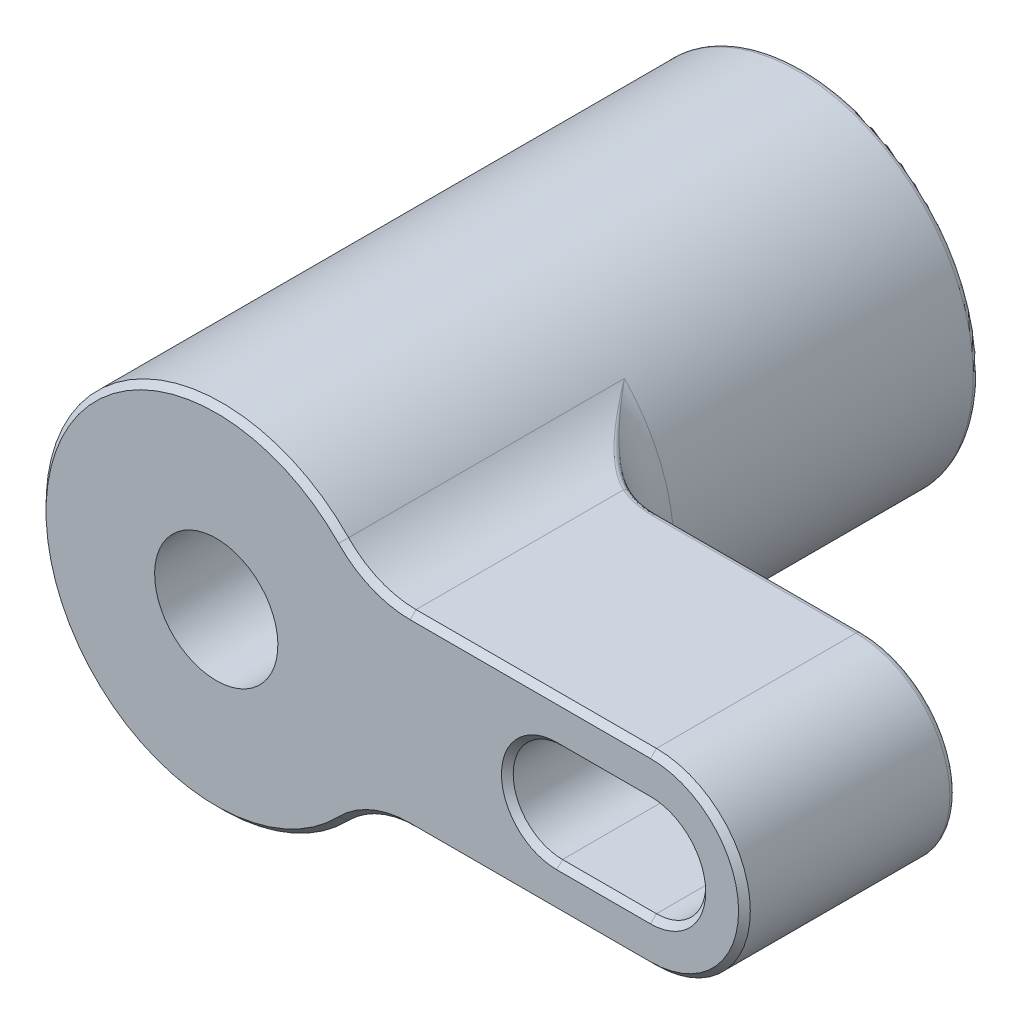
ISO-10303-21;
HEADER;
FILE_DESCRIPTION(('STEP AP214'),'2;1');
FILE_NAME('part.step','',(''),(''),'','','');
FILE_SCHEMA(('AUTOMOTIVE_DESIGN { 1 0 10303 214 1 1 1 1 }'));
ENDSEC;
DATA;
#1=APPLICATION_CONTEXT('core data for automotive mechanical design processes');
#2=APPLICATION_PROTOCOL_DEFINITION('international standard','automotive_design',2000,#1);
#3=PRODUCT_CONTEXT('',#1,'mechanical');
#4=PRODUCT('Part','Part','',(#3));
#5=PRODUCT_RELATED_PRODUCT_CATEGORY('part','',(#4));
#6=PRODUCT_DEFINITION_FORMATION('','',#4);
#7=PRODUCT_DEFINITION_CONTEXT('part definition',#1,'design');
#8=PRODUCT_DEFINITION('design','',#6,#7);
#9=PRODUCT_DEFINITION_SHAPE('','',#8);
#10=(LENGTH_UNIT() NAMED_UNIT(*) SI_UNIT(.MILLI.,.METRE.));
#11=(NAMED_UNIT(*) PLANE_ANGLE_UNIT() SI_UNIT($,.RADIAN.));
#12=(NAMED_UNIT(*) SI_UNIT($,.STERADIAN.) SOLID_ANGLE_UNIT());
#13=UNCERTAINTY_MEASURE_WITH_UNIT(LENGTH_MEASURE(1.E-05),#10,'distance_accuracy_value','');
#14=(GEOMETRIC_REPRESENTATION_CONTEXT(3) GLOBAL_UNCERTAINTY_ASSIGNED_CONTEXT((#13)) GLOBAL_UNIT_ASSIGNED_CONTEXT((#10,
#11,#12)) REPRESENTATION_CONTEXT('',''));
#15=CARTESIAN_POINT('',(0.,0.,0.));
#16=DIRECTION('',(0.,0.,1.));
#17=DIRECTION('',(1.,0.,0.));
#18=AXIS2_PLACEMENT_3D('',#15,#16,#17);
#19=CARTESIAN_POINT('',(0.3,0.,50.));
#20=DIRECTION('',(0.,0.,-1.));
#21=DIRECTION('',(0.,1.,0.));
#22=AXIS2_PLACEMENT_3D('',#19,#20,#21);
#23=CYLINDRICAL_SURFACE('',#22,15.);
#24=DIRECTION('',(0.,0.,-1.));
#25=VECTOR('',#24,1.);
#26=CARTESIAN_POINT('',(-13.4477270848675,6.,50.));
#27=LINE('',#26,#25);
#28=CARTESIAN_POINT('',(-13.4477270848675,6.,42.75));
#29=VERTEX_POINT('',#28);
#30=CARTESIAN_POINT('',(-13.4477270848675,6.,39.25));
#31=VERTEX_POINT('',#30);
#32=EDGE_CURVE('E964',#29,#31,#27,.T.);
#33=ORIENTED_EDGE('',*,*,#32,.T.);
#34=CARTESIAN_POINT('',(-13.8421356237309,5.,38.25));
#35=CARTESIAN_POINT('',(-13.8078070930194,5.09709574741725,38.25));
#36=CARTESIAN_POINT('',(-13.7721272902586,5.19471499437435,38.2643679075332));
#37=CARTESIAN_POINT('',(-13.7371775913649,5.28749896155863,38.2922190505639));
#38=CARTESIAN_POINT('',(-13.6972111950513,5.39360118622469,38.3240679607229));
#39=CARTESIAN_POINT('',(-13.6572676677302,5.49583778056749,38.3743921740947));
#40=CARTESIAN_POINT('',(-13.6208646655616,5.58654875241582,38.4400860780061));
#41=CARTESIAN_POINT('',(-13.5870856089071,5.67072123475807,38.5010447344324));
#42=CARTESIAN_POINT('',(-13.5555786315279,5.74695662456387,38.5767152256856));
#43=CARTESIAN_POINT('',(-13.5293984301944,5.80928042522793,38.6625775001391));
#44=CARTESIAN_POINT('',(-13.5041894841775,5.86929208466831,38.7452543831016));
#45=CARTESIAN_POINT('',(-13.4833613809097,5.91778682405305,38.8394604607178));
#46=CARTESIAN_POINT('',(-13.4693260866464,5.95026546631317,38.9385589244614));
#47=CARTESIAN_POINT('',(-13.4552707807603,5.98279041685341,39.0377986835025));
#48=CARTESIAN_POINT('',(-13.4477270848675,6.,39.1446247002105));
#49=CARTESIAN_POINT('',(-13.4477270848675,6.,39.25));
#50=B_SPLINE_CURVE_WITH_KNOTS('',3,(#34,#35,#36,#37,#38,#39,#40,#41,#42,#43,#44,#45,#46,#47,#48,
#49),.UNSPECIFIED.,.F.,.F.,(4,3,3,3,3,4),(0.,0.190044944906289,0.408054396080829,
0.61016030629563,0.804833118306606,1.),.UNSPECIFIED.);
#51=CARTESIAN_POINT('',(-13.8421356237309,5.,38.25));
#52=VERTEX_POINT('',#51);
#53=EDGE_CURVE('E947',#31,#52,#50,.F.);
#54=ORIENTED_EDGE('',*,*,#53,.T.);
#55=CARTESIAN_POINT('',(0.3,0.,38.25));
#56=DIRECTION('',(0.,0.,1.));
#57=DIRECTION('',(0.,1.,0.));
#58=AXIS2_PLACEMENT_3D('',#55,#56,#57);
#59=CIRCLE('',#58,15.);
#60=CARTESIAN_POINT('',(-13.8421356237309,-5.,38.25));
#61=VERTEX_POINT('',#60);
#62=EDGE_CURVE('E622',#52,#61,#59,.T.);
#63=ORIENTED_EDGE('',*,*,#62,.T.);
#64=CARTESIAN_POINT('',(-13.4477270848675,-6.,39.25));
#65=CARTESIAN_POINT('',(-13.4477270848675,-6.,39.2007896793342));
#66=CARTESIAN_POINT('',(-13.4493259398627,-5.99634041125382,39.15142243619));
#67=CARTESIAN_POINT('',(-13.452473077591,-5.98911381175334,39.1028474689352));
#68=CARTESIAN_POINT('',(-13.4598396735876,-5.9721983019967,38.9891466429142));
#69=CARTESIAN_POINT('',(-13.4761210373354,-5.9347998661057,38.877305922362));
#70=CARTESIAN_POINT('',(-13.4988501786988,-5.88147377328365,38.7777670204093));
#71=CARTESIAN_POINT('',(-13.523257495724,-5.8242104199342,38.6708787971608));
#72=CARTESIAN_POINT('',(-13.5558000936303,-5.74682987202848,38.574552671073));
#73=CARTESIAN_POINT('',(-13.5920761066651,-5.65775763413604,38.4967703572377));
#74=CARTESIAN_POINT('',(-13.6290636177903,-5.56693838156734,38.4174624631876));
#75=CARTESIAN_POINT('',(-13.6710156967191,-5.4612177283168,38.3548014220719));
#76=CARTESIAN_POINT('',(-13.7134853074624,-5.34997472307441,38.3132408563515));
#77=CARTESIAN_POINT('',(-13.7559369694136,-5.23877873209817,38.2716978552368));
#78=CARTESIAN_POINT('',(-13.800113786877,-5.11885570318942,38.25));
#79=CARTESIAN_POINT('',(-13.8421356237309,-5.,38.25));
#80=B_SPLINE_CURVE_WITH_KNOTS('',3,(#64,#65,#66,#67,#68,#69,#70,#71,#72,#73,#74,#75,#76,#77,#78,
#79),.UNSPECIFIED.,.F.,.F.,(4,3,3,3,3,4),(0.,0.089943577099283,0.303448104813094,
0.532847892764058,0.766527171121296,1.),.UNSPECIFIED.);
#81=CARTESIAN_POINT('',(-13.4477270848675,-6.,39.25));
#82=VERTEX_POINT('',#81);
#83=EDGE_CURVE('E920',#61,#82,#80,.F.);
#84=ORIENTED_EDGE('',*,*,#83,.T.);
#85=DIRECTION('',(0.,0.,-1.));
#86=VECTOR('',#85,1.);
#87=CARTESIAN_POINT('',(-13.4477270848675,-6.,50.));
#88=LINE('',#87,#86);
#89=CARTESIAN_POINT('',(-13.4477270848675,-6.,42.75));
#90=VERTEX_POINT('',#89);
#91=EDGE_CURVE('E906',#90,#82,#88,.T.);
#92=ORIENTED_EDGE('',*,*,#91,.F.);
#93=CARTESIAN_POINT('',(-13.8421356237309,-5.,43.75));
#94=CARTESIAN_POINT('',(-13.8078070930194,-5.09709574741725,43.75));
#95=CARTESIAN_POINT('',(-13.7721272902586,-5.19471499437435,43.7356320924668));
#96=CARTESIAN_POINT('',(-13.7371775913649,-5.28749896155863,43.7077809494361));
#97=CARTESIAN_POINT('',(-13.6972111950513,-5.39360118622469,43.6759320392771));
#98=CARTESIAN_POINT('',(-13.6572676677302,-5.49583778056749,43.6256078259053));
#99=CARTESIAN_POINT('',(-13.6208646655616,-5.58654875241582,43.5599139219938));
#100=CARTESIAN_POINT('',(-13.5870856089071,-5.67072123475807,43.4989552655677));
#101=CARTESIAN_POINT('',(-13.5555786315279,-5.74695662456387,43.4232847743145));
#102=CARTESIAN_POINT('',(-13.5293984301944,-5.80928042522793,43.3374224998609));
#103=CARTESIAN_POINT('',(-13.5041894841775,-5.86929208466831,43.2547456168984));
#104=CARTESIAN_POINT('',(-13.4833613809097,-5.91778682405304,43.1605395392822));
#105=CARTESIAN_POINT('',(-13.4693260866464,-5.95026546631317,43.0614410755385));
#106=CARTESIAN_POINT('',(-13.4552707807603,-5.98279041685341,42.9622013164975));
#107=CARTESIAN_POINT('',(-13.4477270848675,-6.,42.8553752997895));
#108=CARTESIAN_POINT('',(-13.4477270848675,-6.,42.75));
#109=B_SPLINE_CURVE_WITH_KNOTS('',3,(#93,#94,#95,#96,#97,#98,#99,#100,#101,#102,#103,#104,#105,
#106,#107,#108),.UNSPECIFIED.,.F.,.F.,(4,3,3,3,3,4),(0.,0.190044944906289,0.408054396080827,
0.610160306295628,0.804833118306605,1.),.UNSPECIFIED.);
#110=CARTESIAN_POINT('',(-13.8421356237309,-5.,43.75));
#111=VERTEX_POINT('',#110);
#112=EDGE_CURVE('E700',#90,#111,#109,.F.);
#113=ORIENTED_EDGE('',*,*,#112,.T.);
#114=CARTESIAN_POINT('',(0.3,0.,43.75));
#115=DIRECTION('',(0.,0.,-1.));
#116=DIRECTION('',(0.,-1.,0.));
#117=AXIS2_PLACEMENT_3D('',#114,#115,#116);
#118=CIRCLE('',#117,15.);
#119=CARTESIAN_POINT('',(-13.8421356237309,5.,43.75));
#120=VERTEX_POINT('',#119);
#121=EDGE_CURVE('E684',#111,#120,#118,.T.);
#122=ORIENTED_EDGE('',*,*,#121,.T.);
#123=CARTESIAN_POINT('',(-13.4477270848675,6.,42.75));
#124=CARTESIAN_POINT('',(-13.4477270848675,6.,42.7992103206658));
#125=CARTESIAN_POINT('',(-13.4493259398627,5.99634041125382,42.84857756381));
#126=CARTESIAN_POINT('',(-13.452473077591,5.98911381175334,42.8971525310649));
#127=CARTESIAN_POINT('',(-13.4598396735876,5.9721983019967,43.0108533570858));
#128=CARTESIAN_POINT('',(-13.4761210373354,5.9347998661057,43.1226940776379));
#129=CARTESIAN_POINT('',(-13.4988501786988,5.88147377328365,43.2222329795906));
#130=CARTESIAN_POINT('',(-13.523257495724,5.8242104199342,43.3291212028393));
#131=CARTESIAN_POINT('',(-13.5558000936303,5.74682987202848,43.425447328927));
#132=CARTESIAN_POINT('',(-13.5920761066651,5.65775763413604,43.5032296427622));
#133=CARTESIAN_POINT('',(-13.6290636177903,5.56693838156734,43.5825375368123));
#134=CARTESIAN_POINT('',(-13.6710156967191,5.4612177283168,43.6451985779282));
#135=CARTESIAN_POINT('',(-13.7134853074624,5.34997472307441,43.6867591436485));
#136=CARTESIAN_POINT('',(-13.7559369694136,5.23877873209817,43.7283021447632));
#137=CARTESIAN_POINT('',(-13.800113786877,5.11885570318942,43.75));
#138=CARTESIAN_POINT('',(-13.8421356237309,5.,43.75));
#139=B_SPLINE_CURVE_WITH_KNOTS('',3,(#123,#124,#125,#126,#127,#128,#129,#130,#131,#132,#133,
#134,#135,#136,#137,#138),.UNSPECIFIED.,.F.,.F.,(4,3,3,3,3,4),(0.,0.089943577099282,
0.303448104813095,0.532847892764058,0.766527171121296,1.),.UNSPECIFIED.);
#140=EDGE_CURVE('E790',#120,#29,#139,.F.);
#141=ORIENTED_EDGE('',*,*,#140,.T.);
#142=EDGE_LOOP('',(#33,#54,#63,#84,#92,#113,#122,#141));
#143=FACE_BOUND('',#142,.T.);
#144=CARTESIAN_POINT('',(0.3,0.,42.25));
#145=DIRECTION('',(0.,0.,-1.));
#146=DIRECTION('',(0.,-1.,0.));
#147=AXIS2_PLACEMENT_3D('',#144,#145,#146);
#148=CIRCLE('',#147,15.);
#149=CARTESIAN_POINT('',(-13.8421356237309,-5.,42.25));
#150=VERTEX_POINT('',#149);
#151=CARTESIAN_POINT('',(-14.6596122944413,1.1,42.25));
#152=VERTEX_POINT('',#151);
#153=EDGE_CURVE('E829',#150,#152,#148,.T.);
#154=ORIENTED_EDGE('',*,*,#153,.F.);
#155=DIRECTION('',(0.,0.,-1.));
#156=VECTOR('',#155,1.);
#157=CARTESIAN_POINT('',(-13.8421356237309,-5.,50.));
#158=LINE('',#157,#156);
#159=CARTESIAN_POINT('',(-13.8421356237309,-5.,39.75));
#160=VERTEX_POINT('',#159);
#161=EDGE_CURVE('E1040',#150,#160,#158,.T.);
#162=ORIENTED_EDGE('',*,*,#161,.T.);
#163=CARTESIAN_POINT('',(0.3,0.,39.75));
#164=DIRECTION('',(0.,0.,1.));
#165=DIRECTION('',(0.,1.,0.));
#166=AXIS2_PLACEMENT_3D('',#163,#164,#165);
#167=CIRCLE('',#166,15.);
#168=CARTESIAN_POINT('',(-14.6596122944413,1.1,39.75));
#169=VERTEX_POINT('',#168);
#170=EDGE_CURVE('E1033',#169,#160,#167,.T.);
#171=ORIENTED_EDGE('',*,*,#170,.F.);
#172=DIRECTION('',(0.,0.,-1.));
#173=VECTOR('',#172,1.);
#174=CARTESIAN_POINT('',(-14.6596122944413,1.1,50.));
#175=LINE('',#174,#173);
#176=CARTESIAN_POINT('',(-14.6596122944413,1.1,38.75));
#177=VERTEX_POINT('',#176);
#178=EDGE_CURVE('E843',#169,#177,#175,.T.);
#179=ORIENTED_EDGE('',*,*,#178,.T.);
#180=CARTESIAN_POINT('',(-13.8431555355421,4.99711431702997,41.));
#181=CARTESIAN_POINT('',(-14.1762655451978,4.05413520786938,40.4555707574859));
#182=CARTESIAN_POINT('',(-14.3812686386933,3.0757683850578,39.8907104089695));
#183=CARTESIAN_POINT('',(-14.5861745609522,2.09786530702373,39.3261178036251));
#184=CARTESIAN_POINT('',(-14.6596122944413,1.1,38.75));
#185=B_SPLINE_CURVE_WITH_KNOTS('',2,(#180,#181,#182,#183,#184),.UNSPECIFIED.,.F.,.F.,(3,2,3),
(0.,0.5,1.),.UNSPECIFIED.);
#186=CARTESIAN_POINT('',(-13.8431555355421,4.99711431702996,41.));
#187=VERTEX_POINT('',#186);
#188=EDGE_CURVE('E762',#187,#177,#185,.T.);
#189=ORIENTED_EDGE('',*,*,#188,.F.);
#190=CARTESIAN_POINT('',(-14.6596122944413,1.09999999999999,43.25));
#191=CARTESIAN_POINT('',(-14.5862096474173,2.09738855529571,42.6741574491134));
#192=CARTESIAN_POINT('',(-14.3812686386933,3.07576838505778,42.1092895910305));
#193=CARTESIAN_POINT('',(-14.176424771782,4.05368446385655,41.5446894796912));
#194=CARTESIAN_POINT('',(-13.8431555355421,4.99711431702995,41.));
#195=B_SPLINE_CURVE_WITH_KNOTS('',2,(#190,#191,#192,#193,#194),.UNSPECIFIED.,.F.,.F.,(3,2,3),
(0.,0.5,1.),.UNSPECIFIED.);
#196=CARTESIAN_POINT('',(-14.6596122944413,1.1,43.25));
#197=VERTEX_POINT('',#196);
#198=EDGE_CURVE('E753',#197,#187,#195,.T.);
#199=ORIENTED_EDGE('',*,*,#198,.F.);
#200=DIRECTION('',(0.,0.,-1.));
#201=VECTOR('',#200,1.);
#202=CARTESIAN_POINT('',(-14.6596122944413,1.1,50.));
#203=LINE('',#202,#201);
#204=EDGE_CURVE('E757',#197,#152,#203,.T.);
#205=ORIENTED_EDGE('',*,*,#204,.T.);
#206=EDGE_LOOP('',(#154,#162,#171,#179,#189,#199,#205));
#207=FACE_BOUND('',#206,.T.);
#208=ADVANCED_FACE('F14',(#143,#207),#23,.T.);
#209=CARTESIAN_POINT('',(0.,0.,50.));
#210=DIRECTION('',(0.,0.,1.));
#211=DIRECTION('',(0.,-1.,0.));
#212=AXIS2_PLACEMENT_3D('',#209,#210,#211);
#213=PLANE('',#212);
#214=CARTESIAN_POINT('',(29.,0.,50.));
#215=DIRECTION('',(0.,0.,-1.));
#216=DIRECTION('',(0.,-1.,0.));
#217=AXIS2_PLACEMENT_3D('',#214,#215,#216);
#218=CIRCLE('',#217,4.7);
#219=CARTESIAN_POINT('',(29.,4.7,50.));
#220=VERTEX_POINT('',#219);
#221=CARTESIAN_POINT('',(29.,-4.7,50.));
#222=VERTEX_POINT('',#221);
#223=EDGE_CURVE('E577',#220,#222,#218,.F.);
#224=ORIENTED_EDGE('',*,*,#223,.F.);
#225=DIRECTION('',(-1.,0.,0.));
#226=VECTOR('',#225,1.);
#227=CARTESIAN_POINT('',(29.,4.7,50.));
#228=LINE('',#227,#226);
#229=CARTESIAN_POINT('',(37.,4.7,50.));
#230=VERTEX_POINT('',#229);
#231=EDGE_CURVE('E214',#230,#220,#228,.T.);
#232=ORIENTED_EDGE('',*,*,#231,.F.);
#233=CARTESIAN_POINT('',(37.,0.,50.));
#234=DIRECTION('',(0.,0.,-1.));
#235=DIRECTION('',(0.,-1.,0.));
#236=AXIS2_PLACEMENT_3D('',#233,#234,#235);
#237=CIRCLE('',#236,4.7);
#238=CARTESIAN_POINT('',(37.,-4.7,50.));
#239=VERTEX_POINT('',#238);
#240=EDGE_CURVE('E574',#239,#230,#237,.F.);
#241=ORIENTED_EDGE('',*,*,#240,.F.);
#242=DIRECTION('',(1.,0.,0.));
#243=VECTOR('',#242,1.);
#244=CARTESIAN_POINT('',(37.,-4.7,50.));
#245=LINE('',#244,#243);
#246=EDGE_CURVE('E242',#222,#239,#245,.T.);
#247=ORIENTED_EDGE('',*,*,#246,.F.);
#248=EDGE_LOOP('',(#224,#232,#241,#247));
#249=FACE_BOUND('',#248,.T.);
#250=CARTESIAN_POINT('',(16.5227116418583,-16.,50.));
#251=DIRECTION('',(0.,0.,-1.));
#252=DIRECTION('',(0.,-1.,0.));
#253=AXIS2_PLACEMENT_3D('',#250,#251,#252);
#254=CIRCLE('',#253,8.5);
#255=CARTESIAN_POINT('',(16.5227116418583,-7.5,50.));
#256=VERTEX_POINT('',#255);
#257=CARTESIAN_POINT('',(10.4164921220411,-10.0869565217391,50.));
#258=VERTEX_POINT('',#257);
#259=EDGE_CURVE('E531',#256,#258,#254,.F.);
#260=ORIENTED_EDGE('',*,*,#259,.F.);
#261=DIRECTION('',(-1.,0.,0.));
#262=VECTOR('',#261,1.);
#263=CARTESIAN_POINT('',(16.5227116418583,-7.5,50.));
#264=LINE('',#263,#262);
#265=CARTESIAN_POINT('',(37.,-7.5,50.));
#266=VERTEX_POINT('',#265);
#267=EDGE_CURVE('E528',#266,#256,#264,.T.);
#268=ORIENTED_EDGE('',*,*,#267,.F.);
#269=CARTESIAN_POINT('',(37.,0.,50.));
#270=DIRECTION('',(0.,0.,-1.));
#271=DIRECTION('',(0.,-1.,0.));
#272=AXIS2_PLACEMENT_3D('',#269,#270,#271);
#273=CIRCLE('',#272,7.5);
#274=CARTESIAN_POINT('',(37.,7.5,50.));
#275=VERTEX_POINT('',#274);
#276=EDGE_CURVE('E535',#275,#266,#273,.T.);
#277=ORIENTED_EDGE('',*,*,#276,.F.);
#278=DIRECTION('',(1.,0.,0.));
#279=VECTOR('',#278,1.);
#280=CARTESIAN_POINT('',(37.,7.5,50.));
#281=LINE('',#280,#279);
#282=CARTESIAN_POINT('',(16.5227116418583,7.5,50.));
#283=VERTEX_POINT('',#282);
#284=EDGE_CURVE('E538',#283,#275,#281,.T.);
#285=ORIENTED_EDGE('',*,*,#284,.F.);
#286=CARTESIAN_POINT('',(16.5227116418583,16.,50.));
#287=DIRECTION('',(0.,0.,-1.));
#288=DIRECTION('',(0.,-1.,0.));
#289=AXIS2_PLACEMENT_3D('',#286,#287,#288);
#290=CIRCLE('',#289,8.5);
#291=CARTESIAN_POINT('',(10.4164921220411,10.0869565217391,50.));
#292=VERTEX_POINT('',#291);
#293=EDGE_CURVE('E541',#292,#283,#290,.F.);
#294=ORIENTED_EDGE('',*,*,#293,.F.);
#295=CARTESIAN_POINT('',(0.,0.,50.));
#296=DIRECTION('',(0.,0.,-1.));
#297=DIRECTION('',(0.,-1.,0.));
#298=AXIS2_PLACEMENT_3D('',#295,#296,#297);
#299=CIRCLE('',#298,14.5);
#300=EDGE_CURVE('E544',#258,#292,#299,.T.);
#301=ORIENTED_EDGE('',*,*,#300,.F.);
#302=EDGE_LOOP('',(#260,#268,#277,#285,#294,#301));
#303=FACE_BOUND('',#302,.T.);
#304=CARTESIAN_POINT('',(0.,0.,50.));
#305=DIRECTION('',(0.,0.,-1.));
#306=DIRECTION('',(0.,-1.,0.));
#307=AXIS2_PLACEMENT_3D('',#304,#305,#306);
#308=CIRCLE('',#307,5.25);
#309=CARTESIAN_POINT('',(0.,-5.25,50.));
#310=VERTEX_POINT('',#309);
#311=EDGE_CURVE('E255',#310,#310,#308,.T.);
#312=ORIENTED_EDGE('',*,*,#311,.T.);
#313=EDGE_LOOP('',(#312));
#314=FACE_BOUND('',#313,.T.);
#315=ADVANCED_FACE('F716',(#249,#303,#314),#213,.T.);
#316=CARTESIAN_POINT('',(0.,0.,0.));
#317=DIRECTION('',(0.,0.,1.));
#318=DIRECTION('',(0.,-1.,0.));
#319=AXIS2_PLACEMENT_3D('',#316,#317,#318);
#320=PLANE('',#319);
#321=CARTESIAN_POINT('',(0.,0.,0.));
#322=DIRECTION('',(0.,0.,-1.));
#323=DIRECTION('',(0.,-1.,0.));
#324=AXIS2_PLACEMENT_3D('',#321,#322,#323);
#325=CIRCLE('',#324,11.5);
#326=CARTESIAN_POINT('',(0.,-11.5,0.));
#327=VERTEX_POINT('',#326);
#328=EDGE_CURVE('E25',#327,#327,#325,.T.);
#329=ORIENTED_EDGE('',*,*,#328,.F.);
#330=EDGE_LOOP('',(#329));
#331=FACE_BOUND('',#330,.T.);
#332=CARTESIAN_POINT('',(0.,0.,0.));
#333=DIRECTION('',(0.,0.,-1.));
#334=DIRECTION('',(0.,-1.,0.));
#335=AXIS2_PLACEMENT_3D('',#332,#333,#334);
#336=CIRCLE('',#335,14.5);
#337=CARTESIAN_POINT('',(0.,-14.5,0.));
#338=VERTEX_POINT('',#337);
#339=EDGE_CURVE('E286',#338,#338,#336,.F.);
#340=ORIENTED_EDGE('',*,*,#339,.F.);
#341=EDGE_LOOP('',(#340));
#342=FACE_BOUND('',#341,.T.);
#343=ADVANCED_FACE('F607',(#331,#342),#320,.F.);
#344=CARTESIAN_POINT('',(0.,0.,50.));
#345=DIRECTION('',(0.,0.,-1.));
#346=DIRECTION('',(0.,1.,0.));
#347=AXIS2_PLACEMENT_3D('',#344,#345,#346);
#348=CYLINDRICAL_SURFACE('',#347,15.);
#349=CARTESIAN_POINT('',(-13.7477270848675,6.,39.25));
#350=CARTESIAN_POINT('',(-13.7477270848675,6.,39.1446247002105));
#351=CARTESIAN_POINT('',(-13.7552707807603,5.98279041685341,39.0377986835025));
#352=CARTESIAN_POINT('',(-13.7693260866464,5.95026546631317,38.9385589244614));
#353=CARTESIAN_POINT('',(-13.7833613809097,5.91778682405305,38.8394604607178));
#354=CARTESIAN_POINT('',(-13.8041894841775,5.86929208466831,38.7452543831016));
#355=CARTESIAN_POINT('',(-13.8293984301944,5.80928042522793,38.6625775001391));
#356=CARTESIAN_POINT('',(-13.8555786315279,5.74695662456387,38.5767152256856));
#357=CARTESIAN_POINT('',(-13.8870856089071,5.67072123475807,38.5010447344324));
#358=CARTESIAN_POINT('',(-13.9208646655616,5.58654875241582,38.4400860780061));
#359=CARTESIAN_POINT('',(-13.9572676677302,5.49583778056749,38.3743921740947));
#360=CARTESIAN_POINT('',(-13.9972111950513,5.39360118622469,38.3240679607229));
#361=CARTESIAN_POINT('',(-14.0371775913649,5.28749896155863,38.2922190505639));
#362=CARTESIAN_POINT('',(-14.0721272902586,5.19471499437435,38.2643679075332));
#363=CARTESIAN_POINT('',(-14.1078070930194,5.09709574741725,38.25));
#364=CARTESIAN_POINT('',(-14.1421356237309,5.,38.25));
#365=B_SPLINE_CURVE_WITH_KNOTS('',3,(#349,#350,#351,#352,#353,#354,#355,#356,#357,#358,#359,
#360,#361,#362,#363,#364),.UNSPECIFIED.,.F.,.F.,(4,3,3,3,3,4),(0.,0.195166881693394,
0.389839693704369,0.591945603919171,0.809955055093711,1.),.UNSPECIFIED.);
#366=CARTESIAN_POINT('',(-13.7477270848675,6.,39.25));
#367=VERTEX_POINT('',#366);
#368=CARTESIAN_POINT('',(-14.1421356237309,5.,38.25));
#369=VERTEX_POINT('',#368);
#370=EDGE_CURVE('E984',#367,#369,#365,.T.);
#371=ORIENTED_EDGE('',*,*,#370,.F.);
#372=DIRECTION('',(0.,0.,-1.));
#373=VECTOR('',#372,1.);
#374=CARTESIAN_POINT('',(-13.7477270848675,6.,50.));
#375=LINE('',#374,#373);
#376=CARTESIAN_POINT('',(-13.7477270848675,6.,42.75));
#377=VERTEX_POINT('',#376);
#378=EDGE_CURVE('E584',#377,#367,#375,.T.);
#379=ORIENTED_EDGE('',*,*,#378,.F.);
#380=CARTESIAN_POINT('',(-14.1421356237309,5.,43.75));
#381=CARTESIAN_POINT('',(-14.1315972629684,5.02980978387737,43.7499930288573));
#382=CARTESIAN_POINT('',(-14.1209649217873,5.05957995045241,43.7486349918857));
#383=CARTESIAN_POINT('',(-14.0995870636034,5.11885046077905,43.7432814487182));
#384=CARTESIAN_POINT('',(-14.0888415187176,5.14835073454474,43.7392852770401));
#385=CARTESIAN_POINT('',(-14.0673124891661,5.20688907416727,43.7287177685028));
#386=CARTESIAN_POINT('',(-14.0565289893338,5.23592692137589,43.722145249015));
#387=CARTESIAN_POINT('',(-14.03501901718,5.293314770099,43.7064470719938));
#388=CARTESIAN_POINT('',(-14.0242925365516,5.32166487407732,43.6973217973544));
#389=CARTESIAN_POINT('',(-13.9923323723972,5.40538547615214,43.6660851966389));
#390=CARTESIAN_POINT('',(-13.9713114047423,5.45944405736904,43.6401099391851));
#391=CARTESIAN_POINT('',(-13.9305978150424,5.56250957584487,43.5788417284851));
#392=CARTESIAN_POINT('',(-13.910904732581,5.61151826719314,43.5435520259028));
#393=CARTESIAN_POINT('',(-13.8740984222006,5.70190738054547,43.4647300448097));
#394=CARTESIAN_POINT('',(-13.856946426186,5.74340519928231,43.421351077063));
#395=CARTESIAN_POINT('',(-13.8255485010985,5.81857882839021,43.3273232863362));
#396=CARTESIAN_POINT('',(-13.8113021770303,5.85225570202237,43.2766754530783));
#397=CARTESIAN_POINT('',(-13.7875674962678,5.90794816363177,43.172903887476));
#398=CARTESIAN_POINT('',(-13.7778224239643,5.93059860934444,43.1201795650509));
#399=CARTESIAN_POINT('',(-13.7621680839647,5.96683484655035,43.01121771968));
#400=CARTESIAN_POINT('',(-13.7562516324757,5.98043761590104,42.9549869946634));
#401=CARTESIAN_POINT('',(-13.7509248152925,5.99266887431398,42.8734610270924));
#402=CARTESIAN_POINT('',(-13.7497285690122,5.99541241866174,42.8488468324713));
#403=CARTESIAN_POINT('',(-13.7481335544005,5.99906875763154,42.7994910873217));
#404=CARTESIAN_POINT('',(-13.7477336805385,5.99998409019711,42.7747497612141));
#405=CARTESIAN_POINT('',(-13.7477270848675,6.,42.75));
#406=B_SPLINE_CURVE_WITH_KNOTS('',3,(#380,#381,#382,#383,#384,#385,#386,#387,#388,#389,#390,
#391,#392,#393,#394,#395,#396,#397,#398,#399,#400,#401,#402,#403,#404,#405),.UNSPECIFIED.,.F.,
.F.,(4,2,2,2,2,2,2,2,2,2,2,2,4),(0.,0.0948154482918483,0.189654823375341,0.284537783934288,
0.379406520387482,0.569087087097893,0.758701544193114,0.945032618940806,1.13133834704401,
1.30503800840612,1.47841079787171,1.55272687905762,1.6269397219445),.UNSPECIFIED.);
#407=CARTESIAN_POINT('',(-14.1421356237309,5.,43.75));
#408=VERTEX_POINT('',#407);
#409=EDGE_CURVE('E624',#408,#377,#406,.T.);
#410=ORIENTED_EDGE('',*,*,#409,.F.);
#411=CARTESIAN_POINT('',(0.,0.,43.75));
#412=DIRECTION('',(0.,0.,-1.));
#413=DIRECTION('',(0.,-1.,0.));
#414=AXIS2_PLACEMENT_3D('',#411,#412,#413);
#415=CIRCLE('',#414,15.);
#416=CARTESIAN_POINT('',(-14.1421356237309,-5.,43.75));
#417=VERTEX_POINT('',#416);
#418=EDGE_CURVE('E904',#417,#408,#415,.T.);
#419=ORIENTED_EDGE('',*,*,#418,.F.);
#420=CARTESIAN_POINT('',(-13.7477270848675,-6.,42.75));
#421=CARTESIAN_POINT('',(-13.7477270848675,-6.,42.8553752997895));
#422=CARTESIAN_POINT('',(-13.7552707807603,-5.98279041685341,42.9622013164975));
#423=CARTESIAN_POINT('',(-13.7693260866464,-5.95026546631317,43.0614410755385));
#424=CARTESIAN_POINT('',(-13.7833613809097,-5.91778682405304,43.1605395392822));
#425=CARTESIAN_POINT('',(-13.8041894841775,-5.86929208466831,43.2547456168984));
#426=CARTESIAN_POINT('',(-13.8293984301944,-5.80928042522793,43.3374224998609));
#427=CARTESIAN_POINT('',(-13.8555786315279,-5.74695662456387,43.4232847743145));
#428=CARTESIAN_POINT('',(-13.8870856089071,-5.67072123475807,43.4989552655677));
#429=CARTESIAN_POINT('',(-13.9208646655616,-5.58654875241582,43.5599139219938));
#430=CARTESIAN_POINT('',(-13.9572676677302,-5.49583778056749,43.6256078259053));
#431=CARTESIAN_POINT('',(-13.9972111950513,-5.39360118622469,43.6759320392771));
#432=CARTESIAN_POINT('',(-14.0371775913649,-5.28749896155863,43.7077809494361));
#433=CARTESIAN_POINT('',(-14.0721272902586,-5.19471499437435,43.7356320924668));
#434=CARTESIAN_POINT('',(-14.1078070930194,-5.09709574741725,43.75));
#435=CARTESIAN_POINT('',(-14.1421356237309,-5.,43.75));
#436=B_SPLINE_CURVE_WITH_KNOTS('',3,(#420,#421,#422,#423,#424,#425,#426,#427,#428,#429,#430,
#431,#432,#433,#434,#435),.UNSPECIFIED.,.F.,.F.,(4,3,3,3,3,4),(0.,0.195166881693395,
0.389839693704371,0.591945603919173,0.809955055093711,1.),.UNSPECIFIED.);
#437=CARTESIAN_POINT('',(-13.7477270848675,-6.,42.75));
#438=VERTEX_POINT('',#437);
#439=EDGE_CURVE('E594',#438,#417,#436,.T.);
#440=ORIENTED_EDGE('',*,*,#439,.F.);
#441=DIRECTION('',(0.,0.,-1.));
#442=VECTOR('',#441,1.);
#443=CARTESIAN_POINT('',(-13.7477270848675,-6.,50.));
#444=LINE('',#443,#442);
#445=CARTESIAN_POINT('',(-13.7477270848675,-6.,39.25));
#446=VERTEX_POINT('',#445);
#447=EDGE_CURVE('E923',#438,#446,#444,.T.);
#448=ORIENTED_EDGE('',*,*,#447,.T.);
#449=CARTESIAN_POINT('',(-14.1421356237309,-5.,38.25));
#450=CARTESIAN_POINT('',(-14.1315972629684,-5.02980978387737,38.2500069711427));
#451=CARTESIAN_POINT('',(-14.1209649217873,-5.05957995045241,38.2513650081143));
#452=CARTESIAN_POINT('',(-14.0995870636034,-5.11885046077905,38.2567185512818));
#453=CARTESIAN_POINT('',(-14.0888415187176,-5.14835073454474,38.2607147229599));
#454=CARTESIAN_POINT('',(-14.0673124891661,-5.20688907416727,38.2712822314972));
#455=CARTESIAN_POINT('',(-14.0565289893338,-5.23592692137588,38.277854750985));
#456=CARTESIAN_POINT('',(-14.03501901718,-5.293314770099,38.2935529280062));
#457=CARTESIAN_POINT('',(-14.0242925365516,-5.32166487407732,38.3026782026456));
#458=CARTESIAN_POINT('',(-13.9923323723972,-5.40538547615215,38.3339148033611));
#459=CARTESIAN_POINT('',(-13.9713114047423,-5.45944405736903,38.3598900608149));
#460=CARTESIAN_POINT('',(-13.9305978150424,-5.56250957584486,38.4211582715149));
#461=CARTESIAN_POINT('',(-13.910904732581,-5.61151826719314,38.4564479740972));
#462=CARTESIAN_POINT('',(-13.8740984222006,-5.70190738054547,38.5352699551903));
#463=CARTESIAN_POINT('',(-13.856946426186,-5.7434051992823,38.578648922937));
#464=CARTESIAN_POINT('',(-13.8255485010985,-5.81857882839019,38.6726767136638));
#465=CARTESIAN_POINT('',(-13.8113021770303,-5.85225570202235,38.7233245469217));
#466=CARTESIAN_POINT('',(-13.7875674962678,-5.90794816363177,38.827096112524));
#467=CARTESIAN_POINT('',(-13.7778224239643,-5.93059860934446,38.8798204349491));
#468=CARTESIAN_POINT('',(-13.7621680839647,-5.96683484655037,38.9887822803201));
#469=CARTESIAN_POINT('',(-13.7562516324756,-5.98043761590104,39.0450130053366));
#470=CARTESIAN_POINT('',(-13.7509248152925,-5.99266887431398,39.1265389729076));
#471=CARTESIAN_POINT('',(-13.7497285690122,-5.99541241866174,39.1511531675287));
#472=CARTESIAN_POINT('',(-13.7481335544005,-5.99906875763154,39.2005089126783));
#473=CARTESIAN_POINT('',(-13.7477336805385,-5.99998409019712,39.2252502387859));
#474=CARTESIAN_POINT('',(-13.7477270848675,-6.,39.25));
#475=B_SPLINE_CURVE_WITH_KNOTS('',3,(#449,#450,#451,#452,#453,#454,#455,#456,#457,#458,#459,
#460,#461,#462,#463,#464,#465,#466,#467,#468,#469,#470,#471,#472,#473,#474),.UNSPECIFIED.,.F.,
.F.,(4,2,2,2,2,2,2,2,2,2,2,2,4),(0.,0.094815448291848,0.189654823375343,0.284537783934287,
0.379406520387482,0.569087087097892,0.758701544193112,0.945032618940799,1.13133834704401,
1.30503800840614,1.47841079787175,1.55272687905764,1.6269397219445),.UNSPECIFIED.);
#476=CARTESIAN_POINT('',(-14.1421356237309,-5.,38.25));
#477=VERTEX_POINT('',#476);
#478=EDGE_CURVE('E615',#477,#446,#475,.T.);
#479=ORIENTED_EDGE('',*,*,#478,.F.);
#480=CARTESIAN_POINT('',(0.,0.,38.25));
#481=DIRECTION('',(0.,0.,1.));
#482=DIRECTION('',(0.,1.,0.));
#483=AXIS2_PLACEMENT_3D('',#480,#481,#482);
#484=CIRCLE('',#483,15.);
#485=EDGE_CURVE('E944',#369,#477,#484,.T.);
#486=ORIENTED_EDGE('',*,*,#485,.F.);
#487=EDGE_LOOP('',(#371,#379,#410,#419,#440,#448,#479,#486));
#488=FACE_BOUND('',#487,.T.);
#489=CARTESIAN_POINT('',(0.,0.,0.5));
#490=DIRECTION('',(0.,0.,-1.));
#491=DIRECTION('',(0.,-1.,0.));
#492=AXIS2_PLACEMENT_3D('',#489,#490,#491);
#493=CIRCLE('',#492,15.);
#494=CARTESIAN_POINT('',(0.,-15.,0.5));
#495=VERTEX_POINT('',#494);
#496=EDGE_CURVE('E283',#495,#495,#493,.T.);
#497=ORIENTED_EDGE('',*,*,#496,.F.);
#498=EDGE_LOOP('',(#497));
#499=FACE_BOUND('',#498,.T.);
#500=DIRECTION('',(0.,0.,-1.));
#501=VECTOR('',#500,1.);
#502=CARTESIAN_POINT('',(10.7756815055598,10.4347826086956,50.));
#503=LINE('',#502,#501);
#504=CARTESIAN_POINT('',(10.7756815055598,10.4347826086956,26.));
#505=VERTEX_POINT('',#504);
#506=CARTESIAN_POINT('',(10.7756815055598,10.4347826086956,49.5));
#507=VERTEX_POINT('',#506);
#508=EDGE_CURVE('E277',#505,#507,#503,.F.);
#509=ORIENTED_EDGE('',*,*,#508,.F.);
#510=CARTESIAN_POINT('',(0.,0.,26.));
#511=DIRECTION('',(0.,0.,-1.));
#512=DIRECTION('',(0.,-1.,0.));
#513=AXIS2_PLACEMENT_3D('',#510,#511,#512);
#514=CIRCLE('',#513,15.);
#515=CARTESIAN_POINT('',(10.7756815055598,-10.4347826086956,26.));
#516=VERTEX_POINT('',#515);
#517=EDGE_CURVE('E292',#516,#505,#514,.F.);
#518=ORIENTED_EDGE('',*,*,#517,.F.);
#519=DIRECTION('',(0.,0.,-1.));
#520=VECTOR('',#519,1.);
#521=CARTESIAN_POINT('',(10.7756815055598,-10.4347826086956,50.));
#522=LINE('',#521,#520);
#523=CARTESIAN_POINT('',(10.7756815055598,-10.4347826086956,49.5));
#524=VERTEX_POINT('',#523);
#525=EDGE_CURVE('E274',#524,#516,#522,.T.);
#526=ORIENTED_EDGE('',*,*,#525,.F.);
#527=CARTESIAN_POINT('',(0.,0.,49.5));
#528=DIRECTION('',(0.,0.,-1.));
#529=DIRECTION('',(0.,-1.,0.));
#530=AXIS2_PLACEMENT_3D('',#527,#528,#529);
#531=CIRCLE('',#530,15.);
#532=EDGE_CURVE('E508',#507,#524,#531,.F.);
#533=ORIENTED_EDGE('',*,*,#532,.F.);
#534=EDGE_LOOP('',(#509,#518,#526,#533));
#535=FACE_BOUND('',#534,.T.);
#536=ADVANCED_FACE('F507',(#488,#499,#535),#348,.T.);
#537=CARTESIAN_POINT('',(12.6885775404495,8.,50.));
#538=DIRECTION('',(0.,-1.,0.));
#539=DIRECTION('',(-1.,0.,0.));
#540=AXIS2_PLACEMENT_3D('',#537,#538,#539);
#541=PLANE('',#540);
#542=DIRECTION('',(0.,0.,-1.));
#543=VECTOR('',#542,1.);
#544=CARTESIAN_POINT('',(37.,8.,50.));
#545=LINE('',#544,#543);
#546=CARTESIAN_POINT('',(37.,8.,49.5));
#547=VERTEX_POINT('',#546);
#548=CARTESIAN_POINT('',(37.,8.,32.5));
#549=VERTEX_POINT('',#548);
#550=EDGE_CURVE('E268',#547,#549,#545,.T.);
#551=ORIENTED_EDGE('',*,*,#550,.T.);
#552=DIRECTION('',(1.,0.,0.));
#553=VECTOR('',#552,1.);
#554=CARTESIAN_POINT('',(12.6885775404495,8.,32.5));
#555=LINE('',#554,#553);
#556=CARTESIAN_POINT('',(19.6150452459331,8.,32.5));
#557=VERTEX_POINT('',#556);
#558=EDGE_CURVE('E454',#557,#549,#555,.T.);
#559=ORIENTED_EDGE('',*,*,#558,.F.);
#560=CARTESIAN_POINT('',(14.4628672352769,8.,30.4814470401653));
#561=CARTESIAN_POINT('',(14.703976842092,8.,30.2229241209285));
#562=CARTESIAN_POINT('',(14.7843741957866,7.66672366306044,30.136720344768));
#563=CARTESIAN_POINT('',(14.7648854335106,8.,30.7631154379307));
#564=CARTESIAN_POINT('',(15.0010170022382,8.,30.4864277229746));
#565=CARTESIAN_POINT('',(15.0695374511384,7.65445265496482,30.396721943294));
#566=CARTESIAN_POINT('',(15.0908631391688,8.,31.0184490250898));
#567=CARTESIAN_POINT('',(15.317334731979,8.,30.7202922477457));
#568=CARTESIAN_POINT('',(15.3767892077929,7.64179787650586,30.6324144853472));
#569=CARTESIAN_POINT('',(15.7808972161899,8.,31.4726451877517));
#570=CARTESIAN_POINT('',(15.9833809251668,8.,31.1335345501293));
#571=CARTESIAN_POINT('',(16.0261332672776,7.61628369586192,31.0516724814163));
#572=CARTESIAN_POINT('',(16.145016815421,8.,31.6714118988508));
#573=CARTESIAN_POINT('',(16.3341424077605,8.,31.3118633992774));
#574=CARTESIAN_POINT('',(16.3682833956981,7.60342398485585,31.2351494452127));
#575=CARTESIAN_POINT('',(16.9138673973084,8.,32.0136879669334));
#576=CARTESIAN_POINT('',(17.0706802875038,8.,31.6155071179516));
#577=CARTESIAN_POINT('',(17.0896905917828,7.57765702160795,31.5510965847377));
#578=CARTESIAN_POINT('',(17.3195832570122,8.,32.154975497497));
#579=CARTESIAN_POINT('',(17.4574979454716,8.,31.7371912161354));
#580=CARTESIAN_POINT('',(17.4698355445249,7.56476440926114,31.6815158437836));
#581=CARTESIAN_POINT('',(18.1482240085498,8.,32.367601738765));
#582=CARTESIAN_POINT('',(18.2430687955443,8.,31.9153323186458));
#583=CARTESIAN_POINT('',(18.2452804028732,7.53982706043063,31.8777862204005));
#584=CARTESIAN_POINT('',(18.5711017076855,8.,32.4391203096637));
#585=CARTESIAN_POINT('',(18.6418280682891,8.,31.9704052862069));
#586=CARTESIAN_POINT('',(18.640538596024,7.52778021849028,31.9438033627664));
#587=CARTESIAN_POINT('',(19.0992903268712,8.,32.482898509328));
#588=CARTESIAN_POINT('',(19.1331258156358,8.,31.9973655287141));
#589=CARTESIAN_POINT('',(19.1337317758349,7.51350940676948,31.9842140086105));
#590=CARTESIAN_POINT('',(19.2023691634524,8.,32.4893050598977));
#591=CARTESIAN_POINT('',(19.2296704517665,8.,32.0006638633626));
#592=CARTESIAN_POINT('',(19.2299577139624,7.51076079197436,31.990127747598));
#593=CARTESIAN_POINT('',(19.4086435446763,8.,32.4978543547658));
#594=CARTESIAN_POINT('',(19.4226214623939,8.,32.0033109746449));
#595=CARTESIAN_POINT('',(19.4224745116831,7.50533028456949,31.998019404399));
#596=CARTESIAN_POINT('',(19.5118389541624,8.,32.500000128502));
#597=CARTESIAN_POINT('',(19.5190196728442,8.,32.0026412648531));
#598=CARTESIAN_POINT('',(19.5187652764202,7.50264834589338,32.0000001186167));
#599=CARTESIAN_POINT('',(19.8158481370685,8.,32.4999997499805));
#600=CARTESIAN_POINT('',(19.8033420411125,8.,31.9948207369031));
#601=CARTESIAN_POINT('',(19.8023719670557,7.49484725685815,31.999999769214));
#602=CARTESIAN_POINT('',(20.0166922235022,8.,32.4918761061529));
#603=CARTESIAN_POINT('',(19.9901711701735,8.,31.9820618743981));
#604=CARTESIAN_POINT('',(19.9896578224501,7.48982168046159,31.9925010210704));
#605=CARTESIAN_POINT('',(20.4171373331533,8.,32.4592245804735));
#606=CARTESIAN_POINT('',(20.3617646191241,8.,31.9416374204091));
#607=CARTESIAN_POINT('',(20.3629286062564,7.48003902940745,31.9623611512));
#608=CARTESIAN_POINT('',(20.6167376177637,8.,32.43468774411));
#609=CARTESIAN_POINT('',(20.5464282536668,8.,31.9138201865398));
#610=CARTESIAN_POINT('',(20.5489127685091,7.4752821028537,31.93971176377));
#611=CARTESIAN_POINT('',(21.0147474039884,8.,32.3688858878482));
#612=CARTESIAN_POINT('',(20.9137776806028,8.,31.8430931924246));
#613=CARTESIAN_POINT('',(20.9196456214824,7.46601474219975,31.8789715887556));
#614=CARTESIAN_POINT('',(21.2131360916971,8.,32.3274942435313));
#615=CARTESIAN_POINT('',(21.0963038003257,8.,31.7999390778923));
#616=CARTESIAN_POINT('',(21.1043739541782,7.46150647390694,31.8407639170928));
#617=CARTESIAN_POINT('',(21.6056380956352,8.,32.2280749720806));
#618=CARTESIAN_POINT('',(21.4565918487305,8.,31.6987966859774));
#619=CARTESIAN_POINT('',(21.4697386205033,7.45278522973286,31.7489922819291));
#620=CARTESIAN_POINT('',(21.7997525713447,8.,32.1700519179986));
#621=CARTESIAN_POINT('',(21.6342180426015,8.,31.6406953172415));
#622=CARTESIAN_POINT('',(21.6503760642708,7.44857217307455,31.6954325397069));
#623=CARTESIAN_POINT('',(21.9910223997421,8.,32.1037490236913));
#624=CARTESIAN_POINT('',(21.808007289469,8.,31.5756179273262));
#625=CARTESIAN_POINT('',(21.8283182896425,7.44451004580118,31.6342298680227));
#626=(BOUNDED_SURFACE() B_SPLINE_SURFACE(3,2,((#560,#561,#562),(#563,#564,#565),(#566,#567,
#568),(#569,#570,#571),(#572,#573,#574),(#575,#576,#577),(#578,#579,#580),(#581,#582,#583),
(#584,#585,#586),(#587,#588,#589),(#590,#591,#592),(#593,#594,#595),(#596,#597,#598),(#599,#600,
#601),(#602,#603,#604),(#605,#606,#607),(#608,#609,#610),(#611,#612,#613),(#614,#615,#616),
(#617,#618,#619),(#620,#621,#622),(#623,#624,#625)),.UNSPECIFIED.,.F.,.F.,
.F.) B_SPLINE_SURFACE_WITH_KNOTS((4,2,2,2,2,2,2,2,2,2,4),(3,3),(0.,1.23682901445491,
2.47574177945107,3.75880901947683,5.0385597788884,5.34834887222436,5.65791762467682,
6.26022877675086,6.86286879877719,7.47012232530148,8.07720903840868),(0.,1.),
.UNSPECIFIED.) GEOMETRIC_REPRESENTATION_ITEM() RATIONAL_B_SPLINE_SURFACE(((1.,0.816531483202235,
1.),(1.,0.809024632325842,1.),(1.,0.801165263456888,1.),(1.,0.785076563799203,1.),(1.,
0.776846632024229,1.),(1.,0.760086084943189,1.),(1.,0.751555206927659,1.),(1.,0.734776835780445,
1.),(1.,0.726528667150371,1.),(1.,0.716598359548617,1.),(1.,0.714677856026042,1.),(1.,
0.710868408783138,1.),(1.,0.708979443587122,1.),(1.,0.703463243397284,1.),(1.,0.699881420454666,
1.),(1.,0.692857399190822,1.),(1.,0.689415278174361,1.),(1.,0.682661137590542,1.),(1.,
0.679350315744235,1.),(1.,0.672900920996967,1.),(1.,0.669762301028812,1.),(1.,0.6667158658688,1.))) REPRESENTATION_ITEM('') SURFACE());
#627=CARTESIAN_POINT('',(14.4628672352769,8.,30.4814470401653));
#628=CARTESIAN_POINT('',(14.7648854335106,8.,30.7631154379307));
#629=CARTESIAN_POINT('',(15.0908631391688,8.,31.0184490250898));
#630=CARTESIAN_POINT('',(15.7808972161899,8.,31.4726451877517));
#631=CARTESIAN_POINT('',(16.145016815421,8.,31.6714118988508));
#632=CARTESIAN_POINT('',(16.9138673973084,8.,32.0136879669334));
#633=CARTESIAN_POINT('',(17.3195832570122,8.,32.154975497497));
#634=CARTESIAN_POINT('',(18.1482240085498,8.,32.367601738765));
#635=CARTESIAN_POINT('',(18.5711017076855,8.,32.4391203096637));
#636=CARTESIAN_POINT('',(19.0992903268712,8.,32.482898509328));
#637=CARTESIAN_POINT('',(19.2023691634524,8.,32.4893050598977));
#638=CARTESIAN_POINT('',(19.4086435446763,8.,32.4978543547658));
#639=CARTESIAN_POINT('',(19.5118389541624,8.,32.500000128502));
#640=CARTESIAN_POINT('',(19.8158481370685,8.,32.4999997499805));
#641=CARTESIAN_POINT('',(20.0166922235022,8.,32.4918761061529));
#642=CARTESIAN_POINT('',(20.4171373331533,8.,32.4592245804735));
#643=CARTESIAN_POINT('',(20.6167376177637,8.,32.43468774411));
#644=CARTESIAN_POINT('',(21.0147474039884,8.,32.3688858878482));
#645=CARTESIAN_POINT('',(21.2131360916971,8.,32.3274942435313));
#646=CARTESIAN_POINT('',(21.6056380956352,8.,32.2280749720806));
#647=CARTESIAN_POINT('',(21.7997525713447,8.,32.1700519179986));
#648=CARTESIAN_POINT('',(21.9910223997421,8.,32.1037490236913));
#649=B_SPLINE_CURVE_WITH_KNOTS('',3,(#627,#628,#629,#630,#631,#632,#633,#634,#635,#636,#637,
#638,#639,#640,#641,#642,#643,#644,#645,#646,#647,#648),.UNSPECIFIED.,.F.,.F.,(4,2,2,2,2,2,2,2,
2,2,4),(0.,1.23682901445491,2.47574177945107,3.75880901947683,5.0385597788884,5.34834887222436,
5.65791762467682,6.26022877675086,6.86286879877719,7.47012232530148,8.07720903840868),.UNSPECIFIED.);
#650=CARTESIAN_POINT('',(16.5227116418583,8.,31.8395536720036));
#651=VERTEX_POINT('',#650);
#652=EDGE_CURVE('E445',#651,#557,#649,.T.);
#653=ORIENTED_EDGE('',*,*,#652,.F.);
#654=DIRECTION('',(0.,0.,1.));
#655=VECTOR('',#654,1.);
#656=CARTESIAN_POINT('',(16.5227116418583,8.,32.));
#657=LINE('',#656,#655);
#658=CARTESIAN_POINT('',(16.5227116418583,8.,49.5));
#659=VERTEX_POINT('',#658);
#660=EDGE_CURVE('E271',#659,#651,#657,.F.);
#661=ORIENTED_EDGE('',*,*,#660,.F.);
#662=DIRECTION('',(-1.,0.,0.));
#663=VECTOR('',#662,1.);
#664=CARTESIAN_POINT('',(16.5227116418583,8.,49.5));
#665=LINE('',#664,#663);
#666=EDGE_CURVE('E549',#547,#659,#665,.T.);
#667=ORIENTED_EDGE('',*,*,#666,.F.);
#668=EDGE_LOOP('',(#551,#559,#653,#661,#667));
#669=FACE_BOUND('',#668,.T.);
#670=ADVANCED_FACE('F361',(#669),#541,.F.);
#671=CARTESIAN_POINT('',(37.,0.,50.));
#672=DIRECTION('',(0.,0.,-1.));
#673=DIRECTION('',(0.,1.,0.));
#674=AXIS2_PLACEMENT_3D('',#671,#672,#673);
#675=CYLINDRICAL_SURFACE('',#674,8.);
#676=DIRECTION('',(0.,0.,-1.));
#677=VECTOR('',#676,1.);
#678=CARTESIAN_POINT('',(37.,-8.,50.));
#679=LINE('',#678,#677);
#680=CARTESIAN_POINT('',(37.,-8.,49.5));
#681=VERTEX_POINT('',#680);
#682=CARTESIAN_POINT('',(37.,-8.,32.5));
#683=VERTEX_POINT('',#682);
#684=EDGE_CURVE('E265',#681,#683,#679,.T.);
#685=ORIENTED_EDGE('',*,*,#684,.T.);
#686=CARTESIAN_POINT('',(37.,0.,32.5));
#687=DIRECTION('',(0.,0.,-1.));
#688=DIRECTION('',(0.,-1.,0.));
#689=AXIS2_PLACEMENT_3D('',#686,#687,#688);
#690=CIRCLE('',#689,8.);
#691=EDGE_CURVE('E1520',#549,#683,#690,.T.);
#692=ORIENTED_EDGE('',*,*,#691,.F.);
#693=ORIENTED_EDGE('',*,*,#550,.F.);
#694=CARTESIAN_POINT('',(37.,0.,49.5));
#695=DIRECTION('',(0.,0.,-1.));
#696=DIRECTION('',(0.,-1.,0.));
#697=AXIS2_PLACEMENT_3D('',#694,#695,#696);
#698=CIRCLE('',#697,8.);
#699=EDGE_CURVE('E551',#681,#547,#698,.F.);
#700=ORIENTED_EDGE('',*,*,#699,.F.);
#701=EDGE_LOOP('',(#685,#692,#693,#700));
#702=FACE_BOUND('',#701,.T.);
#703=ADVANCED_FACE('F1445',(#702),#675,.T.);
#704=CARTESIAN_POINT('',(12.6885775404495,-8.,50.));
#705=DIRECTION('',(0.,1.,0.));
#706=DIRECTION('',(1.,0.,0.));
#707=AXIS2_PLACEMENT_3D('',#704,#705,#706);
#708=PLANE('',#707);
#709=DIRECTION('',(0.,0.,1.));
#710=VECTOR('',#709,1.);
#711=CARTESIAN_POINT('',(16.5227116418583,-8.,50.));
#712=LINE('',#711,#710);
#713=CARTESIAN_POINT('',(16.5227116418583,-8.,31.8395536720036));
#714=VERTEX_POINT('',#713);
#715=CARTESIAN_POINT('',(16.5227116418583,-8.,49.5));
#716=VERTEX_POINT('',#715);
#717=EDGE_CURVE('E280',#714,#716,#712,.T.);
#718=ORIENTED_EDGE('',*,*,#717,.F.);
#719=CARTESIAN_POINT('',(21.9910223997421,-8.,32.1037490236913));
#720=CARTESIAN_POINT('',(21.808007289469,-8.,31.5756179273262));
#721=CARTESIAN_POINT('',(21.8283182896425,-7.44451004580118,31.6342298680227));
#722=CARTESIAN_POINT('',(21.8004604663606,-8.,32.1698036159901));
#723=CARTESIAN_POINT('',(21.6348563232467,-8.,31.6404533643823));
#724=CARTESIAN_POINT('',(21.6510346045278,-7.44855720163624,31.6952033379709));
#725=CARTESIAN_POINT('',(21.6070843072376,-8.,32.2276411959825));
#726=CARTESIAN_POINT('',(21.4579080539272,-8.,31.6983647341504));
#727=CARTESIAN_POINT('',(21.4710844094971,-7.4527538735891,31.7485918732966));
#728=CARTESIAN_POINT('',(21.2161996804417,-8.,32.3267848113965));
#729=CARTESIAN_POINT('',(21.0991127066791,-8.,31.7992116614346));
#730=CARTESIAN_POINT('',(21.1072261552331,-7.46143763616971,31.8401090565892));
#731=CARTESIAN_POINT('',(21.0186925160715,-8.,32.3680959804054));
#732=CARTESIAN_POINT('',(20.9174036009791,-8.,31.8422672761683));
#733=CARTESIAN_POINT('',(20.9233193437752,-7.46592463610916,31.878242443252));
#734=CARTESIAN_POINT('',(20.6208351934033,-8.,32.4341447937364));
#735=CARTESIAN_POINT('',(20.5502230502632,-8.,31.9132131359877));
#736=CARTESIAN_POINT('',(20.5527305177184,-7.47518498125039,31.9392105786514));
#737=CARTESIAN_POINT('',(20.4204838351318,-8.,32.4588752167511));
#738=CARTESIAN_POINT('',(20.3648686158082,-8.,31.9412288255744));
#739=CARTESIAN_POINT('',(20.3660473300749,-7.47995845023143,31.9620386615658));
#740=CARTESIAN_POINT('',(20.0184656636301,-8.,32.4918070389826));
#741=CARTESIAN_POINT('',(19.9918324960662,-8.,31.9819504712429));
#742=CARTESIAN_POINT('',(19.9913115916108,-7.48977719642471,31.9924372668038));
#743=CARTESIAN_POINT('',(19.816798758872,-8.,32.5000072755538));
#744=CARTESIAN_POINT('',(19.8042487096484,-8.,31.9948006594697));
#745=CARTESIAN_POINT('',(19.8032589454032,-7.4948224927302,32.0000067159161));
#746=CARTESIAN_POINT('',(19.187242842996,-8.,32.4999845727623));
#747=CARTESIAN_POINT('',(19.2202653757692,-8.,32.0108486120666));
#748=CARTESIAN_POINT('',(19.2159529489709,-7.51097849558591,31.99998575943));
#749=CARTESIAN_POINT('',(18.7590510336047,-8.,32.4630666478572));
#750=CARTESIAN_POINT('',(18.8187695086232,-8.,31.9883863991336));
#751=CARTESIAN_POINT('',(18.8161365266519,-7.5225514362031,31.9659076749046));
#752=CARTESIAN_POINT('',(17.9158340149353,-8.,32.3179260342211));
#753=CARTESIAN_POINT('',(18.0233081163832,-8.,31.87436368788));
#754=CARTESIAN_POINT('',(18.027928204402,-7.54664292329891,31.8319317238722));
#755=CARTESIAN_POINT('',(17.500783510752,-8.,32.2098503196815));
#756=CARTESIAN_POINT('',(17.629604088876,-8.,31.7845246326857));
#757=CARTESIAN_POINT('',(17.6395144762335,-7.55915947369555,31.7321695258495));
#758=CARTESIAN_POINT('',(17.0006602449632,-8.,32.0340579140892));
#759=CARTESIAN_POINT('',(17.1489375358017,-8.,31.6306011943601));
#760=CARTESIAN_POINT('',(17.1708805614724,-7.57507628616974,31.5698996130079));
#761=CARTESIAN_POINT('',(16.9039334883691,-8.,31.9978438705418));
#762=CARTESIAN_POINT('',(17.0566449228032,-8.,31.5989826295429));
#763=CARTESIAN_POINT('',(17.0802145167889,-7.57819526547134,31.5364712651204));
#764=CARTESIAN_POINT('',(16.7121068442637,-8.,31.9215793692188));
#765=CARTESIAN_POINT('',(16.8734147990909,-8.,31.5320137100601));
#766=CARTESIAN_POINT('',(16.9003482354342,-7.5844603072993,31.4660732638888));
#767=CARTESIAN_POINT('',(16.6170056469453,-8.,31.8815321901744));
#768=CARTESIAN_POINT('',(16.7824704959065,-8.,31.4966870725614));
#769=CARTESIAN_POINT('',(16.8111468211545,-7.5876063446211,31.429106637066));
#770=CARTESIAN_POINT('',(16.1470892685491,-8.,31.6723312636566));
#771=CARTESIAN_POINT('',(16.336112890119,-8.,31.3126884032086));
#772=CARTESIAN_POINT('',(16.3702297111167,-7.60335288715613,31.2359980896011));
#773=CARTESIAN_POINT('',(15.7842757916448,-8.,31.4744614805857));
#774=CARTESIAN_POINT('',(15.9867316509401,-8.,31.1352435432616));
#775=CARTESIAN_POINT('',(16.0293150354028,-7.61615684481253,31.0533490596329));
#776=CARTESIAN_POINT('',(15.2671055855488,-8.,31.1346574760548));
#777=CARTESIAN_POINT('',(15.4848847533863,-8.,30.8244275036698));
#778=CARTESIAN_POINT('',(15.5426378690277,-7.63528211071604,30.739683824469));
#779=CARTESIAN_POINT('',(15.0985453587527,-8.,31.0135963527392));
#780=CARTESIAN_POINT('',(15.3217121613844,-8.,30.7137581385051));
#781=CARTESIAN_POINT('',(15.3838872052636,-7.64167158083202,30.6279350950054));
#782=CARTESIAN_POINT('',(14.772291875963,-8.,30.7577231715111));
#783=CARTESIAN_POINT('',(15.0054787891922,-8.,30.4787341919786));
#784=CARTESIAN_POINT('',(15.0763799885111,-7.65431775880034,30.3917444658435));
#785=CARTESIAN_POINT('',(14.6145954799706,-8.,30.6229151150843));
#786=CARTESIAN_POINT('',(14.8522644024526,-8.,30.3544763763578));
#787=CARTESIAN_POINT('',(14.9276205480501,-7.66057450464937,30.2673062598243));
#788=CARTESIAN_POINT('',(14.4628672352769,-8.,30.4814470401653));
#789=CARTESIAN_POINT('',(14.703976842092,-8.,30.2229241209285));
#790=CARTESIAN_POINT('',(14.7843741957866,-7.66672366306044,30.136720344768));
#791=(BOUNDED_SURFACE() B_SPLINE_SURFACE(3,2,((#719,#720,#721),(#722,#723,#724),(#725,#726,
#727),(#728,#729,#730),(#731,#732,#733),(#734,#735,#736),(#737,#738,#739),(#740,#741,#742),
(#743,#744,#745),(#746,#747,#748),(#749,#750,#751),(#752,#753,#754),(#755,#756,#757),(#758,#759,
#760),(#761,#762,#763),(#764,#765,#766),(#767,#768,#769),(#770,#771,#772),(#773,#774,#775),
(#776,#777,#778),(#779,#780,#781),(#782,#783,#784),(#785,#786,#787),(#788,#789,#790)),
.UNSPECIFIED.,.F.,.F.,.F.) B_SPLINE_SURFACE_WITH_KNOTS((4,2,2,2,2,2,2,2,2,2,2,4),(3,3),(0.,
0.604821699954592,1.2094553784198,1.81435221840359,2.4192916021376,3.70201782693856,
4.9821028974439,5.29190035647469,5.60143515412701,6.83447425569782,7.45647095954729,
8.07828712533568),(0.,1.),
.UNSPECIFIED.) GEOMETRIC_REPRESENTATION_ITEM() RATIONAL_B_SPLINE_SURFACE(((1.,0.6667158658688,
1.),(1.,0.669751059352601,1.),(1.,0.672877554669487,1.),(1.,0.679299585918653,1.),(1.,
0.682595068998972,1.),(1.,0.689344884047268,1.),(1.,0.692799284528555,1.),(1.,0.699849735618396,
1.),(1.,0.703445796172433,1.),(1.,0.714869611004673,1.),(1.,0.722924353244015,1.),(1.,
0.739398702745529,1.),(1.,0.747817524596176,1.),(1.,0.758340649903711,1.),(1.,0.76039429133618,
1.),(1.,0.764502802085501,1.),(1.,0.766557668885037,1.),(1.,0.776800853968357,1.),(1.,
0.784997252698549,1.),(1.,0.797056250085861,1.),(1.,0.801053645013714,1.),(1.,0.80890867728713,
1.),(1.,0.812766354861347,1.),(1.,0.816531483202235,1.))) REPRESENTATION_ITEM('') SURFACE());
#792=CARTESIAN_POINT('',(21.9910223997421,-8.,32.1037490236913));
#793=CARTESIAN_POINT('',(21.8004604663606,-8.,32.1698036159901));
#794=CARTESIAN_POINT('',(21.6070843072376,-8.,32.2276411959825));
#795=CARTESIAN_POINT('',(21.2161996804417,-8.,32.3267848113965));
#796=CARTESIAN_POINT('',(21.0186925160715,-8.,32.3680959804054));
#797=CARTESIAN_POINT('',(20.6208351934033,-8.,32.4341447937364));
#798=CARTESIAN_POINT('',(20.4204838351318,-8.,32.4588752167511));
#799=CARTESIAN_POINT('',(20.0184656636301,-8.,32.4918070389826));
#800=CARTESIAN_POINT('',(19.816798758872,-8.,32.5000072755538));
#801=CARTESIAN_POINT('',(19.187242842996,-8.,32.4999845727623));
#802=CARTESIAN_POINT('',(18.7590510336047,-8.,32.4630666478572));
#803=CARTESIAN_POINT('',(17.9158340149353,-8.,32.3179260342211));
#804=CARTESIAN_POINT('',(17.500783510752,-8.,32.2098503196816));
#805=CARTESIAN_POINT('',(17.0006602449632,-8.,32.0340579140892));
#806=CARTESIAN_POINT('',(16.9039334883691,-8.,31.9978438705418));
#807=CARTESIAN_POINT('',(16.7121068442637,-8.,31.9215793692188));
#808=CARTESIAN_POINT('',(16.6170056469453,-8.,31.8815321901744));
#809=CARTESIAN_POINT('',(16.1470892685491,-8.,31.6723312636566));
#810=CARTESIAN_POINT('',(15.7842757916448,-8.,31.4744614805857));
#811=CARTESIAN_POINT('',(15.2671055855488,-8.,31.1346574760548));
#812=CARTESIAN_POINT('',(15.0985453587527,-8.,31.0135963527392));
#813=CARTESIAN_POINT('',(14.772291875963,-8.,30.7577231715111));
#814=CARTESIAN_POINT('',(14.6145954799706,-8.,30.6229151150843));
#815=CARTESIAN_POINT('',(14.4628672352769,-8.,30.4814470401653));
#816=B_SPLINE_CURVE_WITH_KNOTS('',3,(#792,#793,#794,#795,#796,#797,#798,#799,#800,#801,#802,
#803,#804,#805,#806,#807,#808,#809,#810,#811,#812,#813,#814,#815),.UNSPECIFIED.,.F.,.F.,(4,2,2,
2,2,2,2,2,2,2,2,4),(0.,0.604821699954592,1.2094553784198,1.81435221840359,2.4192916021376,
3.70201782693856,4.9821028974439,5.29190035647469,5.60143515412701,6.83447425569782,
7.45647095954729,8.07828712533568),.UNSPECIFIED.);
#817=CARTESIAN_POINT('',(19.615045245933,-8.,32.5));
#818=VERTEX_POINT('',#817);
#819=EDGE_CURVE('E495',#818,#714,#816,.T.);
#820=ORIENTED_EDGE('',*,*,#819,.F.);
#821=DIRECTION('',(-1.,0.,0.));
#822=VECTOR('',#821,1.);
#823=CARTESIAN_POINT('',(12.6885775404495,-8.,32.5));
#824=LINE('',#823,#822);
#825=EDGE_CURVE('E435',#683,#818,#824,.T.);
#826=ORIENTED_EDGE('',*,*,#825,.F.);
#827=ORIENTED_EDGE('',*,*,#684,.F.);
#828=DIRECTION('',(1.,0.,0.));
#829=VECTOR('',#828,1.);
#830=CARTESIAN_POINT('',(37.,-8.,49.5));
#831=LINE('',#830,#829);
#832=EDGE_CURVE('E555',#716,#681,#831,.T.);
#833=ORIENTED_EDGE('',*,*,#832,.F.);
#834=EDGE_LOOP('',(#718,#820,#826,#827,#833));
#835=FACE_BOUND('',#834,.T.);
#836=ADVANCED_FACE('F395',(#835),#708,.F.);
#837=CARTESIAN_POINT('',(0.,0.,32.));
#838=DIRECTION('',(0.,0.,1.));
#839=DIRECTION('',(0.,-1.,0.));
#840=AXIS2_PLACEMENT_3D('',#837,#838,#839);
#841=PLANE('',#840);
#842=CARTESIAN_POINT('',(29.,0.,32.));
#843=DIRECTION('',(0.,0.,-1.));
#844=DIRECTION('',(0.,-1.,0.));
#845=AXIS2_PLACEMENT_3D('',#842,#843,#844);
#846=CIRCLE('',#845,4.7);
#847=CARTESIAN_POINT('',(29.,-4.7,32.));
#848=VERTEX_POINT('',#847);
#849=CARTESIAN_POINT('',(29.,4.7,32.));
#850=VERTEX_POINT('',#849);
#851=EDGE_CURVE('E1532',#848,#850,#846,.T.);
#852=ORIENTED_EDGE('',*,*,#851,.F.);
#853=DIRECTION('',(-1.,0.,0.));
#854=VECTOR('',#853,1.);
#855=CARTESIAN_POINT('',(0.,-4.7,32.));
#856=LINE('',#855,#854);
#857=CARTESIAN_POINT('',(37.,-4.7,32.));
#858=VERTEX_POINT('',#857);
#859=EDGE_CURVE('E1523',#858,#848,#856,.T.);
#860=ORIENTED_EDGE('',*,*,#859,.F.);
#861=CARTESIAN_POINT('',(37.,0.,32.));
#862=DIRECTION('',(0.,0.,-1.));
#863=DIRECTION('',(0.,-1.,0.));
#864=AXIS2_PLACEMENT_3D('',#861,#862,#863);
#865=CIRCLE('',#864,4.7);
#866=CARTESIAN_POINT('',(37.,4.7,32.));
#867=VERTEX_POINT('',#866);
#868=EDGE_CURVE('E1521',#867,#858,#865,.T.);
#869=ORIENTED_EDGE('',*,*,#868,.F.);
#870=DIRECTION('',(1.,0.,0.));
#871=VECTOR('',#870,1.);
#872=CARTESIAN_POINT('',(0.,4.7,32.));
#873=LINE('',#872,#871);
#874=EDGE_CURVE('E1537',#850,#867,#873,.T.);
#875=ORIENTED_EDGE('',*,*,#874,.F.);
#876=EDGE_LOOP('',(#852,#860,#869,#875));
#877=FACE_BOUND('',#876,.T.);
#878=CARTESIAN_POINT('',(37.,0.,32.));
#879=DIRECTION('',(0.,0.,-1.));
#880=DIRECTION('',(0.,-1.,0.));
#881=AXIS2_PLACEMENT_3D('',#878,#879,#880);
#882=CIRCLE('',#881,7.5);
#883=CARTESIAN_POINT('',(37.,-7.5,32.));
#884=VERTEX_POINT('',#883);
#885=CARTESIAN_POINT('',(37.,7.5,32.));
#886=VERTEX_POINT('',#885);
#887=EDGE_CURVE('E453',#884,#886,#882,.F.);
#888=ORIENTED_EDGE('',*,*,#887,.F.);
#889=DIRECTION('',(-1.,0.,0.));
#890=VECTOR('',#889,1.);
#891=CARTESIAN_POINT('',(0.,-7.5,32.));
#892=LINE('',#891,#890);
#893=CARTESIAN_POINT('',(19.6150452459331,-7.5,32.));
#894=VERTEX_POINT('',#893);
#895=EDGE_CURVE('E457',#894,#884,#892,.F.);
#896=ORIENTED_EDGE('',*,*,#895,.F.);
#897=CARTESIAN_POINT('',(0.,0.,32.));
#898=DIRECTION('',(0.,0.,-1.));
#899=DIRECTION('',(0.,-1.,0.));
#900=AXIS2_PLACEMENT_3D('',#897,#898,#899);
#901=CIRCLE('',#900,21.);
#902=CARTESIAN_POINT('',(19.6150452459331,7.5,32.));
#903=VERTEX_POINT('',#902);
#904=EDGE_CURVE('E289',#903,#894,#901,.T.);
#905=ORIENTED_EDGE('',*,*,#904,.F.);
#906=DIRECTION('',(1.,0.,0.));
#907=VECTOR('',#906,1.);
#908=CARTESIAN_POINT('',(0.,7.5,32.));
#909=LINE('',#908,#907);
#910=EDGE_CURVE('E436',#886,#903,#909,.F.);
#911=ORIENTED_EDGE('',*,*,#910,.F.);
#912=EDGE_LOOP('',(#888,#896,#905,#911));
#913=FACE_BOUND('',#912,.T.);
#914=ADVANCED_FACE('F466',(#877,#913),#841,.F.);
#915=CARTESIAN_POINT('',(0.,0.,32.));
#916=DIRECTION('',(0.,0.,1.));
#917=DIRECTION('',(0.,-1.,0.));
#918=AXIS2_PLACEMENT_3D('',#915,#916,#917);
#919=CYLINDRICAL_SURFACE('',#918,10.);
#920=CARTESIAN_POINT('',(0.,0.,1.5));
#921=DIRECTION('',(0.,0.,-1.));
#922=DIRECTION('',(0.,-1.,0.));
#923=AXIS2_PLACEMENT_3D('',#920,#921,#922);
#924=CIRCLE('',#923,10.);
#925=CARTESIAN_POINT('',(0.,-10.,1.5));
#926=VERTEX_POINT('',#925);
#927=EDGE_CURVE('E9',#926,#926,#924,.F.);
#928=ORIENTED_EDGE('',*,*,#927,.F.);
#929=EDGE_LOOP('',(#928));
#930=FACE_BOUND('',#929,.T.);
#931=CARTESIAN_POINT('',(0.,0.,31.));
#932=DIRECTION('',(0.,0.,-1.));
#933=DIRECTION('',(0.,-1.,0.));
#934=AXIS2_PLACEMENT_3D('',#931,#932,#933);
#935=CIRCLE('',#934,10.);
#936=CARTESIAN_POINT('',(0.,-10.,31.));
#937=VERTEX_POINT('',#936);
#938=EDGE_CURVE('E262',#937,#937,#935,.T.);
#939=ORIENTED_EDGE('',*,*,#938,.F.);
#940=EDGE_LOOP('',(#939));
#941=FACE_BOUND('',#940,.T.);
#942=ADVANCED_FACE('F1418',(#930,#941),#919,.F.);
#943=CARTESIAN_POINT('',(-5.25,0.,31.));
#944=DIRECTION('',(0.,0.,-1.));
#945=DIRECTION('',(0.,1.,0.));
#946=AXIS2_PLACEMENT_3D('',#943,#944,#945);
#947=PLANE('',#946);
#948=CARTESIAN_POINT('',(0.,0.,31.));
#949=DIRECTION('',(0.,0.,-1.));
#950=DIRECTION('',(0.,-1.,0.));
#951=AXIS2_PLACEMENT_3D('',#948,#949,#950);
#952=CIRCLE('',#951,5.25);
#953=CARTESIAN_POINT('',(0.,-5.25,31.));
#954=VERTEX_POINT('',#953);
#955=EDGE_CURVE('E258',#954,#954,#952,.T.);
#956=ORIENTED_EDGE('',*,*,#955,.F.);
#957=EDGE_LOOP('',(#956));
#958=FACE_BOUND('',#957,.T.);
#959=ORIENTED_EDGE('',*,*,#938,.T.);
#960=EDGE_LOOP('',(#959));
#961=FACE_BOUND('',#960,.T.);
#962=ADVANCED_FACE('F1408',(#958,#961),#947,.T.);
#963=CARTESIAN_POINT('',(0.,0.,32.));
#964=DIRECTION('',(0.,0.,1.));
#965=DIRECTION('',(0.,-1.,0.));
#966=AXIS2_PLACEMENT_3D('',#963,#964,#965);
#967=CYLINDRICAL_SURFACE('',#966,5.25);
#968=ORIENTED_EDGE('',*,*,#311,.F.);
#969=EDGE_LOOP('',(#968));
#970=FACE_BOUND('',#969,.T.);
#971=ORIENTED_EDGE('',*,*,#955,.T.);
#972=EDGE_LOOP('',(#971));
#973=FACE_BOUND('',#972,.T.);
#974=ADVANCED_FACE('F1399',(#970,#973),#967,.F.);
#975=CARTESIAN_POINT('',(29.,0.,0.));
#976=DIRECTION('',(0.,0.,1.));
#977=DIRECTION('',(0.,-1.,0.));
#978=AXIS2_PLACEMENT_3D('',#975,#976,#977);
#979=CYLINDRICAL_SURFACE('',#978,4.2);
#980=DIRECTION('',(0.,0.,1.));
#981=VECTOR('',#980,1.);
#982=CARTESIAN_POINT('',(29.,-4.2,0.));
#983=LINE('',#982,#981);
#984=CARTESIAN_POINT('',(29.,-4.2,32.5));
#985=VERTEX_POINT('',#984);
#986=CARTESIAN_POINT('',(29.,-4.2,49.5));
#987=VERTEX_POINT('',#986);
#988=EDGE_CURVE('E259',#985,#987,#983,.T.);
#989=ORIENTED_EDGE('',*,*,#988,.F.);
#990=CARTESIAN_POINT('',(29.,0.,32.5));
#991=DIRECTION('',(0.,0.,-1.));
#992=DIRECTION('',(0.,-1.,0.));
#993=AXIS2_PLACEMENT_3D('',#990,#991,#992);
#994=CIRCLE('',#993,4.2);
#995=CARTESIAN_POINT('',(29.,4.2,32.5));
#996=VERTEX_POINT('',#995);
#997=EDGE_CURVE('E246',#996,#985,#994,.F.);
#998=ORIENTED_EDGE('',*,*,#997,.F.);
#999=DIRECTION('',(0.,0.,1.));
#1000=VECTOR('',#999,1.);
#1001=CARTESIAN_POINT('',(29.,4.2,0.));
#1002=LINE('',#1001,#1000);
#1003=CARTESIAN_POINT('',(29.,4.2,49.5));
#1004=VERTEX_POINT('',#1003);
#1005=EDGE_CURVE('E228',#996,#1004,#1002,.T.);
#1006=ORIENTED_EDGE('',*,*,#1005,.T.);
#1007=CARTESIAN_POINT('',(29.,0.,49.5));
#1008=DIRECTION('',(0.,0.,-1.));
#1009=DIRECTION('',(0.,-1.,0.));
#1010=AXIS2_PLACEMENT_3D('',#1007,#1008,#1009);
#1011=CIRCLE('',#1010,4.2);
#1012=EDGE_CURVE('E235',#987,#1004,#1011,.T.);
#1013=ORIENTED_EDGE('',*,*,#1012,.F.);
#1014=EDGE_LOOP('',(#989,#998,#1006,#1013));
#1015=FACE_BOUND('',#1014,.T.);
#1016=ADVANCED_FACE('F244',(#1015),#979,.F.);
#1017=CARTESIAN_POINT('',(29.,-4.2,0.));
#1018=DIRECTION('',(0.,-1.,0.));
#1019=DIRECTION('',(-1.,0.,0.));
#1020=AXIS2_PLACEMENT_3D('',#1017,#1018,#1019);
#1021=PLANE('',#1020);
#1022=DIRECTION('',(0.,0.,1.));
#1023=VECTOR('',#1022,1.);
#1024=CARTESIAN_POINT('',(37.,-4.2,0.));
#1025=LINE('',#1024,#1023);
#1026=CARTESIAN_POINT('',(37.,-4.2,32.5));
#1027=VERTEX_POINT('',#1026);
#1028=CARTESIAN_POINT('',(37.,-4.2,49.5));
#1029=VERTEX_POINT('',#1028);
#1030=EDGE_CURVE('E249',#1027,#1029,#1025,.T.);
#1031=ORIENTED_EDGE('',*,*,#1030,.F.);
#1032=DIRECTION('',(-1.,0.,0.));
#1033=VECTOR('',#1032,1.);
#1034=CARTESIAN_POINT('',(29.,-4.2,32.5));
#1035=LINE('',#1034,#1033);
#1036=EDGE_CURVE('E1544',#985,#1027,#1035,.F.);
#1037=ORIENTED_EDGE('',*,*,#1036,.F.);
#1038=ORIENTED_EDGE('',*,*,#988,.T.);
#1039=DIRECTION('',(-1.,0.,0.));
#1040=VECTOR('',#1039,1.);
#1041=CARTESIAN_POINT('',(29.,-4.2,49.5));
#1042=LINE('',#1041,#1040);
#1043=EDGE_CURVE('E558',#1029,#987,#1042,.T.);
#1044=ORIENTED_EDGE('',*,*,#1043,.F.);
#1045=EDGE_LOOP('',(#1031,#1037,#1038,#1044));
#1046=FACE_BOUND('',#1045,.T.);
#1047=ADVANCED_FACE('F718',(#1046),#1021,.F.);
#1048=CARTESIAN_POINT('',(37.,0.,0.));
#1049=DIRECTION('',(0.,0.,1.));
#1050=DIRECTION('',(0.,-1.,0.));
#1051=AXIS2_PLACEMENT_3D('',#1048,#1049,#1050);
#1052=CYLINDRICAL_SURFACE('',#1051,4.2);
#1053=DIRECTION('',(0.,0.,1.));
#1054=VECTOR('',#1053,1.);
#1055=CARTESIAN_POINT('',(37.,4.2,0.));
#1056=LINE('',#1055,#1054);
#1057=CARTESIAN_POINT('',(37.,4.2,32.5));
#1058=VERTEX_POINT('',#1057);
#1059=CARTESIAN_POINT('',(37.,4.2,49.5));
#1060=VERTEX_POINT('',#1059);
#1061=EDGE_CURVE('E231',#1058,#1060,#1056,.T.);
#1062=ORIENTED_EDGE('',*,*,#1061,.F.);
#1063=CARTESIAN_POINT('',(37.,0.,32.5));
#1064=DIRECTION('',(0.,0.,-1.));
#1065=DIRECTION('',(0.,-1.,0.));
#1066=AXIS2_PLACEMENT_3D('',#1063,#1064,#1065);
#1067=CIRCLE('',#1066,4.2);
#1068=EDGE_CURVE('E532',#1027,#1058,#1067,.F.);
#1069=ORIENTED_EDGE('',*,*,#1068,.F.);
#1070=ORIENTED_EDGE('',*,*,#1030,.T.);
#1071=CARTESIAN_POINT('',(37.,0.,49.5));
#1072=DIRECTION('',(0.,0.,-1.));
#1073=DIRECTION('',(0.,-1.,0.));
#1074=AXIS2_PLACEMENT_3D('',#1071,#1072,#1073);
#1075=CIRCLE('',#1074,4.2);
#1076=EDGE_CURVE('E232',#1060,#1029,#1075,.T.);
#1077=ORIENTED_EDGE('',*,*,#1076,.F.);
#1078=EDGE_LOOP('',(#1062,#1069,#1070,#1077));
#1079=FACE_BOUND('',#1078,.T.);
#1080=ADVANCED_FACE('F1374',(#1079),#1052,.F.);
#1081=CARTESIAN_POINT('',(29.,4.2,0.));
#1082=DIRECTION('',(0.,1.,0.));
#1083=DIRECTION('',(1.,0.,0.));
#1084=AXIS2_PLACEMENT_3D('',#1081,#1082,#1083);
#1085=PLANE('',#1084);
#1086=ORIENTED_EDGE('',*,*,#1005,.F.);
#1087=DIRECTION('',(1.,0.,0.));
#1088=VECTOR('',#1087,1.);
#1089=CARTESIAN_POINT('',(29.,4.2,32.5));
#1090=LINE('',#1089,#1088);
#1091=EDGE_CURVE('E1540',#1058,#996,#1090,.F.);
#1092=ORIENTED_EDGE('',*,*,#1091,.F.);
#1093=ORIENTED_EDGE('',*,*,#1061,.T.);
#1094=DIRECTION('',(1.,0.,0.));
#1095=VECTOR('',#1094,1.);
#1096=CARTESIAN_POINT('',(37.,4.2,49.5));
#1097=LINE('',#1096,#1095);
#1098=EDGE_CURVE('E211',#1004,#1060,#1097,.T.);
#1099=ORIENTED_EDGE('',*,*,#1098,.F.);
#1100=EDGE_LOOP('',(#1086,#1092,#1093,#1099));
#1101=FACE_BOUND('',#1100,.T.);
#1102=ADVANCED_FACE('F225',(#1101),#1085,.F.);
#1103=CARTESIAN_POINT('',(16.5227116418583,16.,50.));
#1104=DIRECTION('',(0.,0.,-1.));
#1105=DIRECTION('',(0.,1.,0.));
#1106=AXIS2_PLACEMENT_3D('',#1103,#1104,#1105);
#1107=CYLINDRICAL_SURFACE('',#1106,8.);
#1108=ORIENTED_EDGE('',*,*,#660,.T.);
#1109=CARTESIAN_POINT('',(18.3927077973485,7.72436611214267,31.9072101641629));
#1110=CARTESIAN_POINT('',(18.2882252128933,8.19680086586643,31.9226194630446));
#1111=CARTESIAN_POINT('',(18.2066977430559,8.17924614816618,32.3994776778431));
#1112=CARTESIAN_POINT('',(18.2506557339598,7.69611432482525,31.8819834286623));
#1113=CARTESIAN_POINT('',(18.1553042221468,8.16662415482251,31.9009796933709));
#1114=CARTESIAN_POINT('',(18.0627862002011,8.14823729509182,32.3721487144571));
#1115=CARTESIAN_POINT('',(18.1085156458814,7.67235241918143,31.8517398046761));
#1116=CARTESIAN_POINT('',(18.0214046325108,8.13976906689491,31.8748287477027));
#1117=CARTESIAN_POINT('',(17.9189425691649,8.12144148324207,32.3393847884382));
#1118=CARTESIAN_POINT('',(17.8251462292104,7.63355145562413,31.7819389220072));
#1119=CARTESIAN_POINT('',(17.7530656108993,8.09309244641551,31.8136530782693));
#1120=CARTESIAN_POINT('',(17.6325072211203,8.07603240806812,32.263767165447));
#1121=CARTESIAN_POINT('',(17.6839159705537,7.61850131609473,31.74239358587));
#1122=CARTESIAN_POINT('',(17.6189264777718,8.07324527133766,31.7787924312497));
#1123=CARTESIAN_POINT('',(17.489914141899,8.05740875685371,32.2209263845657));
#1124=CARTESIAN_POINT('',(17.4046950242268,7.59692072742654,31.6551443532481));
#1125=CARTESIAN_POINT('',(17.3521110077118,8.04071248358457,31.7009263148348));
#1126=CARTESIAN_POINT('',(17.2083466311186,8.02819115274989,32.1264063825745));
#1127=CARTESIAN_POINT('',(17.2666857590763,7.5902946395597,31.607539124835));
#1128=CARTESIAN_POINT('',(17.2196905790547,8.0279006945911,31.6581887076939));
#1129=CARTESIAN_POINT('',(17.0693494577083,8.01750764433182,32.0748340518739));
#1130=CARTESIAN_POINT('',(16.9928828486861,7.58481456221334,31.5045817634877));
#1131=CARTESIAN_POINT('',(16.9554772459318,8.00901394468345,31.5647053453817));
#1132=CARTESIAN_POINT('',(16.7939474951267,8.00340969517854,31.9632969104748));
#1133=CARTESIAN_POINT('',(16.8570903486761,7.58596447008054,31.4492257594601));
#1134=CARTESIAN_POINT('',(16.8238595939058,8.00286981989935,31.5141220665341));
#1135=CARTESIAN_POINT('',(16.6575440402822,7.99999890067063,31.9033279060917));
#1136=CARTESIAN_POINT('',(16.4848553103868,7.59926116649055,31.2862055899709));
#1137=CARTESIAN_POINT('',(16.4629863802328,7.99501869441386,31.3643402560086));
#1138=CARTESIAN_POINT('',(16.2841628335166,8.00000194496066,31.7267227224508));
#1139=CARTESIAN_POINT('',(16.2513395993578,7.61918661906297,31.1710592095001));
#1140=CARTESIAN_POINT('',(16.2336158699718,7.99990833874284,31.2569571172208));
#1141=CARTESIAN_POINT('',(16.0505316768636,8.01068364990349,31.6019808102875));
#1142=CARTESIAN_POINT('',(15.7948273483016,7.67897827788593,30.9227748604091));
#1143=CARTESIAN_POINT('',(15.7818208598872,8.02909855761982,31.0212364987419));
#1144=CARTESIAN_POINT('',(15.5950839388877,8.05066713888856,31.3330060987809));
#1145=CARTESIAN_POINT('',(15.5718402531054,7.71886202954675,30.7896211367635));
#1146=CARTESIAN_POINT('',(15.559524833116,8.05290724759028,30.8935645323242));
#1147=CARTESIAN_POINT('',(15.3732779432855,8.07998531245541,31.1887562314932));
#1148=CARTESIAN_POINT('',(15.135336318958,7.81613913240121,30.5076991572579));
#1149=CARTESIAN_POINT('',(15.122575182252,8.11831276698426,30.6196049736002));
#1150=CARTESIAN_POINT('',(14.9404790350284,8.15492659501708,30.8833407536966));
#1151=CARTESIAN_POINT('',(14.9219156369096,7.87367786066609,30.3588082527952));
#1152=CARTESIAN_POINT('',(14.9077019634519,8.1596223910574,30.4735754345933));
#1153=CARTESIAN_POINT('',(14.7295935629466,8.20068563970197,30.7220422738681));
#1154=CARTESIAN_POINT('',(14.5066061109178,8.00357447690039,30.0494380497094));
#1155=CARTESIAN_POINT('',(14.4890195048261,8.25797286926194,30.1671632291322));
#1156=CARTESIAN_POINT('',(14.3207119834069,8.3061212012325,30.3868912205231));
#1157=CARTESIAN_POINT('',(14.3047155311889,8.07593012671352,29.888960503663));
#1158=CARTESIAN_POINT('',(14.2847121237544,8.31469529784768,30.0069493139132));
#1159=CARTESIAN_POINT('',(14.122713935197,8.36579561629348,30.2130405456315));
#1160=CARTESIAN_POINT('',(13.8396781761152,8.2623013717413,29.4981539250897));
#1161=CARTESIAN_POINT('',(13.8164996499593,8.4648179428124,29.61560092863));
#1162=CARTESIAN_POINT('',(13.6684915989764,8.52133588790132,29.7896667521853));
#1163=CARTESIAN_POINT('',(13.581308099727,8.3818520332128,29.2638399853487));
#1164=CARTESIAN_POINT('',(13.5543773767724,8.56447681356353,29.3777509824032));
#1165=CARTESIAN_POINT('',(13.4176318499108,8.6224407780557,29.5358266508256));
#1166=CARTESIAN_POINT('',(13.0833888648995,8.64060273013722,28.7831202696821));
#1167=CARTESIAN_POINT('',(13.052260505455,8.78576680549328,28.8872798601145));
#1168=CARTESIAN_POINT('',(12.9371808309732,8.84360828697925,29.0150469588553));
#1169=CARTESIAN_POINT('',(12.8438508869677,8.77981430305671,28.5367074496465));
#1170=CARTESIAN_POINT('',(12.8105380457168,8.90741814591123,28.6338210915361));
#1171=CARTESIAN_POINT('',(12.7076021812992,8.96368204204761,28.7480997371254));
#1172=CARTESIAN_POINT('',(12.3825278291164,9.07466186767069,28.0363652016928));
#1173=CARTESIAN_POINT('',(12.349020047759,9.16935224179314,28.1181992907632));
#1174=CARTESIAN_POINT('',(12.2684650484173,9.22018632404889,28.2060623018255));
#1175=CARTESIAN_POINT('',(12.1607011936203,9.2302573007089,27.7824554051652));
#1176=CARTESIAN_POINT('',(12.1275233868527,9.30996281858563,27.854816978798));
#1177=CARTESIAN_POINT('',(12.0588594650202,9.35657656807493,27.9309933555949));
#1178=CARTESIAN_POINT('',(11.7328083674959,9.5563153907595,27.269755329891));
#1179=CARTESIAN_POINT('',(11.7047437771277,9.60809275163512,27.3231504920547));
#1180=CARTESIAN_POINT('',(11.6574635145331,9.64465858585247,27.3755682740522));
#1181=CARTESIAN_POINT('',(11.5267346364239,9.72677085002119,27.0109674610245));
#1182=CARTESIAN_POINT('',(11.5019478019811,9.76628537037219,27.0533466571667));
#1183=CARTESIAN_POINT('',(11.4656646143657,9.79634295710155,27.0952147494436));
#1184=CARTESIAN_POINT('',(11.2339949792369,9.98820284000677,26.6280246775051));
#1185=CARTESIAN_POINT('',(11.2168149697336,10.0114444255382,26.6542387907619));
#1186=CARTESIAN_POINT('',(11.1952464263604,10.0308039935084,26.680360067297));
#1187=CARTESIAN_POINT('',(11.1416031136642,10.0737557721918,26.5047477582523));
#1188=CARTESIAN_POINT('',(11.1272835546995,10.0920107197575,26.525802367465));
#1189=CARTESIAN_POINT('',(11.1102216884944,10.1077964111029,26.5468100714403));
#1190=CARTESIAN_POINT('',(10.9601010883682,10.24793551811,26.2579854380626));
#1191=CARTESIAN_POINT('',(10.9523002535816,10.2567408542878,26.2688262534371));
#1192=CARTESIAN_POINT('',(10.9438051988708,10.2651143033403,26.2794842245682));
#1193=CARTESIAN_POINT('',(10.8709892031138,10.336560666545,26.1345001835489));
#1194=CARTESIAN_POINT('',(10.8667178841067,10.3410128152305,26.1401069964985));
#1195=CARTESIAN_POINT('',(10.8624115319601,10.3454379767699,26.1457085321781));
#1196=CARTESIAN_POINT('',(10.7808831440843,10.4294138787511,26.0073463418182));
#1197=CARTESIAN_POINT('',(10.780648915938,10.4296563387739,26.0076524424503));
#1198=CARTESIAN_POINT('',(10.7804142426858,10.4298983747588,26.0079585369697));
#1199=CARTESIAN_POINT('',(10.7782816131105,10.4320975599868,26.0036731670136));
#1200=CARTESIAN_POINT('',(10.7781643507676,10.4322186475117,26.00382621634));
#1201=CARTESIAN_POINT('',(10.7780470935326,10.4323397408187,26.0039792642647));
#1202=CARTESIAN_POINT('',(10.7756815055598,10.4347826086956,26.));
#1203=CARTESIAN_POINT('',(10.7756815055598,10.4347826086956,26.));
#1204=CARTESIAN_POINT('',(10.7756815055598,10.4347826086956,26.));
#1205=(BOUNDED_SURFACE() B_SPLINE_SURFACE(3,2,((#1109,#1110,#1111),(#1112,#1113,#1114),(#1115,
#1116,#1117),(#1118,#1119,#1120),(#1121,#1122,#1123),(#1124,#1125,#1126),(#1127,#1128,#1129),
(#1130,#1131,#1132),(#1133,#1134,#1135),(#1136,#1137,#1138),(#1139,#1140,#1141),(#1142,#1143,
#1144),(#1145,#1146,#1147),(#1148,#1149,#1150),(#1151,#1152,#1153),(#1154,#1155,#1156),(#1157,
#1158,#1159),(#1160,#1161,#1162),(#1163,#1164,#1165),(#1166,#1167,#1168),(#1169,#1170,#1171),
(#1172,#1173,#1174),(#1175,#1176,#1177),(#1178,#1179,#1180),(#1181,#1182,#1183),(#1184,#1185,
#1186),(#1187,#1188,#1189),(#1190,#1191,#1192),(#1193,#1194,#1195),(#1196,#1197,#1198),(#1199,
#1200,#1201),(#1202,#1203,#1204)),.UNSPECIFIED.,.F.,.F.,.F.) B_SPLINE_SURFACE_WITH_KNOTS((4,2,2,
2,2,2,2,2,2,2,2,2,2,2,2,4),(3,3),(0.,0.476107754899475,0.951608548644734,1.42166128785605,
1.89194963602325,2.7239953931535,3.55677389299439,4.39660266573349,5.23630467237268,
6.3848068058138,7.53398572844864,8.6803838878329,9.82622981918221,10.3685746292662,
10.9106299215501,10.9267544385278),(0.,1.),
.UNSPECIFIED.) GEOMETRIC_REPRESENTATION_ITEM() RATIONAL_B_SPLINE_SURFACE(((1.,0.718440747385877,
1.),(1.,0.7211435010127,1.),(1.,0.724304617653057,1.),(1.,0.731421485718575,1.),(1.,
0.735376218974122,1.),(1.,0.743916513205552,1.),(1.,0.748494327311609,1.),(1.,0.758185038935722,
1.),(1.,0.763298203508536,1.),(1.,0.778016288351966,1.),(1.,0.78805088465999,1.),(1.,
0.808685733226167,1.),(1.,0.81928647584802,1.),(1.,0.840552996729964,1.),(1.,0.851218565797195,
1.),(1.,0.872048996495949,1.),(1.,0.882213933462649,1.),(1.,0.905263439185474,1.),(1.,
0.917773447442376,1.),(1.,0.940523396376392,1.),(1.,0.950761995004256,1.),(1.,0.968512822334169,
1.),(1.,0.976031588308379,1.),(1.,0.988104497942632,1.),(1.,0.992660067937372,1.),(1.,
0.997085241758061,1.),(1.,0.998159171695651,1.),(1.,0.999605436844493,1.),(1.,0.999978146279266,
1.),(1.,0.999999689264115,1.),(1.,1.00000000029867,1.),(1.,1.,1.))) REPRESENTATION_ITEM('') SURFACE());
#1206=CARTESIAN_POINT('',(18.2066977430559,8.17924614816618,32.3994776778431));
#1207=CARTESIAN_POINT('',(18.0627862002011,8.14823729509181,32.3721487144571));
#1208=CARTESIAN_POINT('',(17.9189425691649,8.12144148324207,32.3393847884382));
#1209=CARTESIAN_POINT('',(17.6325072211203,8.07603240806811,32.263767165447));
#1210=CARTESIAN_POINT('',(17.489914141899,8.05740875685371,32.2209263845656));
#1211=CARTESIAN_POINT('',(17.2083466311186,8.02819115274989,32.1264063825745));
#1212=CARTESIAN_POINT('',(17.0693494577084,8.01750764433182,32.0748340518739));
#1213=CARTESIAN_POINT('',(16.7939474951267,8.00340969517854,31.9632969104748));
#1214=CARTESIAN_POINT('',(16.6575440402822,7.99999890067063,31.9033279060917));
#1215=CARTESIAN_POINT('',(16.2841628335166,8.00000194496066,31.7267227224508));
#1216=CARTESIAN_POINT('',(16.0505316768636,8.01068364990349,31.6019808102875));
#1217=CARTESIAN_POINT('',(15.5950839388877,8.05066713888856,31.3330060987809));
#1218=CARTESIAN_POINT('',(15.3732779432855,8.07998531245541,31.1887562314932));
#1219=CARTESIAN_POINT('',(14.9404790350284,8.15492659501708,30.8833407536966));
#1220=CARTESIAN_POINT('',(14.7295935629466,8.20068563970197,30.7220422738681));
#1221=CARTESIAN_POINT('',(14.3207119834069,8.3061212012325,30.3868912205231));
#1222=CARTESIAN_POINT('',(14.122713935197,8.36579561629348,30.2130405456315));
#1223=CARTESIAN_POINT('',(13.6684915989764,8.52133588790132,29.7896667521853));
#1224=CARTESIAN_POINT('',(13.4176318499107,8.6224407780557,29.5358266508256));
#1225=CARTESIAN_POINT('',(12.9371808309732,8.84360828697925,29.0150469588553));
#1226=CARTESIAN_POINT('',(12.7076021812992,8.96368204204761,28.7480997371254));
#1227=CARTESIAN_POINT('',(12.2684650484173,9.22018632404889,28.2060623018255));
#1228=CARTESIAN_POINT('',(12.0588594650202,9.35657656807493,27.9309933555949));
#1229=CARTESIAN_POINT('',(11.6574635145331,9.64465858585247,27.3755682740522));
#1230=CARTESIAN_POINT('',(11.4656646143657,9.79634295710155,27.0952147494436));
#1231=CARTESIAN_POINT('',(11.1952464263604,10.0308039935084,26.680360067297));
#1232=CARTESIAN_POINT('',(11.1102216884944,10.1077964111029,26.5468100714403));
#1233=CARTESIAN_POINT('',(10.9438051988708,10.2651143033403,26.2794842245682));
#1234=CARTESIAN_POINT('',(10.8624115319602,10.3454379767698,26.1457085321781));
#1235=CARTESIAN_POINT('',(10.7804142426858,10.4298983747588,26.0079585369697));
#1236=CARTESIAN_POINT('',(10.7780470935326,10.4323397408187,26.0039792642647));
#1237=CARTESIAN_POINT('',(10.7756815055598,10.4347826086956,26.));
#1238=B_SPLINE_CURVE_WITH_KNOTS('',3,(#1206,#1207,#1208,#1209,#1210,#1211,#1212,#1213,#1214,
#1215,#1216,#1217,#1218,#1219,#1220,#1221,#1222,#1223,#1224,#1225,#1226,#1227,#1228,#1229,#1230,
#1231,#1232,#1233,#1234,#1235,#1236,#1237),.UNSPECIFIED.,.F.,.F.,(4,2,2,2,2,2,2,2,2,2,2,2,2,2,2,
4),(0.,0.476107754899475,0.951608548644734,1.42166128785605,1.89194963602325,2.7239953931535,
3.55677389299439,4.39660266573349,5.23630467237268,6.3848068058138,7.53398572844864,
8.6803838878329,9.82622981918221,10.3685746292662,10.9106299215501,10.9267544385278),.UNSPECIFIED.);
#1239=EDGE_CURVE('E295',#505,#651,#1238,.F.);
#1240=ORIENTED_EDGE('',*,*,#1239,.F.);
#1241=ORIENTED_EDGE('',*,*,#508,.T.);
#1242=CARTESIAN_POINT('',(16.5227116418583,16.,49.5));
#1243=DIRECTION('',(0.,0.,-1.));
#1244=DIRECTION('',(0.,-1.,0.));
#1245=AXIS2_PLACEMENT_3D('',#1242,#1243,#1244);
#1246=CIRCLE('',#1245,8.);
#1247=EDGE_CURVE('E513',#659,#507,#1246,.T.);
#1248=ORIENTED_EDGE('',*,*,#1247,.F.);
#1249=EDGE_LOOP('',(#1108,#1240,#1241,#1248));
#1250=FACE_BOUND('',#1249,.T.);
#1251=ADVANCED_FACE('F312',(#1250),#1107,.F.);
#1252=CARTESIAN_POINT('',(16.5227116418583,-16.,50.));
#1253=DIRECTION('',(0.,0.,-1.));
#1254=DIRECTION('',(0.,1.,0.));
#1255=AXIS2_PLACEMENT_3D('',#1252,#1253,#1254);
#1256=CYLINDRICAL_SURFACE('',#1255,8.);
#1257=ORIENTED_EDGE('',*,*,#525,.T.);
#1258=CARTESIAN_POINT('',(18.2066977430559,-8.17924614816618,32.3994776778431));
#1259=CARTESIAN_POINT('',(18.2882252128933,-8.19680086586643,31.9226194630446));
#1260=CARTESIAN_POINT('',(18.3927077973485,-7.72436611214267,31.9072101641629));
#1261=CARTESIAN_POINT('',(18.0627862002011,-8.14823729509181,32.3721487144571));
#1262=CARTESIAN_POINT('',(18.1553042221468,-8.1666241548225,31.9009796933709));
#1263=CARTESIAN_POINT('',(18.2506557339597,-7.69611432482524,31.8819834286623));
#1264=CARTESIAN_POINT('',(17.9189425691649,-8.12144148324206,32.3393847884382));
#1265=CARTESIAN_POINT('',(18.0214046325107,-8.13976906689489,31.8748287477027));
#1266=CARTESIAN_POINT('',(18.1085156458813,-7.67235241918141,31.8517398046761));
#1267=CARTESIAN_POINT('',(17.6325072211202,-8.07603240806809,32.263767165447));
#1268=CARTESIAN_POINT('',(17.7530656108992,-8.09309244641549,31.8136530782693));
#1269=CARTESIAN_POINT('',(17.8251462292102,-7.63355145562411,31.7819389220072));
#1270=CARTESIAN_POINT('',(17.4899141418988,-8.05740875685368,32.2209263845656));
#1271=CARTESIAN_POINT('',(17.6189264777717,-8.07324527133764,31.7787924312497));
#1272=CARTESIAN_POINT('',(17.6839159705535,-7.61850131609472,31.7423935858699));
#1273=CARTESIAN_POINT('',(17.2083466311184,-8.02819115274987,32.1264063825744));
#1274=CARTESIAN_POINT('',(17.3521110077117,-8.04071248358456,31.7009263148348));
#1275=CARTESIAN_POINT('',(17.4046950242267,-7.59692072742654,31.655144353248));
#1276=CARTESIAN_POINT('',(17.0693494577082,-8.01750764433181,32.0748340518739));
#1277=CARTESIAN_POINT('',(17.2196905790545,-8.02790069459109,31.6581887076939));
#1278=CARTESIAN_POINT('',(17.2666857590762,-7.5902946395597,31.6075391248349));
#1279=CARTESIAN_POINT('',(16.7939474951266,-8.00340969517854,31.9632969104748));
#1280=CARTESIAN_POINT('',(16.9554772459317,-8.00901394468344,31.5647053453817));
#1281=CARTESIAN_POINT('',(16.9928828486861,-7.58481456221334,31.5045817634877));
#1282=CARTESIAN_POINT('',(16.6575440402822,-7.99999890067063,31.9033279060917));
#1283=CARTESIAN_POINT('',(16.8238595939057,-8.00286981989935,31.5141220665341));
#1284=CARTESIAN_POINT('',(16.857090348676,-7.58596447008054,31.4492257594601));
#1285=CARTESIAN_POINT('',(16.2841628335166,-8.00000194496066,31.7267227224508));
#1286=CARTESIAN_POINT('',(16.4629863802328,-7.99501869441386,31.3643402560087));
#1287=CARTESIAN_POINT('',(16.4848553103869,-7.59926116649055,31.2862055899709));
#1288=CARTESIAN_POINT('',(16.0505316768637,-8.01068364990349,31.6019808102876));
#1289=CARTESIAN_POINT('',(16.2336158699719,-7.99990833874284,31.2569571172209));
#1290=CARTESIAN_POINT('',(16.2513395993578,-7.61918661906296,31.1710592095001));
#1291=CARTESIAN_POINT('',(15.5950839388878,-8.05066713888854,31.333006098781));
#1292=CARTESIAN_POINT('',(15.7818208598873,-8.02909855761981,31.021236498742));
#1293=CARTESIAN_POINT('',(15.7948273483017,-7.6789782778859,30.9227748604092));
#1294=CARTESIAN_POINT('',(15.3732779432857,-8.07998531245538,31.1887562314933));
#1295=CARTESIAN_POINT('',(15.5595248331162,-8.05290724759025,30.8935645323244));
#1296=CARTESIAN_POINT('',(15.5718402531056,-7.71886202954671,30.7896211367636));
#1297=CARTESIAN_POINT('',(14.9404790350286,-8.15492659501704,30.8833407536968));
#1298=CARTESIAN_POINT('',(15.1225751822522,-8.11831276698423,30.6196049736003));
#1299=CARTESIAN_POINT('',(15.1353363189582,-7.81613913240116,30.507699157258));
#1300=CARTESIAN_POINT('',(14.7295935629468,-8.20068563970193,30.7220422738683));
#1301=CARTESIAN_POINT('',(14.907701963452,-8.15962239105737,30.4735754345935));
#1302=CARTESIAN_POINT('',(14.9219156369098,-7.87367786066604,30.3588082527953));
#1303=CARTESIAN_POINT('',(14.320711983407,-8.30612120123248,30.3868912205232));
#1304=CARTESIAN_POINT('',(14.4890195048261,-8.25797286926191,30.1671632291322));
#1305=CARTESIAN_POINT('',(14.5066061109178,-8.00357447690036,30.0494380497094));
#1306=CARTESIAN_POINT('',(14.122713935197,-8.36579561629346,30.2130405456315));
#1307=CARTESIAN_POINT('',(14.2847121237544,-8.31469529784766,30.0069493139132));
#1308=CARTESIAN_POINT('',(14.304715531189,-8.07593012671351,29.8889605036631));
#1309=CARTESIAN_POINT('',(13.6684915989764,-8.52133588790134,29.7896667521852));
#1310=CARTESIAN_POINT('',(13.8164996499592,-8.46481794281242,29.6156009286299));
#1311=CARTESIAN_POINT('',(13.8396781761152,-8.26230137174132,29.4981539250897));
#1312=CARTESIAN_POINT('',(13.4176318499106,-8.62244077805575,29.5358266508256));
#1313=CARTESIAN_POINT('',(13.5543773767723,-8.56447681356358,29.3777509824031));
#1314=CARTESIAN_POINT('',(13.5813080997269,-8.38185203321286,29.2638399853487));
#1315=CARTESIAN_POINT('',(12.937180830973,-8.84360828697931,29.0150469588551));
#1316=CARTESIAN_POINT('',(13.0522605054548,-8.78576680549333,28.8872798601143));
#1317=CARTESIAN_POINT('',(13.0833888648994,-8.64060273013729,28.7831202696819));
#1318=CARTESIAN_POINT('',(12.7076021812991,-8.96368204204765,28.7480997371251));
#1319=CARTESIAN_POINT('',(12.8105380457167,-8.90741814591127,28.6338210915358));
#1320=CARTESIAN_POINT('',(12.8438508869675,-8.77981430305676,28.5367074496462));
#1321=CARTESIAN_POINT('',(12.2684650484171,-9.22018632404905,28.2060623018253));
#1322=CARTESIAN_POINT('',(12.3490200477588,-9.16935224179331,28.118199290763));
#1323=CARTESIAN_POINT('',(12.3825278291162,-9.07466186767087,28.0363652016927));
#1324=CARTESIAN_POINT('',(12.0588594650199,-9.35657656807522,27.930993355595));
#1325=CARTESIAN_POINT('',(12.1275233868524,-9.30996281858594,27.8548169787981));
#1326=CARTESIAN_POINT('',(12.1607011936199,-9.23025730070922,27.7824554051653));
#1327=CARTESIAN_POINT('',(11.6574635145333,-9.6446585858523,27.3755682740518));
#1328=CARTESIAN_POINT('',(11.7047437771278,-9.60809275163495,27.3231504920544));
#1329=CARTESIAN_POINT('',(11.7328083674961,-9.55631539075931,27.2697553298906));
#1330=CARTESIAN_POINT('',(11.4656646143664,-9.79634295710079,27.0952147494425));
#1331=CARTESIAN_POINT('',(11.5019478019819,-9.7662853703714,27.0533466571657));
#1332=CARTESIAN_POINT('',(11.5267346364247,-9.72677085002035,27.0109674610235));
#1333=CARTESIAN_POINT('',(11.1952464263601,-10.0308039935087,26.6803600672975));
#1334=CARTESIAN_POINT('',(11.2168149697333,-10.0114444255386,26.6542387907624));
#1335=CARTESIAN_POINT('',(11.2339949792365,-9.98820284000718,26.6280246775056));
#1336=CARTESIAN_POINT('',(11.1102216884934,-10.107796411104,26.5468100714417));
#1337=CARTESIAN_POINT('',(11.1272835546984,-10.0920107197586,26.5258023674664));
#1338=CARTESIAN_POINT('',(11.1416031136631,-10.073755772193,26.5047477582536));
#1339=CARTESIAN_POINT('',(10.9438051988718,-10.2651143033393,26.2794842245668));
#1340=CARTESIAN_POINT('',(10.9523002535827,-10.2567408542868,26.2688262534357));
#1341=CARTESIAN_POINT('',(10.9601010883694,-10.2479355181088,26.2579854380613));
#1342=CARTESIAN_POINT('',(10.8624115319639,-10.345437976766,26.1457085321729));
#1343=CARTESIAN_POINT('',(10.8667178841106,-10.3410128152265,26.1401069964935));
#1344=CARTESIAN_POINT('',(10.8709892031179,-10.3365606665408,26.1345001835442));
#1345=CARTESIAN_POINT('',(10.7804142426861,-10.4298983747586,26.0079585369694));
#1346=CARTESIAN_POINT('',(10.7806489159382,-10.4296563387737,26.00765244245));
#1347=CARTESIAN_POINT('',(10.7808831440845,-10.4294138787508,26.0073463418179));
#1348=CARTESIAN_POINT('',(10.7780470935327,-10.4323397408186,26.0039792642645));
#1349=CARTESIAN_POINT('',(10.7781643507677,-10.4322186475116,26.0038262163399));
#1350=CARTESIAN_POINT('',(10.7782816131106,-10.4320975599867,26.0036731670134));
#1351=CARTESIAN_POINT('',(10.7756815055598,-10.4347826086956,26.));
#1352=CARTESIAN_POINT('',(10.7756815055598,-10.4347826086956,26.));
#1353=CARTESIAN_POINT('',(10.7756815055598,-10.4347826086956,26.));
#1354=(BOUNDED_SURFACE() B_SPLINE_SURFACE(3,2,((#1258,#1259,#1260),(#1261,#1262,#1263),(#1264,
#1265,#1266),(#1267,#1268,#1269),(#1270,#1271,#1272),(#1273,#1274,#1275),(#1276,#1277,#1278),
(#1279,#1280,#1281),(#1282,#1283,#1284),(#1285,#1286,#1287),(#1288,#1289,#1290),(#1291,#1292,
#1293),(#1294,#1295,#1296),(#1297,#1298,#1299),(#1300,#1301,#1302),(#1303,#1304,#1305),(#1306,
#1307,#1308),(#1309,#1310,#1311),(#1312,#1313,#1314),(#1315,#1316,#1317),(#1318,#1319,#1320),
(#1321,#1322,#1323),(#1324,#1325,#1326),(#1327,#1328,#1329),(#1330,#1331,#1332),(#1333,#1334,
#1335),(#1336,#1337,#1338),(#1339,#1340,#1341),(#1342,#1343,#1344),(#1345,#1346,#1347),(#1348,
#1349,#1350),(#1351,#1352,#1353)),.UNSPECIFIED.,.F.,.F.,.F.) B_SPLINE_SURFACE_WITH_KNOTS((4,2,2,
2,2,2,2,2,2,2,2,2,2,2,2,4),(3,3),(0.,0.476107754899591,0.951608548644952,1.42166128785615,
1.89194963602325,2.72399539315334,3.55677389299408,4.39660266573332,5.23630467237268,
6.384806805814,7.533985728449,8.68038388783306,9.82622981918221,10.3685746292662,
10.9106299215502,10.9267544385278),(0.,1.),
.UNSPECIFIED.) GEOMETRIC_REPRESENTATION_ITEM() RATIONAL_B_SPLINE_SURFACE(((1.,0.718440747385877,
1.),(1.,0.721143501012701,1.),(1.,0.724304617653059,1.),(1.,0.731421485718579,1.),(1.,
0.735376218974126,1.),(1.,0.743916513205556,1.),(1.,0.748494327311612,1.),(1.,0.758185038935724,
1.),(1.,0.763298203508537,1.),(1.,0.778016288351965,1.),(1.,0.788050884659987,1.),(1.,
0.808685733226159,1.),(1.,0.81928647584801,1.),(1.,0.840552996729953,1.),(1.,0.851218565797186,
1.),(1.,0.872048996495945,1.),(1.,0.882213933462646,1.),(1.,0.905263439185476,1.),(1.,
0.917773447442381,1.),(1.,0.9405233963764,1.),(1.,0.950761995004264,1.),(1.,0.968512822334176,
1.),(1.,0.976031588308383,1.),(1.,0.988104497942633,1.),(1.,0.992660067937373,1.),(1.,
0.997085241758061,1.),(1.,0.998159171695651,1.),(1.,0.999605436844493,1.),(1.,0.999978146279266,
1.),(1.,0.999999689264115,1.),(1.,1.00000000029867,1.),(1.,1.,1.))) REPRESENTATION_ITEM('') SURFACE());
#1355=CARTESIAN_POINT('',(18.2066977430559,-8.17924614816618,32.3994776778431));
#1356=CARTESIAN_POINT('',(18.0627862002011,-8.14823729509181,32.3721487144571));
#1357=CARTESIAN_POINT('',(17.9189425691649,-8.12144148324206,32.3393847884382));
#1358=CARTESIAN_POINT('',(17.6325072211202,-8.07603240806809,32.263767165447));
#1359=CARTESIAN_POINT('',(17.4899141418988,-8.05740875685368,32.2209263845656));
#1360=CARTESIAN_POINT('',(17.2083466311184,-8.02819115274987,32.1264063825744));
#1361=CARTESIAN_POINT('',(17.0693494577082,-8.01750764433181,32.0748340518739));
#1362=CARTESIAN_POINT('',(16.7939474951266,-8.00340969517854,31.9632969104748));
#1363=CARTESIAN_POINT('',(16.6575440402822,-7.99999890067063,31.9033279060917));
#1364=CARTESIAN_POINT('',(16.2841628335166,-8.00000194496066,31.7267227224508));
#1365=CARTESIAN_POINT('',(16.0505316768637,-8.01068364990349,31.6019808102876));
#1366=CARTESIAN_POINT('',(15.5950839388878,-8.05066713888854,31.333006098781));
#1367=CARTESIAN_POINT('',(15.3732779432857,-8.07998531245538,31.1887562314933));
#1368=CARTESIAN_POINT('',(14.9404790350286,-8.15492659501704,30.8833407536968));
#1369=CARTESIAN_POINT('',(14.7295935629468,-8.20068563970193,30.7220422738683));
#1370=CARTESIAN_POINT('',(14.320711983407,-8.30612120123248,30.3868912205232));
#1371=CARTESIAN_POINT('',(14.122713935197,-8.36579561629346,30.2130405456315));
#1372=CARTESIAN_POINT('',(13.6684915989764,-8.52133588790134,29.7896667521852));
#1373=CARTESIAN_POINT('',(13.4176318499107,-8.62244077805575,29.5358266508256));
#1374=CARTESIAN_POINT('',(12.937180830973,-8.84360828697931,29.0150469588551));
#1375=CARTESIAN_POINT('',(12.7076021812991,-8.96368204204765,28.7480997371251));
#1376=CARTESIAN_POINT('',(12.2684650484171,-9.22018632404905,28.2060623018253));
#1377=CARTESIAN_POINT('',(12.0588594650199,-9.35657656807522,27.930993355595));
#1378=CARTESIAN_POINT('',(11.6574635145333,-9.6446585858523,27.3755682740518));
#1379=CARTESIAN_POINT('',(11.4656646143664,-9.79634295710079,27.0952147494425));
#1380=CARTESIAN_POINT('',(11.1952464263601,-10.0308039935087,26.6803600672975));
#1381=CARTESIAN_POINT('',(11.1102216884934,-10.107796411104,26.5468100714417));
#1382=CARTESIAN_POINT('',(10.9438051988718,-10.2651143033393,26.2794842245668));
#1383=CARTESIAN_POINT('',(10.8624115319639,-10.345437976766,26.1457085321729));
#1384=CARTESIAN_POINT('',(10.7804142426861,-10.4298983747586,26.0079585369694));
#1385=CARTESIAN_POINT('',(10.7780470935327,-10.4323397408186,26.0039792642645));
#1386=CARTESIAN_POINT('',(10.7756815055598,-10.4347826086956,26.));
#1387=B_SPLINE_CURVE_WITH_KNOTS('',3,(#1355,#1356,#1357,#1358,#1359,#1360,#1361,#1362,#1363,
#1364,#1365,#1366,#1367,#1368,#1369,#1370,#1371,#1372,#1373,#1374,#1375,#1376,#1377,#1378,#1379,
#1380,#1381,#1382,#1383,#1384,#1385,#1386),.UNSPECIFIED.,.F.,.F.,(4,2,2,2,2,2,2,2,2,2,2,2,2,2,2,
4),(0.,0.476107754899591,0.951608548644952,1.42166128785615,1.89194963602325,2.72399539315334,
3.55677389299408,4.39660266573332,5.23630467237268,6.384806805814,7.533985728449,
8.68038388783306,9.82622981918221,10.3685746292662,10.9106299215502,10.9267544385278),.UNSPECIFIED.);
#1388=EDGE_CURVE('E427',#714,#516,#1387,.T.);
#1389=ORIENTED_EDGE('',*,*,#1388,.F.);
#1390=ORIENTED_EDGE('',*,*,#717,.T.);
#1391=CARTESIAN_POINT('',(16.5227116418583,-16.,49.5));
#1392=DIRECTION('',(0.,0.,-1.));
#1393=DIRECTION('',(0.,-1.,0.));
#1394=AXIS2_PLACEMENT_3D('',#1391,#1392,#1393);
#1395=CIRCLE('',#1394,8.);
#1396=EDGE_CURVE('E502',#524,#716,#1395,.T.);
#1397=ORIENTED_EDGE('',*,*,#1396,.F.);
#1398=EDGE_LOOP('',(#1257,#1389,#1390,#1397));
#1399=FACE_BOUND('',#1398,.T.);
#1400=ADVANCED_FACE('F420',(#1399),#1256,.F.);
#1401=CARTESIAN_POINT('',(0.,0.,0.5));
#1402=DIRECTION('',(0.,0.,1.));
#1403=DIRECTION('',(0.,-1.,0.));
#1404=AXIS2_PLACEMENT_3D('',#1401,#1402,#1403);
#1405=TOROIDAL_SURFACE('',#1404,14.5,0.5);
#1406=ORIENTED_EDGE('',*,*,#339,.T.);
#1407=EDGE_LOOP('',(#1406));
#1408=FACE_BOUND('',#1407,.T.);
#1409=ORIENTED_EDGE('',*,*,#496,.T.);
#1410=EDGE_LOOP('',(#1409));
#1411=FACE_BOUND('',#1410,.T.);
#1412=ADVANCED_FACE('F423',(#1408,#1411),#1405,.T.);
#1413=CARTESIAN_POINT('',(0.,0.,26.));
#1414=DIRECTION('',(0.,0.,1.));
#1415=DIRECTION('',(0.,-1.,0.));
#1416=AXIS2_PLACEMENT_3D('',#1413,#1414,#1415);
#1417=TOROIDAL_SURFACE('',#1416,21.,6.);
#1418=CARTESIAN_POINT('',(21.8283182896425,7.44451004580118,31.6342298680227));
#1419=CARTESIAN_POINT('',(21.6503760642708,7.44857217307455,31.6954325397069));
#1420=CARTESIAN_POINT('',(21.4697386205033,7.45278522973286,31.7489922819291));
#1421=CARTESIAN_POINT('',(21.1043739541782,7.46150647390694,31.8407639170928));
#1422=CARTESIAN_POINT('',(20.9196456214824,7.46601474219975,31.8789715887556));
#1423=CARTESIAN_POINT('',(20.5489127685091,7.4752821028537,31.93971176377));
#1424=CARTESIAN_POINT('',(20.3629286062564,7.48003902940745,31.9623611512));
#1425=CARTESIAN_POINT('',(19.9896578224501,7.48982168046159,31.9925010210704));
#1426=CARTESIAN_POINT('',(19.8023719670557,7.49484725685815,31.999999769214));
#1427=CARTESIAN_POINT('',(19.5187652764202,7.50264834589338,32.0000001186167));
#1428=CARTESIAN_POINT('',(19.4224745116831,7.50533028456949,31.9980194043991));
#1429=CARTESIAN_POINT('',(19.2299577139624,7.51076079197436,31.990127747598));
#1430=CARTESIAN_POINT('',(19.1337317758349,7.51350940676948,31.9842140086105));
#1431=CARTESIAN_POINT('',(18.640538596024,7.52778021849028,31.9438033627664));
#1432=CARTESIAN_POINT('',(18.2452804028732,7.53982706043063,31.8777862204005));
#1433=CARTESIAN_POINT('',(17.4698355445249,7.56476440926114,31.6815158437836));
#1434=CARTESIAN_POINT('',(17.0896905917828,7.57765702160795,31.5510965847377));
#1435=CARTESIAN_POINT('',(16.3682833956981,7.60342398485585,31.2351494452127));
#1436=CARTESIAN_POINT('',(16.0261332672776,7.61628369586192,31.0516724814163));
#1437=CARTESIAN_POINT('',(15.3767892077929,7.64179787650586,30.6324144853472));
#1438=CARTESIAN_POINT('',(15.0695374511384,7.65445265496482,30.396721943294));
#1439=CARTESIAN_POINT('',(14.7843741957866,7.66672366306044,30.136720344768));
#1440=B_SPLINE_CURVE_WITH_KNOTS('',3,(#1418,#1419,#1420,#1421,#1422,#1423,#1424,#1425,#1426,
#1427,#1428,#1429,#1430,#1431,#1432,#1433,#1434,#1435,#1436,#1437,#1438,#1439),.UNSPECIFIED.,
.F.,.F.,(4,2,2,2,2,2,2,2,2,2,4),(0.,0.607086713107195,1.21434023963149,1.81698026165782,
2.41929141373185,2.72886016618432,3.03864925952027,4.31840001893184,5.60146725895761,
6.84038002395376,8.07720903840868),.UNSPECIFIED.);
#1441=CARTESIAN_POINT('',(16.7226718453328,7.59076606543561,31.3903572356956));
#1442=VERTEX_POINT('',#1441);
#1443=EDGE_CURVE('E473',#903,#1442,#1440,.T.);
#1444=ORIENTED_EDGE('',*,*,#1443,.F.);
#1445=ORIENTED_EDGE('',*,*,#904,.T.);
#1446=CARTESIAN_POINT('',(14.7843741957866,-7.66672366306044,30.136720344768));
#1447=CARTESIAN_POINT('',(14.9276205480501,-7.66057450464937,30.2673062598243));
#1448=CARTESIAN_POINT('',(15.0763799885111,-7.65431775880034,30.3917444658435));
#1449=CARTESIAN_POINT('',(15.3838872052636,-7.64167158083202,30.6279350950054));
#1450=CARTESIAN_POINT('',(15.5426378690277,-7.63528211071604,30.739683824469));
#1451=CARTESIAN_POINT('',(16.0293150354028,-7.61615684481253,31.0533490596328));
#1452=CARTESIAN_POINT('',(16.3702297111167,-7.60335288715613,31.2359980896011));
#1453=CARTESIAN_POINT('',(16.8111468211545,-7.5876063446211,31.429106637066));
#1454=CARTESIAN_POINT('',(16.9003482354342,-7.5844603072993,31.4660732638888));
#1455=CARTESIAN_POINT('',(17.0802145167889,-7.57819526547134,31.5364712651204));
#1456=CARTESIAN_POINT('',(17.1708805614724,-7.57507628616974,31.5698996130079));
#1457=CARTESIAN_POINT('',(17.6395144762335,-7.55915947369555,31.7321695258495));
#1458=CARTESIAN_POINT('',(18.027928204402,-7.54664292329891,31.8319317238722));
#1459=CARTESIAN_POINT('',(18.816136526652,-7.5225514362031,31.9659076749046));
#1460=CARTESIAN_POINT('',(19.2159529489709,-7.51097849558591,31.99998575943));
#1461=CARTESIAN_POINT('',(19.8032589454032,-7.4948224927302,32.0000067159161));
#1462=CARTESIAN_POINT('',(19.9913115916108,-7.48977719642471,31.9924372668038));
#1463=CARTESIAN_POINT('',(20.366047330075,-7.47995845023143,31.9620386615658));
#1464=CARTESIAN_POINT('',(20.5527305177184,-7.47518498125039,31.9392105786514));
#1465=CARTESIAN_POINT('',(20.9233193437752,-7.46592463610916,31.878242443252));
#1466=CARTESIAN_POINT('',(21.1072261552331,-7.46143763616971,31.8401090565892));
#1467=CARTESIAN_POINT('',(21.4710844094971,-7.4527538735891,31.7485918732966));
#1468=CARTESIAN_POINT('',(21.6510346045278,-7.44855720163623,31.6952033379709));
#1469=CARTESIAN_POINT('',(21.8283182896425,-7.44451004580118,31.6342298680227));
#1470=B_SPLINE_CURVE_WITH_KNOTS('',3,(#1446,#1447,#1448,#1449,#1450,#1451,#1452,#1453,#1454,
#1455,#1456,#1457,#1458,#1459,#1460,#1461,#1462,#1463,#1464,#1465,#1466,#1467,#1468,#1469),
.UNSPECIFIED.,.F.,.F.,(4,2,2,2,2,2,2,2,2,2,2,4),(0.,0.621816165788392,1.24381286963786,
2.47685197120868,2.786386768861,3.09618422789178,4.37626929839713,5.65899552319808,
6.2639349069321,6.86883174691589,7.47346542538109,8.07828712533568),.UNSPECIFIED.);
#1471=CARTESIAN_POINT('',(16.7226718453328,-7.59076606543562,31.3903572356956));
#1472=VERTEX_POINT('',#1471);
#1473=EDGE_CURVE('E304',#1472,#894,#1470,.T.);
#1474=ORIENTED_EDGE('',*,*,#1473,.F.);
#1475=CARTESIAN_POINT('',(18.3927077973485,-7.72436611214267,31.9072101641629));
#1476=CARTESIAN_POINT('',(18.2506557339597,-7.69611432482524,31.8819834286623));
#1477=CARTESIAN_POINT('',(18.1085156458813,-7.67235241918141,31.8517398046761));
#1478=CARTESIAN_POINT('',(17.8251462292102,-7.63355145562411,31.7819389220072));
#1479=CARTESIAN_POINT('',(17.6839159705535,-7.61850131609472,31.7423935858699));
#1480=CARTESIAN_POINT('',(17.4046950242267,-7.59692072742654,31.655144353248));
#1481=CARTESIAN_POINT('',(17.2666857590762,-7.5902946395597,31.6075391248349));
#1482=CARTESIAN_POINT('',(16.9928828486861,-7.58481456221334,31.5045817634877));
#1483=CARTESIAN_POINT('',(16.8570903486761,-7.58596447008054,31.4492257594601));
#1484=CARTESIAN_POINT('',(16.4848553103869,-7.59926116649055,31.2862055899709));
#1485=CARTESIAN_POINT('',(16.2513395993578,-7.61918661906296,31.1710592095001));
#1486=CARTESIAN_POINT('',(15.7948273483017,-7.6789782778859,30.9227748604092));
#1487=CARTESIAN_POINT('',(15.5718402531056,-7.71886202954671,30.7896211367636));
#1488=CARTESIAN_POINT('',(15.1353363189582,-7.81613913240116,30.507699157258));
#1489=CARTESIAN_POINT('',(14.9219156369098,-7.87367786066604,30.3588082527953));
#1490=CARTESIAN_POINT('',(14.5066061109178,-8.00357447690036,30.0494380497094));
#1491=CARTESIAN_POINT('',(14.304715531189,-8.07593012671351,29.8889605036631));
#1492=CARTESIAN_POINT('',(13.8396781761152,-8.26230137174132,29.4981539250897));
#1493=CARTESIAN_POINT('',(13.5813080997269,-8.38185203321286,29.2638399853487));
#1494=CARTESIAN_POINT('',(13.0833888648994,-8.64060273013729,28.7831202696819));
#1495=CARTESIAN_POINT('',(12.8438508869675,-8.77981430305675,28.5367074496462));
#1496=CARTESIAN_POINT('',(12.3825278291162,-9.07466186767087,28.0363652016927));
#1497=CARTESIAN_POINT('',(12.1607011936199,-9.23025730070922,27.7824554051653));
#1498=CARTESIAN_POINT('',(11.7328083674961,-9.55631539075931,27.2697553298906));
#1499=CARTESIAN_POINT('',(11.5267346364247,-9.72677085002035,27.0109674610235));
#1500=CARTESIAN_POINT('',(11.2339949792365,-9.98820284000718,26.6280246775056));
#1501=CARTESIAN_POINT('',(11.1416031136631,-10.073755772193,26.5047477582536));
#1502=CARTESIAN_POINT('',(10.9601010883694,-10.2479355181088,26.2579854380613));
#1503=CARTESIAN_POINT('',(10.8709892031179,-10.3365606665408,26.1345001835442));
#1504=CARTESIAN_POINT('',(10.7808831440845,-10.4294138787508,26.0073463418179));
#1505=CARTESIAN_POINT('',(10.7782816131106,-10.4320975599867,26.0036731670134));
#1506=CARTESIAN_POINT('',(10.7756815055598,-10.4347826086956,26.));
#1507=B_SPLINE_CURVE_WITH_KNOTS('',3,(#1475,#1476,#1477,#1478,#1479,#1480,#1481,#1482,#1483,
#1484,#1485,#1486,#1487,#1488,#1489,#1490,#1491,#1492,#1493,#1494,#1495,#1496,#1497,#1498,#1499,
#1500,#1501,#1502,#1503,#1504,#1505,#1506),.UNSPECIFIED.,.F.,.F.,(4,2,2,2,2,2,2,2,2,2,2,2,2,2,2,
4),(0.,0.476107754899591,0.951608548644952,1.42166128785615,1.89194963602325,2.72399539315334,
3.55677389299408,4.39660266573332,5.23630467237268,6.384806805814,7.533985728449,
8.68038388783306,9.82622981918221,10.3685746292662,10.9106299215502,10.9267544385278),.UNSPECIFIED.);
#1508=EDGE_CURVE('E475',#516,#1472,#1507,.F.);
#1509=ORIENTED_EDGE('',*,*,#1508,.F.);
#1510=ORIENTED_EDGE('',*,*,#517,.T.);
#1511=CARTESIAN_POINT('',(18.3927077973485,7.72436611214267,31.9072101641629));
#1512=CARTESIAN_POINT('',(18.2506557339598,7.69611432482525,31.8819834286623));
#1513=CARTESIAN_POINT('',(18.1085156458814,7.67235241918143,31.8517398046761));
#1514=CARTESIAN_POINT('',(17.8251462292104,7.63355145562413,31.7819389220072));
#1515=CARTESIAN_POINT('',(17.6839159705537,7.61850131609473,31.74239358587));
#1516=CARTESIAN_POINT('',(17.4046950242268,7.59692072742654,31.6551443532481));
#1517=CARTESIAN_POINT('',(17.2666857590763,7.5902946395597,31.607539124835));
#1518=CARTESIAN_POINT('',(16.9928828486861,7.58481456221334,31.5045817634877));
#1519=CARTESIAN_POINT('',(16.8570903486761,7.58596447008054,31.4492257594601));
#1520=CARTESIAN_POINT('',(16.4848553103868,7.59926116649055,31.2862055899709));
#1521=CARTESIAN_POINT('',(16.2513395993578,7.61918661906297,31.1710592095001));
#1522=CARTESIAN_POINT('',(15.7948273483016,7.67897827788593,30.9227748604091));
#1523=CARTESIAN_POINT('',(15.5718402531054,7.71886202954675,30.7896211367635));
#1524=CARTESIAN_POINT('',(15.135336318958,7.81613913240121,30.5076991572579));
#1525=CARTESIAN_POINT('',(14.9219156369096,7.87367786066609,30.3588082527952));
#1526=CARTESIAN_POINT('',(14.5066061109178,8.00357447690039,30.0494380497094));
#1527=CARTESIAN_POINT('',(14.3047155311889,8.07593012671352,29.888960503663));
#1528=CARTESIAN_POINT('',(13.8396781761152,8.2623013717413,29.4981539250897));
#1529=CARTESIAN_POINT('',(13.581308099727,8.38185203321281,29.2638399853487));
#1530=CARTESIAN_POINT('',(13.0833888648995,8.64060273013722,28.7831202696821));
#1531=CARTESIAN_POINT('',(12.8438508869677,8.77981430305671,28.5367074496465));
#1532=CARTESIAN_POINT('',(12.3825278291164,9.07466186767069,28.0363652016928));
#1533=CARTESIAN_POINT('',(12.1607011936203,9.2302573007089,27.7824554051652));
#1534=CARTESIAN_POINT('',(11.7328083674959,9.5563153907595,27.269755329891));
#1535=CARTESIAN_POINT('',(11.5267346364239,9.72677085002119,27.0109674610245));
#1536=CARTESIAN_POINT('',(11.2339949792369,9.98820284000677,26.6280246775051));
#1537=CARTESIAN_POINT('',(11.1416031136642,10.0737557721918,26.5047477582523));
#1538=CARTESIAN_POINT('',(10.9601010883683,10.24793551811,26.2579854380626));
#1539=CARTESIAN_POINT('',(10.8709892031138,10.336560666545,26.134500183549));
#1540=CARTESIAN_POINT('',(10.7808831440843,10.4294138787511,26.0073463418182));
#1541=CARTESIAN_POINT('',(10.7782816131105,10.4320975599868,26.0036731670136));
#1542=CARTESIAN_POINT('',(10.7756815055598,10.4347826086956,26.));
#1543=B_SPLINE_CURVE_WITH_KNOTS('',3,(#1511,#1512,#1513,#1514,#1515,#1516,#1517,#1518,#1519,
#1520,#1521,#1522,#1523,#1524,#1525,#1526,#1527,#1528,#1529,#1530,#1531,#1532,#1533,#1534,#1535,
#1536,#1537,#1538,#1539,#1540,#1541,#1542),.UNSPECIFIED.,.F.,.F.,(4,2,2,2,2,2,2,2,2,2,2,2,2,2,2,
4),(0.,0.476107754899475,0.951608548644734,1.42166128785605,1.89194963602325,2.7239953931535,
3.55677389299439,4.39660266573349,5.23630467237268,6.3848068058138,7.53398572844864,
8.6803838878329,9.82622981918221,10.3685746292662,10.9106299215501,10.9267544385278),.UNSPECIFIED.);
#1544=EDGE_CURVE('E474',#1442,#505,#1543,.T.);
#1545=ORIENTED_EDGE('',*,*,#1544,.F.);
#1546=EDGE_LOOP('',(#1444,#1445,#1474,#1509,#1510,#1545));
#1547=FACE_BOUND('',#1546,.T.);
#1548=ADVANCED_FACE('F318',(#1547),#1417,.F.);
#1549=ORIENTED_EDGE('',*,*,#1508,.T.);
#1550=CARTESIAN_POINT('',(16.5227116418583,-7.5,31.8395536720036));
#1551=DIRECTION('',(-0.913571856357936,0.,-0.406677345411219));
#1552=DIRECTION('',(0.406677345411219,0.,-0.913571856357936));
#1553=AXIS2_PLACEMENT_3D('',#1550,#1551,#1552);
#1554=CIRCLE('',#1553,0.5);
#1555=EDGE_CURVE('E247',#1472,#714,#1554,.T.);
#1556=ORIENTED_EDGE('',*,*,#1555,.T.);
#1557=ORIENTED_EDGE('',*,*,#1388,.T.);
#1558=EDGE_LOOP('',(#1549,#1556,#1557));
#1559=FACE_BOUND('',#1558,.T.);
#1560=ADVANCED_FACE('F390',(#1559),#1354,.T.);
#1561=ORIENTED_EDGE('',*,*,#1555,.F.);
#1562=ORIENTED_EDGE('',*,*,#1473,.T.);
#1563=CARTESIAN_POINT('',(19.615045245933,-7.5,32.5));
#1564=DIRECTION('',(-1.,0.,0.));
#1565=DIRECTION('',(0.,-1.,0.));
#1566=AXIS2_PLACEMENT_3D('',#1563,#1564,#1565);
#1567=CIRCLE('',#1566,0.5);
#1568=EDGE_CURVE('E251',#894,#818,#1567,.T.);
#1569=ORIENTED_EDGE('',*,*,#1568,.T.);
#1570=ORIENTED_EDGE('',*,*,#819,.T.);
#1571=EDGE_LOOP('',(#1561,#1562,#1569,#1570));
#1572=FACE_BOUND('',#1571,.T.);
#1573=ADVANCED_FACE('F383',(#1572),#791,.T.);
#1574=CARTESIAN_POINT('',(12.6885775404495,-7.5,32.5));
#1575=DIRECTION('',(-1.,0.,0.));
#1576=DIRECTION('',(0.,1.,0.));
#1577=AXIS2_PLACEMENT_3D('',#1574,#1575,#1576);
#1578=CYLINDRICAL_SURFACE('',#1577,0.5);
#1579=ORIENTED_EDGE('',*,*,#1568,.F.);
#1580=ORIENTED_EDGE('',*,*,#895,.T.);
#1581=CARTESIAN_POINT('',(37.,-7.5,32.5));
#1582=DIRECTION('',(-1.,0.,0.));
#1583=DIRECTION('',(0.,-1.,0.));
#1584=AXIS2_PLACEMENT_3D('',#1581,#1582,#1583);
#1585=CIRCLE('',#1584,0.5);
#1586=EDGE_CURVE('E1529',#884,#683,#1585,.T.);
#1587=ORIENTED_EDGE('',*,*,#1586,.T.);
#1588=ORIENTED_EDGE('',*,*,#825,.T.);
#1589=EDGE_LOOP('',(#1579,#1580,#1587,#1588));
#1590=FACE_BOUND('',#1589,.T.);
#1591=ADVANCED_FACE('F380',(#1590),#1578,.T.);
#1592=CARTESIAN_POINT('',(37.,0.,32.5));
#1593=DIRECTION('',(0.,0.,1.));
#1594=DIRECTION('',(0.,-1.,0.));
#1595=AXIS2_PLACEMENT_3D('',#1592,#1593,#1594);
#1596=TOROIDAL_SURFACE('',#1595,7.5,0.5);
#1597=ORIENTED_EDGE('',*,*,#1586,.F.);
#1598=ORIENTED_EDGE('',*,*,#887,.T.);
#1599=CARTESIAN_POINT('',(37.,7.5,32.5));
#1600=DIRECTION('',(1.,0.,0.));
#1601=DIRECTION('',(0.,1.,0.));
#1602=AXIS2_PLACEMENT_3D('',#1599,#1600,#1601);
#1603=CIRCLE('',#1602,0.5);
#1604=EDGE_CURVE('E370',#886,#549,#1603,.T.);
#1605=ORIENTED_EDGE('',*,*,#1604,.T.);
#1606=ORIENTED_EDGE('',*,*,#691,.T.);
#1607=EDGE_LOOP('',(#1597,#1598,#1605,#1606));
#1608=FACE_BOUND('',#1607,.T.);
#1609=ADVANCED_FACE('F376',(#1608),#1596,.T.);
#1610=CARTESIAN_POINT('',(12.6885775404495,7.5,32.5));
#1611=DIRECTION('',(1.,0.,0.));
#1612=DIRECTION('',(0.,-1.,0.));
#1613=AXIS2_PLACEMENT_3D('',#1610,#1611,#1612);
#1614=CYLINDRICAL_SURFACE('',#1613,0.5);
#1615=ORIENTED_EDGE('',*,*,#1604,.F.);
#1616=ORIENTED_EDGE('',*,*,#910,.T.);
#1617=CARTESIAN_POINT('',(19.6150452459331,7.5,32.5));
#1618=DIRECTION('',(1.,0.,0.));
#1619=DIRECTION('',(0.,1.,0.));
#1620=AXIS2_PLACEMENT_3D('',#1617,#1618,#1619);
#1621=CIRCLE('',#1620,0.5);
#1622=EDGE_CURVE('E347',#903,#557,#1621,.T.);
#1623=ORIENTED_EDGE('',*,*,#1622,.T.);
#1624=ORIENTED_EDGE('',*,*,#558,.T.);
#1625=EDGE_LOOP('',(#1615,#1616,#1623,#1624));
#1626=FACE_BOUND('',#1625,.T.);
#1627=ADVANCED_FACE('F355',(#1626),#1614,.T.);
#1628=ORIENTED_EDGE('',*,*,#1622,.F.);
#1629=ORIENTED_EDGE('',*,*,#1443,.T.);
#1630=CARTESIAN_POINT('',(16.5227116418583,7.5,31.8395536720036));
#1631=DIRECTION('',(0.913571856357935,0.,0.406677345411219));
#1632=DIRECTION('',(-0.406677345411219,0.,0.913571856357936));
#1633=AXIS2_PLACEMENT_3D('',#1630,#1631,#1632);
#1634=CIRCLE('',#1633,0.5);
#1635=EDGE_CURVE('E345',#1442,#651,#1634,.T.);
#1636=ORIENTED_EDGE('',*,*,#1635,.T.);
#1637=ORIENTED_EDGE('',*,*,#652,.T.);
#1638=EDGE_LOOP('',(#1628,#1629,#1636,#1637));
#1639=FACE_BOUND('',#1638,.T.);
#1640=ADVANCED_FACE('F331',(#1639),#626,.T.);
#1641=ORIENTED_EDGE('',*,*,#1239,.T.);
#1642=ORIENTED_EDGE('',*,*,#1635,.F.);
#1643=ORIENTED_EDGE('',*,*,#1544,.T.);
#1644=EDGE_LOOP('',(#1641,#1642,#1643));
#1645=FACE_BOUND('',#1644,.T.);
#1646=ADVANCED_FACE('F324',(#1645),#1205,.T.);
#1647=CARTESIAN_POINT('',(0.,-4.7,32.5));
#1648=DIRECTION('',(-1.,0.,0.));
#1649=DIRECTION('',(0.,1.,0.));
#1650=AXIS2_PLACEMENT_3D('',#1647,#1648,#1649);
#1651=CYLINDRICAL_SURFACE('',#1650,0.5);
#1652=CARTESIAN_POINT('',(37.,-4.7,32.5));
#1653=DIRECTION('',(-1.,0.,0.));
#1654=DIRECTION('',(0.,-1.,0.));
#1655=AXIS2_PLACEMENT_3D('',#1652,#1653,#1654);
#1656=CIRCLE('',#1655,0.5);
#1657=EDGE_CURVE('E518',#1027,#858,#1656,.T.);
#1658=ORIENTED_EDGE('',*,*,#1657,.T.);
#1659=ORIENTED_EDGE('',*,*,#859,.T.);
#1660=CARTESIAN_POINT('',(29.,-4.7,32.5));
#1661=DIRECTION('',(1.,0.,0.));
#1662=DIRECTION('',(0.,1.,0.));
#1663=AXIS2_PLACEMENT_3D('',#1660,#1661,#1662);
#1664=CIRCLE('',#1663,0.5);
#1665=EDGE_CURVE('E517',#848,#985,#1664,.T.);
#1666=ORIENTED_EDGE('',*,*,#1665,.T.);
#1667=ORIENTED_EDGE('',*,*,#1036,.T.);
#1668=EDGE_LOOP('',(#1658,#1659,#1666,#1667));
#1669=FACE_BOUND('',#1668,.T.);
#1670=ADVANCED_FACE('F330',(#1669),#1651,.T.);
#1671=CARTESIAN_POINT('',(29.,0.,32.5));
#1672=DIRECTION('',(0.,0.,1.));
#1673=DIRECTION('',(0.,-1.,0.));
#1674=AXIS2_PLACEMENT_3D('',#1671,#1672,#1673);
#1675=TOROIDAL_SURFACE('',#1674,4.7,0.5);
#1676=ORIENTED_EDGE('',*,*,#1665,.F.);
#1677=ORIENTED_EDGE('',*,*,#851,.T.);
#1678=CARTESIAN_POINT('',(29.,4.7,32.5));
#1679=DIRECTION('',(-1.,0.,0.));
#1680=DIRECTION('',(0.,-1.,0.));
#1681=AXIS2_PLACEMENT_3D('',#1678,#1679,#1680);
#1682=CIRCLE('',#1681,0.5);
#1683=EDGE_CURVE('E524',#850,#996,#1682,.T.);
#1684=ORIENTED_EDGE('',*,*,#1683,.T.);
#1685=ORIENTED_EDGE('',*,*,#997,.T.);
#1686=EDGE_LOOP('',(#1676,#1677,#1684,#1685));
#1687=FACE_BOUND('',#1686,.T.);
#1688=ADVANCED_FACE('F1277',(#1687),#1675,.T.);
#1689=CARTESIAN_POINT('',(37.,0.,32.5));
#1690=DIRECTION('',(0.,0.,1.));
#1691=DIRECTION('',(0.,-1.,0.));
#1692=AXIS2_PLACEMENT_3D('',#1689,#1690,#1691);
#1693=TOROIDAL_SURFACE('',#1692,4.7,0.5);
#1694=ORIENTED_EDGE('',*,*,#1657,.F.);
#1695=ORIENTED_EDGE('',*,*,#1068,.T.);
#1696=CARTESIAN_POINT('',(37.,4.7,32.5));
#1697=DIRECTION('',(1.,0.,0.));
#1698=DIRECTION('',(0.,1.,0.));
#1699=AXIS2_PLACEMENT_3D('',#1696,#1697,#1698);
#1700=CIRCLE('',#1699,0.5);
#1701=EDGE_CURVE('E571',#1058,#867,#1700,.T.);
#1702=ORIENTED_EDGE('',*,*,#1701,.T.);
#1703=ORIENTED_EDGE('',*,*,#868,.T.);
#1704=EDGE_LOOP('',(#1694,#1695,#1702,#1703));
#1705=FACE_BOUND('',#1704,.T.);
#1706=ADVANCED_FACE('F1267',(#1705),#1693,.T.);
#1707=CARTESIAN_POINT('',(0.,4.7,32.5));
#1708=DIRECTION('',(1.,0.,0.));
#1709=DIRECTION('',(0.,-1.,0.));
#1710=AXIS2_PLACEMENT_3D('',#1707,#1708,#1709);
#1711=CYLINDRICAL_SURFACE('',#1710,0.5);
#1712=ORIENTED_EDGE('',*,*,#1683,.F.);
#1713=ORIENTED_EDGE('',*,*,#874,.T.);
#1714=ORIENTED_EDGE('',*,*,#1701,.F.);
#1715=ORIENTED_EDGE('',*,*,#1091,.T.);
#1716=EDGE_LOOP('',(#1712,#1713,#1714,#1715));
#1717=FACE_BOUND('',#1716,.T.);
#1718=ADVANCED_FACE('F1257',(#1717),#1711,.T.);
#1719=CARTESIAN_POINT('',(37.,0.,50.));
#1720=DIRECTION('',(0.,0.,-1.));
#1721=DIRECTION('',(0.,1.,0.));
#1722=AXIS2_PLACEMENT_3D('',#1719,#1720,#1721);
#1723=CONICAL_SURFACE('',#1722,7.5,0.785398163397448);
#1724=DIRECTION('',(0.,-0.707106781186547,0.707106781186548));
#1725=VECTOR('',#1724,1.);
#1726=CARTESIAN_POINT('',(37.,8.,49.5));
#1727=LINE('',#1726,#1725);
#1728=EDGE_CURVE('E567',#547,#275,#1727,.T.);
#1729=ORIENTED_EDGE('',*,*,#1728,.T.);
#1730=ORIENTED_EDGE('',*,*,#276,.T.);
#1731=DIRECTION('',(0.,-0.707106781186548,-0.707106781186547));
#1732=VECTOR('',#1731,1.);
#1733=CARTESIAN_POINT('',(37.,-7.5,50.));
#1734=LINE('',#1733,#1732);
#1735=EDGE_CURVE('E569',#266,#681,#1734,.T.);
#1736=ORIENTED_EDGE('',*,*,#1735,.T.);
#1737=ORIENTED_EDGE('',*,*,#699,.T.);
#1738=EDGE_LOOP('',(#1729,#1730,#1736,#1737));
#1739=FACE_BOUND('',#1738,.T.);
#1740=ADVANCED_FACE('F1247',(#1739),#1723,.T.);
#1741=CARTESIAN_POINT('',(0.,-7.5,50.));
#1742=DIRECTION('',(0.,-0.707106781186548,0.707106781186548));
#1743=DIRECTION('',(0.,-0.707106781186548,-0.707106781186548));
#1744=AXIS2_PLACEMENT_3D('',#1741,#1742,#1743);
#1745=PLANE('',#1744);
#1746=ORIENTED_EDGE('',*,*,#1735,.F.);
#1747=ORIENTED_EDGE('',*,*,#267,.T.);
#1748=DIRECTION('',(0.,-0.707106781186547,-0.707106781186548));
#1749=VECTOR('',#1748,1.);
#1750=CARTESIAN_POINT('',(16.5227116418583,-7.5,50.));
#1751=LINE('',#1750,#1749);
#1752=EDGE_CURVE('E565',#256,#716,#1751,.T.);
#1753=ORIENTED_EDGE('',*,*,#1752,.T.);
#1754=ORIENTED_EDGE('',*,*,#832,.T.);
#1755=EDGE_LOOP('',(#1746,#1747,#1753,#1754));
#1756=FACE_BOUND('',#1755,.T.);
#1757=ADVANCED_FACE('F1237',(#1756),#1745,.T.);
#1758=CARTESIAN_POINT('',(0.,7.5,50.));
#1759=DIRECTION('',(0.,0.707106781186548,0.707106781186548));
#1760=DIRECTION('',(0.,-0.707106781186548,0.707106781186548));
#1761=AXIS2_PLACEMENT_3D('',#1758,#1759,#1760);
#1762=PLANE('',#1761);
#1763=ORIENTED_EDGE('',*,*,#1728,.F.);
#1764=ORIENTED_EDGE('',*,*,#666,.T.);
#1765=DIRECTION('',(0.,-0.707106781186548,0.707106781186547));
#1766=VECTOR('',#1765,1.);
#1767=CARTESIAN_POINT('',(16.5227116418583,8.,49.5));
#1768=LINE('',#1767,#1766);
#1769=EDGE_CURVE('E563',#659,#283,#1768,.T.);
#1770=ORIENTED_EDGE('',*,*,#1769,.T.);
#1771=ORIENTED_EDGE('',*,*,#284,.T.);
#1772=EDGE_LOOP('',(#1763,#1764,#1770,#1771));
#1773=FACE_BOUND('',#1772,.T.);
#1774=ADVANCED_FACE('F1227',(#1773),#1762,.T.);
#1775=CARTESIAN_POINT('',(16.5227116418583,-16.,50.));
#1776=DIRECTION('',(0.,0.,1.));
#1777=DIRECTION('',(0.,-1.,0.));
#1778=AXIS2_PLACEMENT_3D('',#1775,#1776,#1777);
#1779=CONICAL_SURFACE('',#1778,8.5,0.785398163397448);
#1780=ORIENTED_EDGE('',*,*,#1752,.F.);
#1781=ORIENTED_EDGE('',*,*,#259,.T.);
#1782=DIRECTION('',(0.507970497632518,-0.491900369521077,-0.707106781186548));
#1783=VECTOR('',#1782,1.);
#1784=CARTESIAN_POINT('',(10.4164921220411,-10.0869565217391,50.));
#1785=LINE('',#1784,#1783);
#1786=EDGE_CURVE('E561',#258,#524,#1785,.T.);
#1787=ORIENTED_EDGE('',*,*,#1786,.T.);
#1788=ORIENTED_EDGE('',*,*,#1396,.T.);
#1789=EDGE_LOOP('',(#1780,#1781,#1787,#1788));
#1790=FACE_BOUND('',#1789,.T.);
#1791=ADVANCED_FACE('F1217',(#1790),#1779,.F.);
#1792=CARTESIAN_POINT('',(16.5227116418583,16.,50.));
#1793=DIRECTION('',(0.,0.,1.));
#1794=DIRECTION('',(0.,-1.,0.));
#1795=AXIS2_PLACEMENT_3D('',#1792,#1793,#1794);
#1796=CONICAL_SURFACE('',#1795,8.5,0.785398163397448);
#1797=ORIENTED_EDGE('',*,*,#1769,.F.);
#1798=ORIENTED_EDGE('',*,*,#1247,.T.);
#1799=DIRECTION('',(-0.507970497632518,-0.491900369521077,0.707106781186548));
#1800=VECTOR('',#1799,1.);
#1801=CARTESIAN_POINT('',(10.7756815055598,10.4347826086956,49.5));
#1802=LINE('',#1801,#1800);
#1803=EDGE_CURVE('E559',#507,#292,#1802,.T.);
#1804=ORIENTED_EDGE('',*,*,#1803,.T.);
#1805=ORIENTED_EDGE('',*,*,#293,.T.);
#1806=EDGE_LOOP('',(#1797,#1798,#1804,#1805));
#1807=FACE_BOUND('',#1806,.T.);
#1808=ADVANCED_FACE('F1207',(#1807),#1796,.F.);
#1809=CARTESIAN_POINT('',(0.,0.,50.));
#1810=DIRECTION('',(0.,0.,-1.));
#1811=DIRECTION('',(0.,1.,0.));
#1812=AXIS2_PLACEMENT_3D('',#1809,#1810,#1811);
#1813=CONICAL_SURFACE('',#1812,14.5,0.785398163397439);
#1814=ORIENTED_EDGE('',*,*,#1786,.F.);
#1815=ORIENTED_EDGE('',*,*,#300,.T.);
#1816=ORIENTED_EDGE('',*,*,#1803,.F.);
#1817=ORIENTED_EDGE('',*,*,#532,.T.);
#1818=EDGE_LOOP('',(#1814,#1815,#1816,#1817));
#1819=FACE_BOUND('',#1818,.T.);
#1820=ADVANCED_FACE('F1199',(#1819),#1813,.T.);
#1821=CARTESIAN_POINT('',(29.,4.2,49.5));
#1822=DIRECTION('',(0.,-0.707106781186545,0.70710678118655));
#1823=DIRECTION('',(0.,-0.70710678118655,-0.707106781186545));
#1824=AXIS2_PLACEMENT_3D('',#1821,#1822,#1823);
#1825=PLANE('',#1824);
#1826=DIRECTION('',(0.,-0.70710678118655,-0.707106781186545));
#1827=VECTOR('',#1826,1.);
#1828=CARTESIAN_POINT('',(29.,4.7,50.));
#1829=LINE('',#1828,#1827);
#1830=EDGE_CURVE('E208',#220,#1004,#1829,.T.);
#1831=ORIENTED_EDGE('',*,*,#1830,.T.);
#1832=ORIENTED_EDGE('',*,*,#1098,.T.);
#1833=DIRECTION('',(0.,0.70710678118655,0.707106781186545));
#1834=VECTOR('',#1833,1.);
#1835=CARTESIAN_POINT('',(37.,4.2,49.5));
#1836=LINE('',#1835,#1834);
#1837=EDGE_CURVE('E219',#1060,#230,#1836,.T.);
#1838=ORIENTED_EDGE('',*,*,#1837,.T.);
#1839=ORIENTED_EDGE('',*,*,#231,.T.);
#1840=EDGE_LOOP('',(#1831,#1832,#1838,#1839));
#1841=FACE_BOUND('',#1840,.T.);
#1842=ADVANCED_FACE('F210',(#1841),#1825,.T.);
#1843=CARTESIAN_POINT('',(37.,0.,49.5));
#1844=DIRECTION('',(0.,0.,1.));
#1845=DIRECTION('',(0.,-1.,0.));
#1846=AXIS2_PLACEMENT_3D('',#1843,#1844,#1845);
#1847=CONICAL_SURFACE('',#1846,4.2,0.785398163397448);
#1848=ORIENTED_EDGE('',*,*,#1837,.F.);
#1849=ORIENTED_EDGE('',*,*,#1076,.T.);
#1850=DIRECTION('',(0.,-0.707106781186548,0.707106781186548));
#1851=VECTOR('',#1850,1.);
#1852=CARTESIAN_POINT('',(37.,-4.2,49.5));
#1853=LINE('',#1852,#1851);
#1854=EDGE_CURVE('E220',#1029,#239,#1853,.T.);
#1855=ORIENTED_EDGE('',*,*,#1854,.T.);
#1856=ORIENTED_EDGE('',*,*,#240,.T.);
#1857=EDGE_LOOP('',(#1848,#1849,#1855,#1856));
#1858=FACE_BOUND('',#1857,.T.);
#1859=ADVANCED_FACE('F1181',(#1858),#1847,.F.);
#1860=CARTESIAN_POINT('',(29.,0.,49.5));
#1861=DIRECTION('',(0.,0.,1.));
#1862=DIRECTION('',(0.,-1.,0.));
#1863=AXIS2_PLACEMENT_3D('',#1860,#1861,#1862);
#1864=CONICAL_SURFACE('',#1863,4.2,0.785398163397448);
#1865=ORIENTED_EDGE('',*,*,#1830,.F.);
#1866=ORIENTED_EDGE('',*,*,#223,.T.);
#1867=DIRECTION('',(0.,0.707106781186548,-0.707106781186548));
#1868=VECTOR('',#1867,1.);
#1869=CARTESIAN_POINT('',(29.,-4.7,50.));
#1870=LINE('',#1869,#1868);
#1871=EDGE_CURVE('E237',#222,#987,#1870,.T.);
#1872=ORIENTED_EDGE('',*,*,#1871,.T.);
#1873=ORIENTED_EDGE('',*,*,#1012,.T.);
#1874=EDGE_LOOP('',(#1865,#1866,#1872,#1873));
#1875=FACE_BOUND('',#1874,.T.);
#1876=ADVANCED_FACE('F236',(#1875),#1864,.F.);
#1877=CARTESIAN_POINT('',(29.,-4.2,49.5));
#1878=DIRECTION('',(0.,0.707106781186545,0.70710678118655));
#1879=DIRECTION('',(0.,-0.70710678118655,0.707106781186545));
#1880=AXIS2_PLACEMENT_3D('',#1877,#1878,#1879);
#1881=PLANE('',#1880);
#1882=ORIENTED_EDGE('',*,*,#1854,.F.);
#1883=ORIENTED_EDGE('',*,*,#1043,.T.);
#1884=ORIENTED_EDGE('',*,*,#1871,.F.);
#1885=ORIENTED_EDGE('',*,*,#246,.T.);
#1886=EDGE_LOOP('',(#1882,#1883,#1884,#1885));
#1887=FACE_BOUND('',#1886,.T.);
#1888=ADVANCED_FACE('F1163',(#1887),#1881,.T.);
#1889=CARTESIAN_POINT('',(0.,0.,1.5));
#1890=DIRECTION('',(0.,0.,1.));
#1891=DIRECTION('',(0.,-1.,0.));
#1892=AXIS2_PLACEMENT_3D('',#1889,#1890,#1891);
#1893=TOROIDAL_SURFACE('',#1892,11.5,1.5);
#1894=ORIENTED_EDGE('',*,*,#927,.T.);
#1895=EDGE_LOOP('',(#1894));
#1896=FACE_BOUND('',#1895,.T.);
#1897=ORIENTED_EDGE('',*,*,#328,.T.);
#1898=EDGE_LOOP('',(#1897));
#1899=FACE_BOUND('',#1898,.T.);
#1900=ADVANCED_FACE('F16',(#1896,#1899),#1893,.T.);
#1901=CARTESIAN_POINT('',(-14.1421356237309,5.,43.75));
#1902=CARTESIAN_POINT('',(-14.100113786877,5.11885570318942,43.75));
#1903=CARTESIAN_POINT('',(-14.0559369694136,5.23877873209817,43.7283021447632));
#1904=CARTESIAN_POINT('',(-14.0134853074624,5.34997472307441,43.6867591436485));
#1905=CARTESIAN_POINT('',(-13.9710156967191,5.4612177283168,43.6451985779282));
#1906=CARTESIAN_POINT('',(-13.9290636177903,5.56693838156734,43.5825375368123));
#1907=CARTESIAN_POINT('',(-13.8920761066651,5.65775763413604,43.5032296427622));
#1908=CARTESIAN_POINT('',(-13.8558000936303,5.74682987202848,43.425447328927));
#1909=CARTESIAN_POINT('',(-13.823257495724,5.8242104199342,43.3291212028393));
#1910=CARTESIAN_POINT('',(-13.7988501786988,5.88147377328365,43.2222329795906));
#1911=CARTESIAN_POINT('',(-13.7761210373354,5.9347998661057,43.1226940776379));
#1912=CARTESIAN_POINT('',(-13.7598396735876,5.9721983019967,43.0108533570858));
#1913=CARTESIAN_POINT('',(-13.752473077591,5.98911381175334,42.8971525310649));
#1914=CARTESIAN_POINT('',(-13.7493259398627,5.99634041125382,42.84857756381));
#1915=CARTESIAN_POINT('',(-13.7477270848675,6.,42.7992103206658));
#1916=CARTESIAN_POINT('',(-13.7477270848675,6.,42.75));
#1917=B_SPLINE_CURVE_WITH_KNOTS('',3,(#1901,#1902,#1903,#1904,#1905,#1906,#1907,#1908,#1909,
#1910,#1911,#1912,#1913,#1914,#1915,#1916),.UNSPECIFIED.,.F.,.F.,(4,3,3,3,3,4),(0.,
0.233472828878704,0.467152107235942,0.696551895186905,0.910056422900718,1.),.UNSPECIFIED.);
#1918=DIRECTION('',(1.,0.,0.));
#1919=VECTOR('',#1918,1.);
#1920=SURFACE_OF_LINEAR_EXTRUSION('',#1917,#1919);
#1921=ORIENTED_EDGE('',*,*,#140,.F.);
#1922=DIRECTION('',(1.,0.,0.));
#1923=VECTOR('',#1922,1.);
#1924=CARTESIAN_POINT('',(-14.1421356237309,5.,43.75));
#1925=LINE('',#1924,#1923);
#1926=EDGE_CURVE('E78',#408,#120,#1925,.T.);
#1927=ORIENTED_EDGE('',*,*,#1926,.F.);
#1928=ORIENTED_EDGE('',*,*,#409,.T.);
#1929=DIRECTION('',(1.,0.,0.));
#1930=VECTOR('',#1929,1.);
#1931=CARTESIAN_POINT('',(-13.7477270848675,6.,42.75));
#1932=LINE('',#1931,#1930);
#1933=EDGE_CURVE('E68',#377,#29,#1932,.T.);
#1934=ORIENTED_EDGE('',*,*,#1933,.T.);
#1935=EDGE_LOOP('',(#1921,#1927,#1928,#1934));
#1936=FACE_BOUND('',#1935,.T.);
#1937=ADVANCED_FACE('F857',(#1936),#1920,.T.);
#1938=CARTESIAN_POINT('',(-14.1421356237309,5.,43.75));
#1939=DIRECTION('',(0.,0.,1.));
#1940=DIRECTION('',(0.,-1.,0.));
#1941=AXIS2_PLACEMENT_3D('',#1938,#1939,#1940);
#1942=PLANE('',#1941);
#1943=ORIENTED_EDGE('',*,*,#121,.F.);
#1944=DIRECTION('',(1.,0.,0.));
#1945=VECTOR('',#1944,1.);
#1946=CARTESIAN_POINT('',(-14.1421356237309,-5.,43.75));
#1947=LINE('',#1946,#1945);
#1948=EDGE_CURVE('E692',#417,#111,#1947,.T.);
#1949=ORIENTED_EDGE('',*,*,#1948,.F.);
#1950=ORIENTED_EDGE('',*,*,#418,.T.);
#1951=ORIENTED_EDGE('',*,*,#1926,.T.);
#1952=EDGE_LOOP('',(#1943,#1949,#1950,#1951));
#1953=FACE_BOUND('',#1952,.T.);
#1954=ADVANCED_FACE('F671',(#1953),#1942,.F.);
#1955=CARTESIAN_POINT('',(-13.7477270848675,-6.,42.75));
#1956=CARTESIAN_POINT('',(-13.7477270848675,-6.,42.8553752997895));
#1957=CARTESIAN_POINT('',(-13.7552707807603,-5.98279041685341,42.9622013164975));
#1958=CARTESIAN_POINT('',(-13.7693260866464,-5.95026546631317,43.0614410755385));
#1959=CARTESIAN_POINT('',(-13.7833613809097,-5.91778682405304,43.1605395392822));
#1960=CARTESIAN_POINT('',(-13.8041894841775,-5.86929208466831,43.2547456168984));
#1961=CARTESIAN_POINT('',(-13.8293984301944,-5.80928042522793,43.3374224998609));
#1962=CARTESIAN_POINT('',(-13.8555786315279,-5.74695662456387,43.4232847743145));
#1963=CARTESIAN_POINT('',(-13.8870856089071,-5.67072123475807,43.4989552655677));
#1964=CARTESIAN_POINT('',(-13.9208646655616,-5.58654875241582,43.5599139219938));
#1965=CARTESIAN_POINT('',(-13.9572676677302,-5.49583778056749,43.6256078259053));
#1966=CARTESIAN_POINT('',(-13.9972111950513,-5.39360118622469,43.6759320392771));
#1967=CARTESIAN_POINT('',(-14.0371775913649,-5.28749896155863,43.7077809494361));
#1968=CARTESIAN_POINT('',(-14.0721272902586,-5.19471499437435,43.7356320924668));
#1969=CARTESIAN_POINT('',(-14.1078070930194,-5.09709574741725,43.75));
#1970=CARTESIAN_POINT('',(-14.1421356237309,-5.,43.75));
#1971=B_SPLINE_CURVE_WITH_KNOTS('',3,(#1955,#1956,#1957,#1958,#1959,#1960,#1961,#1962,#1963,
#1964,#1965,#1966,#1967,#1968,#1969,#1970),.UNSPECIFIED.,.F.,.F.,(4,3,3,3,3,4),(0.,
0.195166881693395,0.389839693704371,0.591945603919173,0.809955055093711,1.),.UNSPECIFIED.);
#1972=DIRECTION('',(1.,0.,0.));
#1973=VECTOR('',#1972,1.);
#1974=SURFACE_OF_LINEAR_EXTRUSION('',#1971,#1973);
#1975=ORIENTED_EDGE('',*,*,#112,.F.);
#1976=DIRECTION('',(1.,0.,0.));
#1977=VECTOR('',#1976,1.);
#1978=CARTESIAN_POINT('',(-13.7477270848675,-6.,42.75));
#1979=LINE('',#1978,#1977);
#1980=EDGE_CURVE('E42',#438,#90,#1979,.T.);
#1981=ORIENTED_EDGE('',*,*,#1980,.F.);
#1982=ORIENTED_EDGE('',*,*,#439,.T.);
#1983=ORIENTED_EDGE('',*,*,#1948,.T.);
#1984=EDGE_LOOP('',(#1975,#1981,#1982,#1983));
#1985=FACE_BOUND('',#1984,.T.);
#1986=ADVANCED_FACE('F638',(#1985),#1974,.T.);
#1987=CARTESIAN_POINT('',(-14.1421356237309,-5.,38.25));
#1988=CARTESIAN_POINT('',(-14.100113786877,-5.11885570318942,38.25));
#1989=CARTESIAN_POINT('',(-14.0559369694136,-5.23877873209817,38.2716978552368));
#1990=CARTESIAN_POINT('',(-14.0134853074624,-5.34997472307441,38.3132408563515));
#1991=CARTESIAN_POINT('',(-13.9710156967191,-5.4612177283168,38.3548014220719));
#1992=CARTESIAN_POINT('',(-13.9290636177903,-5.56693838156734,38.4174624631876));
#1993=CARTESIAN_POINT('',(-13.8920761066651,-5.65775763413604,38.4967703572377));
#1994=CARTESIAN_POINT('',(-13.8558000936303,-5.74682987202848,38.574552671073));
#1995=CARTESIAN_POINT('',(-13.823257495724,-5.8242104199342,38.6708787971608));
#1996=CARTESIAN_POINT('',(-13.7988501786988,-5.88147377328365,38.7777670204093));
#1997=CARTESIAN_POINT('',(-13.7761210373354,-5.9347998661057,38.877305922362));
#1998=CARTESIAN_POINT('',(-13.7598396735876,-5.9721983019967,38.9891466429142));
#1999=CARTESIAN_POINT('',(-13.752473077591,-5.98911381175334,39.1028474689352));
#2000=CARTESIAN_POINT('',(-13.7493259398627,-5.99634041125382,39.15142243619));
#2001=CARTESIAN_POINT('',(-13.7477270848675,-6.,39.2007896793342));
#2002=CARTESIAN_POINT('',(-13.7477270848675,-6.,39.25));
#2003=B_SPLINE_CURVE_WITH_KNOTS('',3,(#1987,#1988,#1989,#1990,#1991,#1992,#1993,#1994,#1995,
#1996,#1997,#1998,#1999,#2000,#2001,#2002),.UNSPECIFIED.,.F.,.F.,(4,3,3,3,3,4),(0.,
0.233472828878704,0.467152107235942,0.696551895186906,0.910056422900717,1.),.UNSPECIFIED.);
#2004=DIRECTION('',(1.,0.,0.));
#2005=VECTOR('',#2004,1.);
#2006=SURFACE_OF_LINEAR_EXTRUSION('',#2003,#2005);
#2007=ORIENTED_EDGE('',*,*,#83,.F.);
#2008=DIRECTION('',(1.,0.,0.));
#2009=VECTOR('',#2008,1.);
#2010=CARTESIAN_POINT('',(-14.1421356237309,-5.,38.25));
#2011=LINE('',#2010,#2009);
#2012=EDGE_CURVE('E623',#477,#61,#2011,.T.);
#2013=ORIENTED_EDGE('',*,*,#2012,.F.);
#2014=ORIENTED_EDGE('',*,*,#478,.T.);
#2015=DIRECTION('',(1.,0.,0.));
#2016=VECTOR('',#2015,1.);
#2017=CARTESIAN_POINT('',(-13.7477270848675,-6.,39.25));
#2018=LINE('',#2017,#2016);
#2019=EDGE_CURVE('E935',#446,#82,#2018,.T.);
#2020=ORIENTED_EDGE('',*,*,#2019,.T.);
#2021=EDGE_LOOP('',(#2007,#2013,#2014,#2020));
#2022=FACE_BOUND('',#2021,.T.);
#2023=ADVANCED_FACE('F631',(#2022),#2006,.T.);
#2024=CARTESIAN_POINT('',(-14.1421356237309,-5.,38.25));
#2025=DIRECTION('',(0.,0.,-1.));
#2026=DIRECTION('',(0.,1.,0.));
#2027=AXIS2_PLACEMENT_3D('',#2024,#2025,#2026);
#2028=PLANE('',#2027);
#2029=ORIENTED_EDGE('',*,*,#62,.F.);
#2030=DIRECTION('',(1.,0.,0.));
#2031=VECTOR('',#2030,1.);
#2032=CARTESIAN_POINT('',(-14.1421356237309,5.,38.25));
#2033=LINE('',#2032,#2031);
#2034=EDGE_CURVE('E945',#369,#52,#2033,.T.);
#2035=ORIENTED_EDGE('',*,*,#2034,.F.);
#2036=ORIENTED_EDGE('',*,*,#485,.T.);
#2037=ORIENTED_EDGE('',*,*,#2012,.T.);
#2038=EDGE_LOOP('',(#2029,#2035,#2036,#2037));
#2039=FACE_BOUND('',#2038,.T.);
#2040=ADVANCED_FACE('F637',(#2039),#2028,.F.);
#2041=CARTESIAN_POINT('',(-13.7477270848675,6.,39.25));
#2042=CARTESIAN_POINT('',(-13.7477270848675,6.,39.1446247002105));
#2043=CARTESIAN_POINT('',(-13.7552707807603,5.98279041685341,39.0377986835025));
#2044=CARTESIAN_POINT('',(-13.7693260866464,5.95026546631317,38.9385589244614));
#2045=CARTESIAN_POINT('',(-13.7833613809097,5.91778682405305,38.8394604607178));
#2046=CARTESIAN_POINT('',(-13.8041894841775,5.86929208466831,38.7452543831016));
#2047=CARTESIAN_POINT('',(-13.8293984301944,5.80928042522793,38.6625775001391));
#2048=CARTESIAN_POINT('',(-13.8555786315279,5.74695662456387,38.5767152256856));
#2049=CARTESIAN_POINT('',(-13.8870856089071,5.67072123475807,38.5010447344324));
#2050=CARTESIAN_POINT('',(-13.9208646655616,5.58654875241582,38.4400860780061));
#2051=CARTESIAN_POINT('',(-13.9572676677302,5.49583778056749,38.3743921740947));
#2052=CARTESIAN_POINT('',(-13.9972111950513,5.39360118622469,38.3240679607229));
#2053=CARTESIAN_POINT('',(-14.0371775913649,5.28749896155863,38.2922190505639));
#2054=CARTESIAN_POINT('',(-14.0721272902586,5.19471499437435,38.2643679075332));
#2055=CARTESIAN_POINT('',(-14.1078070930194,5.09709574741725,38.25));
#2056=CARTESIAN_POINT('',(-14.1421356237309,5.,38.25));
#2057=B_SPLINE_CURVE_WITH_KNOTS('',3,(#2041,#2042,#2043,#2044,#2045,#2046,#2047,#2048,#2049,
#2050,#2051,#2052,#2053,#2054,#2055,#2056),.UNSPECIFIED.,.F.,.F.,(4,3,3,3,3,4),(0.,
0.195166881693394,0.389839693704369,0.591945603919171,0.809955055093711,1.),.UNSPECIFIED.);
#2058=DIRECTION('',(1.,0.,0.));
#2059=VECTOR('',#2058,1.);
#2060=SURFACE_OF_LINEAR_EXTRUSION('',#2057,#2059);
#2061=ORIENTED_EDGE('',*,*,#53,.F.);
#2062=DIRECTION('',(1.,0.,0.));
#2063=VECTOR('',#2062,1.);
#2064=CARTESIAN_POINT('',(-13.7477270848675,6.,39.25));
#2065=LINE('',#2064,#2063);
#2066=EDGE_CURVE('E950',#367,#31,#2065,.T.);
#2067=ORIENTED_EDGE('',*,*,#2066,.F.);
#2068=ORIENTED_EDGE('',*,*,#370,.T.);
#2069=ORIENTED_EDGE('',*,*,#2034,.T.);
#2070=EDGE_LOOP('',(#2061,#2067,#2068,#2069));
#2071=FACE_BOUND('',#2070,.T.);
#2072=ADVANCED_FACE('F965',(#2071),#2060,.T.);
#2073=CARTESIAN_POINT('',(-13.7477270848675,6.,50.));
#2074=DIRECTION('',(0.,1.,0.));
#2075=DIRECTION('',(1.,0.,0.));
#2076=AXIS2_PLACEMENT_3D('',#2073,#2074,#2075);
#2077=PLANE('',#2076);
#2078=ORIENTED_EDGE('',*,*,#32,.F.);
#2079=ORIENTED_EDGE('',*,*,#1933,.F.);
#2080=ORIENTED_EDGE('',*,*,#378,.T.);
#2081=ORIENTED_EDGE('',*,*,#2066,.T.);
#2082=EDGE_LOOP('',(#2078,#2079,#2080,#2081));
#2083=FACE_BOUND('',#2082,.T.);
#2084=ADVANCED_FACE('F717',(#2083),#2077,.F.);
#2085=CARTESIAN_POINT('',(-13.7477270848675,-6.,50.));
#2086=DIRECTION('',(0.,1.,0.));
#2087=DIRECTION('',(1.,0.,0.));
#2088=AXIS2_PLACEMENT_3D('',#2085,#2086,#2087);
#2089=PLANE('',#2088);
#2090=ORIENTED_EDGE('',*,*,#91,.T.);
#2091=ORIENTED_EDGE('',*,*,#2019,.F.);
#2092=ORIENTED_EDGE('',*,*,#447,.F.);
#2093=ORIENTED_EDGE('',*,*,#1980,.T.);
#2094=EDGE_LOOP('',(#2090,#2091,#2092,#2093));
#2095=FACE_BOUND('',#2094,.T.);
#2096=ADVANCED_FACE('F640',(#2095),#2089,.T.);
#2097=CARTESIAN_POINT('',(0.,0.,50.));
#2098=DIRECTION('',(0.,0.,-1.));
#2099=DIRECTION('',(0.,1.,0.));
#2100=AXIS2_PLACEMENT_3D('',#2097,#2098,#2099);
#2101=CYLINDRICAL_SURFACE('',#2100,15.);
#2102=CARTESIAN_POINT('',(-14.9596122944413,1.09999999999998,43.25));
#2103=CARTESIAN_POINT('',(-14.9530459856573,1.18929971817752,43.198443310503));
#2104=CARTESIAN_POINT('',(-14.9456789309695,1.2785558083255,43.1469131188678));
#2105=CARTESIAN_POINT('',(-14.9297388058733,1.45264060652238,43.0464084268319));
#2106=CARTESIAN_POINT('',(-14.9212413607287,1.53747452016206,42.9974309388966));
#2107=CARTESIAN_POINT('',(-14.9032655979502,1.70271119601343,42.9020313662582));
#2108=CARTESIAN_POINT('',(-14.8938591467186,1.78311988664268,42.8556060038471));
#2109=CARTESIAN_POINT('',(-14.8742790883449,1.93950886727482,42.7653115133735));
#2110=CARTESIAN_POINT('',(-14.8641735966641,2.01549557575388,42.7214387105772));
#2111=CARTESIAN_POINT('',(-14.841321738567,2.17779169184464,42.6277363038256));
#2112=CARTESIAN_POINT('',(-14.8284033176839,2.26408317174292,42.5779174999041));
#2113=CARTESIAN_POINT('',(-14.8014751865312,2.43382137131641,42.4799214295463));
#2114=CARTESIAN_POINT('',(-14.7875115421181,2.51727358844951,42.4317410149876));
#2115=CARTESIAN_POINT('',(-14.7586305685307,2.68133138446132,42.3370221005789));
#2116=CARTESIAN_POINT('',(-14.7437578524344,2.76194287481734,42.290480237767));
#2117=CARTESIAN_POINT('',(-14.7131918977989,2.9203206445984,42.1990387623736));
#2118=CARTESIAN_POINT('',(-14.6975418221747,2.99809318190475,42.154135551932));
#2119=CARTESIAN_POINT('',(-14.6636172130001,3.16002221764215,42.0606454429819));
#2120=CARTESIAN_POINT('',(-14.6452326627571,3.24416153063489,42.0120686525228));
#2121=CARTESIAN_POINT('',(-14.6074342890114,3.41027158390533,41.9161665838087));
#2122=CARTESIAN_POINT('',(-14.5880535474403,3.49224797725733,41.8688380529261));
#2123=CARTESIAN_POINT('',(-14.5483618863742,3.6540307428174,41.7754327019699));
#2124=CARTESIAN_POINT('',(-14.5280832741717,3.7338430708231,41.7293524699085));
#2125=CARTESIAN_POINT('',(-14.4866925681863,3.8912986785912,41.6384439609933));
#2126=CARTESIAN_POINT('',(-14.4656120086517,3.96894818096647,41.5936121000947));
#2127=CARTESIAN_POINT('',(-14.4209025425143,4.12853905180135,41.5014720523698));
#2128=CARTESIAN_POINT('',(-14.3971966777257,4.21046430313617,41.4541732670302));
#2129=CARTESIAN_POINT('',(-14.3488044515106,4.37250846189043,41.3606182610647));
#2130=CARTESIAN_POINT('',(-14.3241437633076,4.45263312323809,41.3143587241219));
#2131=CARTESIAN_POINT('',(-14.2739190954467,4.61107490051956,41.2228823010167));
#2132=CARTESIAN_POINT('',(-14.2483803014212,4.6893980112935,41.1776619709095));
#2133=CARTESIAN_POINT('',(-14.196475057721,4.84423749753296,41.0882643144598));
#2134=CARTESIAN_POINT('',(-14.1701333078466,4.92076008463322,41.0440834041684));
#2135=CARTESIAN_POINT('',(-14.1431555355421,4.99711431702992,41.));
#2136=B_SPLINE_CURVE_WITH_KNOTS('',3,(#2102,#2103,#2104,#2105,#2106,#2107,#2108,#2109,#2110,
#2111,#2112,#2113,#2114,#2115,#2116,#2117,#2118,#2119,#2120,#2121,#2122,#2123,#2124,#2125,#2126,
#2127,#2128,#2129,#2130,#2131,#2132,#2133,#2134,#2135),.UNSPECIFIED.,.F.,.F.,(4,2,2,2,2,2,2,2,2,
2,2,2,2,2,2,2,4),(0.,0.309965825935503,0.604929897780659,0.884892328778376,1.14985326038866,
1.45126323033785,1.74335797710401,2.02613791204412,2.29960349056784,2.59622998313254,
2.88608426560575,3.16916716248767,3.44547955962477,3.73803971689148,4.02527911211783,
4.30719910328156,4.58380112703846),.UNSPECIFIED.);
#2137=CARTESIAN_POINT('',(-14.9596122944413,1.1,43.25));
#2138=VERTEX_POINT('',#2137);
#2139=CARTESIAN_POINT('',(-14.1431555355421,4.99711431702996,41.));
#2140=VERTEX_POINT('',#2139);
#2141=EDGE_CURVE('E774',#2138,#2140,#2136,.T.);
#2142=ORIENTED_EDGE('',*,*,#2141,.T.);
#2143=CARTESIAN_POINT('',(-14.1431555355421,4.99711431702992,41.));
#2144=CARTESIAN_POINT('',(-14.1701316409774,4.92076480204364,40.9559193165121));
#2145=CARTESIAN_POINT('',(-14.1964718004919,4.84424695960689,40.9117411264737));
#2146=CARTESIAN_POINT('',(-14.2483750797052,4.68941384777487,40.8223471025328));
#2147=CARTESIAN_POINT('',(-14.2739134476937,4.61109235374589,40.7771276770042));
#2148=CARTESIAN_POINT('',(-14.3241383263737,4.45265064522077,40.6856512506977));
#2149=CARTESIAN_POINT('',(-14.3487995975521,4.3725244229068,40.63939079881));
#2150=CARTESIAN_POINT('',(-14.3971938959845,4.21047391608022,40.5458321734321));
#2151=CARTESIAN_POINT('',(-14.420901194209,4.12854386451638,40.4985306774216));
#2152=CARTESIAN_POINT('',(-14.4656091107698,3.96895852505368,40.4063939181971));
#2153=CARTESIAN_POINT('',(-14.4866869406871,3.89131940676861,40.3615680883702));
#2154=CARTESIAN_POINT('',(-14.5280743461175,3.73387773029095,40.2706676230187));
#2155=CARTESIAN_POINT('',(-14.5483522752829,3.65406892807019,40.2245893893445));
#2156=CARTESIAN_POINT('',(-14.588044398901,3.49228627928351,40.1311840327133));
#2157=CARTESIAN_POINT('',(-14.6074261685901,3.410306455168,40.0838534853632));
#2158=CARTESIAN_POINT('',(-14.6452280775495,3.24418251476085,39.987943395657));
#2159=CARTESIAN_POINT('',(-14.6636150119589,3.16003272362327,39.939360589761));
#2160=CARTESIAN_POINT('',(-14.697539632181,2.99810363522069,39.845870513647));
#2161=CARTESIAN_POINT('',(-14.7131876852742,2.92034157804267,39.8009733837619));
#2162=CARTESIAN_POINT('',(-14.7437512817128,2.76197784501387,39.7095400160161));
#2163=CARTESIAN_POINT('',(-14.7586235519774,2.68136989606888,39.6630001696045));
#2164=CARTESIAN_POINT('',(-14.7875049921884,2.51731218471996,39.5682812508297));
#2165=CARTESIAN_POINT('',(-14.8014694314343,2.43385649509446,39.5200988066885));
#2166=CARTESIAN_POINT('',(-14.8284001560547,2.26410428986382,39.4220946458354));
#2167=CARTESIAN_POINT('',(-14.8413202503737,2.1778022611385,39.3722697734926));
#2168=CARTESIAN_POINT('',(-14.8641727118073,2.01550186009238,39.2785649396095));
#2169=CARTESIAN_POINT('',(-14.87427741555,1.93952144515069,39.234695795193));
#2170=CARTESIAN_POINT('',(-14.8938566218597,1.78314088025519,39.144406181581));
#2171=CARTESIAN_POINT('',(-14.9032629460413,1.7027343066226,39.0979820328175));
#2172=CARTESIAN_POINT('',(-14.9212389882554,1.53749766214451,39.0025824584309));
#2173=CARTESIAN_POINT('',(-14.9297367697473,1.45266165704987,38.9536037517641));
#2174=CARTESIAN_POINT('',(-14.9456778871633,1.27856845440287,38.8530941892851));
#2175=CARTESIAN_POINT('',(-14.9530455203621,1.18930604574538,38.8015603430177));
#2176=CARTESIAN_POINT('',(-14.9596122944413,1.09999999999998,38.75));
#2177=B_SPLINE_CURVE_WITH_KNOTS('',3,(#2143,#2144,#2145,#2146,#2147,#2148,#2149,#2150,#2151,
#2152,#2153,#2154,#2155,#2156,#2157,#2158,#2159,#2160,#2161,#2162,#2163,#2164,#2165,#2166,#2167,
#2168,#2169,#2170,#2171,#2172,#2173,#2174,#2175,#2176),.UNSPECIFIED.,.F.,.F.,(4,2,2,2,2,2,2,2,2,
2,2,2,2,2,2,2,4),(0.,0.276584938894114,0.558499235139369,0.845744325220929,1.13832156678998,
1.41459702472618,1.69766760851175,1.98753420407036,2.28419763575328,2.55762636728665,
2.84039401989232,3.13250104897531,3.43394786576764,3.69888683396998,3.97884194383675,
4.27381333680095,4.58380112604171),.UNSPECIFIED.);
#2178=CARTESIAN_POINT('',(-14.9596122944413,1.1,38.75));
#2179=VERTEX_POINT('',#2178);
#2180=EDGE_CURVE('E771',#2140,#2179,#2177,.T.);
#2181=ORIENTED_EDGE('',*,*,#2180,.T.);
#2182=DIRECTION('',(0.,0.,-1.));
#2183=VECTOR('',#2182,1.);
#2184=CARTESIAN_POINT('',(-14.9596122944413,1.1,50.));
#2185=LINE('',#2184,#2183);
#2186=CARTESIAN_POINT('',(-14.9596122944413,1.1,39.75));
#2187=VERTEX_POINT('',#2186);
#2188=EDGE_CURVE('E865',#2187,#2179,#2185,.T.);
#2189=ORIENTED_EDGE('',*,*,#2188,.F.);
#2190=CARTESIAN_POINT('',(0.,0.,39.75));
#2191=DIRECTION('',(0.,0.,1.));
#2192=DIRECTION('',(0.,1.,0.));
#2193=AXIS2_PLACEMENT_3D('',#2190,#2191,#2192);
#2194=CIRCLE('',#2193,15.);
#2195=CARTESIAN_POINT('',(-14.1421356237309,-5.,39.75));
#2196=VERTEX_POINT('',#2195);
#2197=EDGE_CURVE('E1030',#2187,#2196,#2194,.T.);
#2198=ORIENTED_EDGE('',*,*,#2197,.T.);
#2199=DIRECTION('',(0.,0.,-1.));
#2200=VECTOR('',#2199,1.);
#2201=CARTESIAN_POINT('',(-14.1421356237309,-5.,50.));
#2202=LINE('',#2201,#2200);
#2203=CARTESIAN_POINT('',(-14.1421356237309,-5.,42.25));
#2204=VERTEX_POINT('',#2203);
#2205=EDGE_CURVE('E1032',#2204,#2196,#2202,.T.);
#2206=ORIENTED_EDGE('',*,*,#2205,.F.);
#2207=CARTESIAN_POINT('',(0.,0.,42.25));
#2208=DIRECTION('',(0.,0.,-1.));
#2209=DIRECTION('',(0.,-1.,0.));
#2210=AXIS2_PLACEMENT_3D('',#2207,#2208,#2209);
#2211=CIRCLE('',#2210,15.);
#2212=CARTESIAN_POINT('',(-14.9596122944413,1.1,42.25));
#2213=VERTEX_POINT('',#2212);
#2214=EDGE_CURVE('E833',#2204,#2213,#2211,.T.);
#2215=ORIENTED_EDGE('',*,*,#2214,.T.);
#2216=DIRECTION('',(0.,0.,-1.));
#2217=VECTOR('',#2216,1.);
#2218=CARTESIAN_POINT('',(-14.9596122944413,1.1,50.));
#2219=LINE('',#2218,#2217);
#2220=EDGE_CURVE('E791',#2138,#2213,#2219,.T.);
#2221=ORIENTED_EDGE('',*,*,#2220,.F.);
#2222=EDGE_LOOP('',(#2142,#2181,#2189,#2198,#2206,#2215,#2221));
#2223=FACE_BOUND('',#2222,.T.);
#2224=ADVANCED_FACE('F809',(#2223),#2101,.T.);
#2225=CARTESIAN_POINT('',(-13.8431555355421,4.99711431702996,41.));
#2226=DIRECTION('',(0.,-0.5,-0.866025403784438));
#2227=DIRECTION('',(0.,0.866025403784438,-0.5));
#2228=AXIS2_PLACEMENT_3D('',#2225,#2226,#2227);
#2229=PLANE('',#2228);
#2230=ORIENTED_EDGE('',*,*,#2141,.F.);
#2231=DIRECTION('',(-1.,0.,0.));
#2232=VECTOR('',#2231,1.);
#2233=CARTESIAN_POINT('',(-14.6596122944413,1.1,43.25));
#2234=LINE('',#2233,#2232);
#2235=EDGE_CURVE('E770',#197,#2138,#2234,.T.);
#2236=ORIENTED_EDGE('',*,*,#2235,.F.);
#2237=ORIENTED_EDGE('',*,*,#198,.T.);
#2238=DIRECTION('',(-1.,0.,0.));
#2239=VECTOR('',#2238,1.);
#2240=CARTESIAN_POINT('',(-13.8431555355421,4.99711431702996,41.));
#2241=LINE('',#2240,#2239);
#2242=EDGE_CURVE('E769',#187,#2140,#2241,.T.);
#2243=ORIENTED_EDGE('',*,*,#2242,.T.);
#2244=EDGE_LOOP('',(#2230,#2236,#2237,#2243));
#2245=FACE_BOUND('',#2244,.T.);
#2246=ADVANCED_FACE('F800',(#2245),#2229,.F.);
#2247=CARTESIAN_POINT('',(-14.6596122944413,1.1,38.75));
#2248=DIRECTION('',(0.,-0.5,0.866025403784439));
#2249=DIRECTION('',(0.,-0.866025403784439,-0.5));
#2250=AXIS2_PLACEMENT_3D('',#2247,#2248,#2249);
#2251=PLANE('',#2250);
#2252=ORIENTED_EDGE('',*,*,#2180,.F.);
#2253=ORIENTED_EDGE('',*,*,#2242,.F.);
#2254=ORIENTED_EDGE('',*,*,#188,.T.);
#2255=DIRECTION('',(-1.,0.,0.));
#2256=VECTOR('',#2255,1.);
#2257=CARTESIAN_POINT('',(-14.6596122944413,1.1,38.75));
#2258=LINE('',#2257,#2256);
#2259=EDGE_CURVE('E873',#177,#2179,#2258,.T.);
#2260=ORIENTED_EDGE('',*,*,#2259,.T.);
#2261=EDGE_LOOP('',(#2252,#2253,#2254,#2260));
#2262=FACE_BOUND('',#2261,.T.);
#2263=ADVANCED_FACE('F808',(#2262),#2251,.F.);
#2264=CARTESIAN_POINT('',(-13.8421356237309,-5.,39.75));
#2265=DIRECTION('',(0.,0.,1.));
#2266=DIRECTION('',(0.,-1.,0.));
#2267=AXIS2_PLACEMENT_3D('',#2264,#2265,#2266);
#2268=PLANE('',#2267);
#2269=ORIENTED_EDGE('',*,*,#2197,.F.);
#2270=DIRECTION('',(-1.,0.,0.));
#2271=VECTOR('',#2270,1.);
#2272=CARTESIAN_POINT('',(-14.6596122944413,1.1,39.75));
#2273=LINE('',#2272,#2271);
#2274=EDGE_CURVE('E33',#169,#2187,#2273,.T.);
#2275=ORIENTED_EDGE('',*,*,#2274,.F.);
#2276=ORIENTED_EDGE('',*,*,#170,.T.);
#2277=DIRECTION('',(-1.,0.,0.));
#2278=VECTOR('',#2277,1.);
#2279=CARTESIAN_POINT('',(-13.8421356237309,-5.,39.75));
#2280=LINE('',#2279,#2278);
#2281=EDGE_CURVE('E1035',#160,#2196,#2280,.T.);
#2282=ORIENTED_EDGE('',*,*,#2281,.T.);
#2283=EDGE_LOOP('',(#2269,#2275,#2276,#2282));
#2284=FACE_BOUND('',#2283,.T.);
#2285=ADVANCED_FACE('F1020',(#2284),#2268,.F.);
#2286=CARTESIAN_POINT('',(-14.6596122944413,1.1,42.25));
#2287=DIRECTION('',(0.,0.,-1.));
#2288=DIRECTION('',(0.,1.,0.));
#2289=AXIS2_PLACEMENT_3D('',#2286,#2287,#2288);
#2290=PLANE('',#2289);
#2291=ORIENTED_EDGE('',*,*,#2214,.F.);
#2292=DIRECTION('',(-1.,0.,0.));
#2293=VECTOR('',#2292,1.);
#2294=CARTESIAN_POINT('',(-13.8421356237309,-5.,42.25));
#2295=LINE('',#2294,#2293);
#2296=EDGE_CURVE('E837',#150,#2204,#2295,.T.);
#2297=ORIENTED_EDGE('',*,*,#2296,.F.);
#2298=ORIENTED_EDGE('',*,*,#153,.T.);
#2299=DIRECTION('',(-1.,0.,0.));
#2300=VECTOR('',#2299,1.);
#2301=CARTESIAN_POINT('',(-14.6596122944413,1.1,42.25));
#2302=LINE('',#2301,#2300);
#2303=EDGE_CURVE('E824',#152,#2213,#2302,.T.);
#2304=ORIENTED_EDGE('',*,*,#2303,.T.);
#2305=EDGE_LOOP('',(#2291,#2297,#2298,#2304));
#2306=FACE_BOUND('',#2305,.T.);
#2307=ADVANCED_FACE('F1011',(#2306),#2290,.F.);
#2308=CARTESIAN_POINT('',(-14.6596122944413,1.1,50.));
#2309=DIRECTION('',(0.,-1.,0.));
#2310=DIRECTION('',(-1.,0.,0.));
#2311=AXIS2_PLACEMENT_3D('',#2308,#2309,#2310);
#2312=PLANE('',#2311);
#2313=ORIENTED_EDGE('',*,*,#2220,.T.);
#2314=ORIENTED_EDGE('',*,*,#2303,.F.);
#2315=ORIENTED_EDGE('',*,*,#204,.F.);
#2316=ORIENTED_EDGE('',*,*,#2235,.T.);
#2317=EDGE_LOOP('',(#2313,#2314,#2315,#2316));
#2318=FACE_BOUND('',#2317,.T.);
#2319=ADVANCED_FACE('F855',(#2318),#2312,.T.);
#2320=CARTESIAN_POINT('',(-13.8421356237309,-5.,50.));
#2321=DIRECTION('',(0.,-1.,0.));
#2322=DIRECTION('',(-1.,0.,0.));
#2323=AXIS2_PLACEMENT_3D('',#2320,#2321,#2322);
#2324=PLANE('',#2323);
#2325=ORIENTED_EDGE('',*,*,#2205,.T.);
#2326=ORIENTED_EDGE('',*,*,#2281,.F.);
#2327=ORIENTED_EDGE('',*,*,#161,.F.);
#2328=ORIENTED_EDGE('',*,*,#2296,.T.);
#2329=EDGE_LOOP('',(#2325,#2326,#2327,#2328));
#2330=FACE_BOUND('',#2329,.T.);
#2331=ADVANCED_FACE('F1010',(#2330),#2324,.T.);
#2332=CARTESIAN_POINT('',(-14.6596122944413,1.1,50.));
#2333=DIRECTION('',(0.,-1.,0.));
#2334=DIRECTION('',(-1.,0.,0.));
#2335=AXIS2_PLACEMENT_3D('',#2332,#2333,#2334);
#2336=PLANE('',#2335);
#2337=ORIENTED_EDGE('',*,*,#2188,.T.);
#2338=ORIENTED_EDGE('',*,*,#2259,.F.);
#2339=ORIENTED_EDGE('',*,*,#178,.F.);
#2340=ORIENTED_EDGE('',*,*,#2274,.T.);
#2341=EDGE_LOOP('',(#2337,#2338,#2339,#2340));
#2342=FACE_BOUND('',#2341,.T.);
#2343=ADVANCED_FACE('F1017',(#2342),#2336,.T.);
#2344=CLOSED_SHELL('',(#208,#315,#343,#536,#670,#703,#836,#914,#942,#962,#974,#1016,#1047,#1080,
#1102,#1251,#1400,#1412,#1548,#1560,#1573,#1591,#1609,#1627,#1640,#1646,#1670,#1688,#1706,#1718,
#1740,#1757,#1774,#1791,#1808,#1820,#1842,#1859,#1876,#1888,#1900,#1937,#1954,#1986,#2023,#2040,
#2072,#2084,#2096,#2224,#2246,#2263,#2285,#2307,#2319,#2331,#2343));
#2345=MANIFOLD_SOLID_BREP('B1',#2344);
#2346=ADVANCED_BREP_SHAPE_REPRESENTATION('',(#18,#2345),#14);
#2347=SHAPE_DEFINITION_REPRESENTATION(#9,#2346);
ENDSEC;
END-ISO-10303-21;
